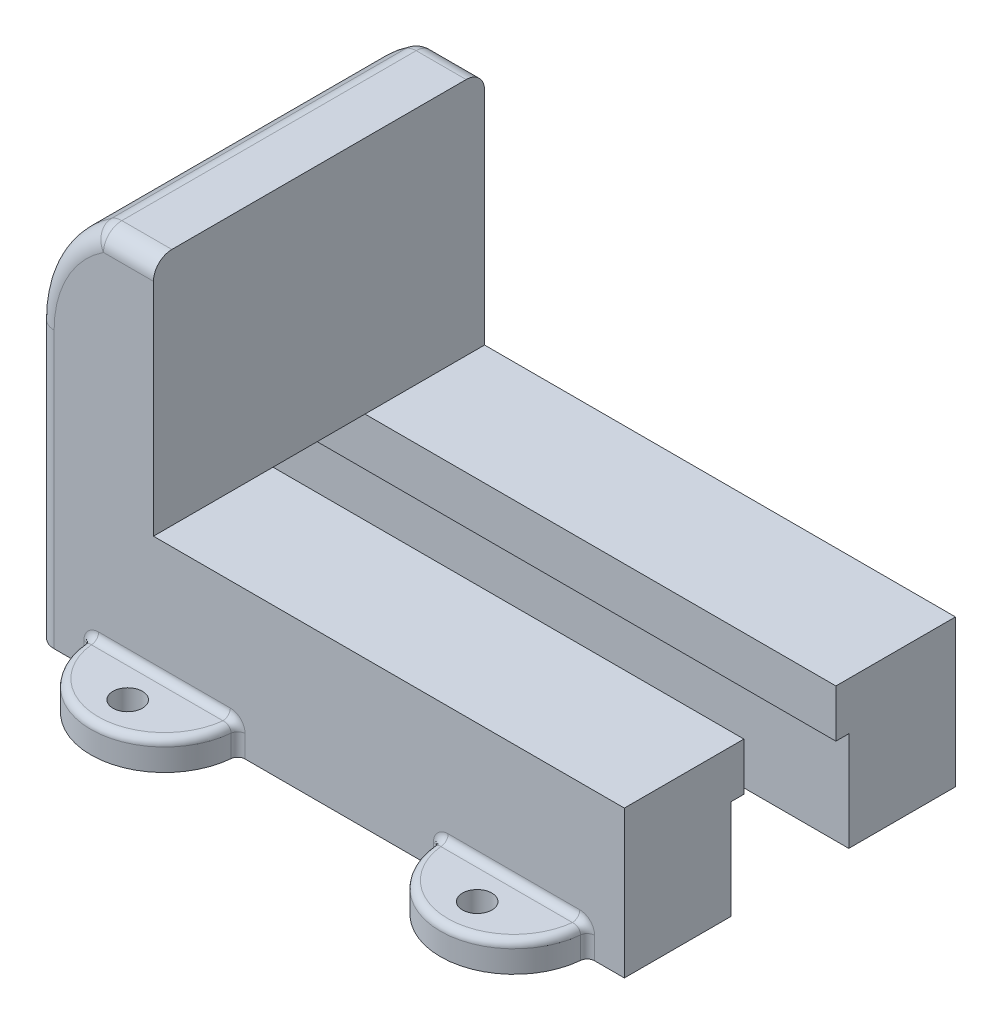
ISO-10303-21;
HEADER;
FILE_DESCRIPTION(('STEP AP214'),'2;1');
FILE_NAME('part.step','',(''),(''),'','','');
FILE_SCHEMA(('AUTOMOTIVE_DESIGN { 1 0 10303 214 1 1 1 1 }'));
ENDSEC;
DATA;
#1=APPLICATION_CONTEXT('core data for automotive mechanical design processes');
#2=APPLICATION_PROTOCOL_DEFINITION('international standard','automotive_design',2000,#1);
#3=PRODUCT_CONTEXT('',#1,'mechanical');
#4=PRODUCT('Part','Part','',(#3));
#5=PRODUCT_RELATED_PRODUCT_CATEGORY('part','',(#4));
#6=PRODUCT_DEFINITION_FORMATION('','',#4);
#7=PRODUCT_DEFINITION_CONTEXT('part definition',#1,'design');
#8=PRODUCT_DEFINITION('design','',#6,#7);
#9=PRODUCT_DEFINITION_SHAPE('','',#8);
#10=(LENGTH_UNIT() NAMED_UNIT(*) SI_UNIT(.MILLI.,.METRE.));
#11=(NAMED_UNIT(*) PLANE_ANGLE_UNIT() SI_UNIT($,.RADIAN.));
#12=(NAMED_UNIT(*) SI_UNIT($,.STERADIAN.) SOLID_ANGLE_UNIT());
#13=UNCERTAINTY_MEASURE_WITH_UNIT(LENGTH_MEASURE(1.E-05),#10,'distance_accuracy_value','');
#14=(GEOMETRIC_REPRESENTATION_CONTEXT(3) GLOBAL_UNCERTAINTY_ASSIGNED_CONTEXT((#13)) GLOBAL_UNIT_ASSIGNED_CONTEXT((#10,
#11,#12)) REPRESENTATION_CONTEXT('',''));
#15=CARTESIAN_POINT('',(0.,0.,0.));
#16=DIRECTION('',(0.,0.,1.));
#17=DIRECTION('',(1.,0.,0.));
#18=AXIS2_PLACEMENT_3D('',#15,#16,#17);
#19=CARTESIAN_POINT('',(0.,40.,-45.));
#20=DIRECTION('',(0.,0.,-1.));
#21=DIRECTION('',(-1.,0.,0.));
#22=AXIS2_PLACEMENT_3D('',#19,#20,#21);
#23=PLANE('',#22);
#24=DIRECTION('',(-1.,0.,0.));
#25=VECTOR('',#24,1.);
#26=CARTESIAN_POINT('',(0.,40.,-45.));
#27=LINE('',#26,#25);
#28=CARTESIAN_POINT('',(160.,40.,-45.));
#29=VERTEX_POINT('',#28);
#30=CARTESIAN_POINT('',(32.,40.,-45.));
#31=VERTEX_POINT('',#30);
#32=EDGE_CURVE('E1080',#29,#31,#27,.T.);
#33=ORIENTED_EDGE('',*,*,#32,.F.);
#34=DIRECTION('',(0.,-1.,0.));
#35=VECTOR('',#34,1.);
#36=CARTESIAN_POINT('',(160.,40.,-45.));
#37=LINE('',#36,#35);
#38=CARTESIAN_POINT('',(160.,0.,-45.));
#39=VERTEX_POINT('',#38);
#40=EDGE_CURVE('E51',#29,#39,#37,.T.);
#41=ORIENTED_EDGE('',*,*,#40,.T.);
#42=DIRECTION('',(1.,0.,0.));
#43=VECTOR('',#42,1.);
#44=CARTESIAN_POINT('',(0.,0.,-45.));
#45=LINE('',#44,#43);
#46=CARTESIAN_POINT('',(151.908902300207,0.,-45.));
#47=VERTEX_POINT('',#46);
#48=EDGE_CURVE('E455',#47,#39,#45,.T.);
#49=ORIENTED_EDGE('',*,*,#48,.F.);
#50=DIRECTION('',(0.,-1.,0.));
#51=VECTOR('',#50,1.);
#52=CARTESIAN_POINT('',(151.908902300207,40.,-45.));
#53=LINE('',#52,#51);
#54=CARTESIAN_POINT('',(151.908902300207,6.,-45.));
#55=VERTEX_POINT('',#54);
#56=EDGE_CURVE('E509',#47,#55,#53,.F.);
#57=ORIENTED_EDGE('',*,*,#56,.T.);
#58=CARTESIAN_POINT('',(147.208624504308,7.88580591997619,-47.0799311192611));
#59=CARTESIAN_POINT('',(147.236154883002,7.80730114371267,-45.));
#60=CARTESIAN_POINT('',(146.547302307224,9.77161183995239,-45.));
#61=CARTESIAN_POINT('',(147.263245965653,7.90466680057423,-47.0730110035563));
#62=CARTESIAN_POINT('',(147.285994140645,7.83241084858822,-45.));
#63=CARTESIAN_POINT('',(146.654872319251,9.80933360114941,-45.));
#64=CARTESIAN_POINT('',(147.318624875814,7.92124925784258,-47.0661256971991));
#65=CARTESIAN_POINT('',(147.337292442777,7.85549122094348,-45.));
#66=CARTESIAN_POINT('',(146.763982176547,9.84249851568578,-45.));
#67=CARTESIAN_POINT('',(147.430553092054,7.94976429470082,-47.0524682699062));
#68=CARTESIAN_POINT('',(147.442273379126,7.89717256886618,-45.));
#69=CARTESIAN_POINT('',(146.984601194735,9.89952858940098,-45.));
#70=CARTESIAN_POINT('',(147.487102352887,7.9616970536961,-47.0456961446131));
#71=CARTESIAN_POINT('',(147.495951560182,7.91579101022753,-45.));
#72=CARTESIAN_POINT('',(147.096110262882,9.92339410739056,-45.));
#73=CARTESIAN_POINT('',(147.657825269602,7.99035461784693,-47.0256340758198));
#74=CARTESIAN_POINT('',(147.659598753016,7.96436251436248,-45.));
#75=CARTESIAN_POINT('',(147.432892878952,9.98070923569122,-45.));
#76=CARTESIAN_POINT('',(147.773239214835,7.99999556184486,-47.0125775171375));
#77=CARTESIAN_POINT('',(147.772879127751,7.98737930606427,-45.));
#78=CARTESIAN_POINT('',(147.660747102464,9.99999112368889,-45.));
#79=CARTESIAN_POINT('',(148.003482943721,8.0000044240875,-46.9874623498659));
#80=CARTESIAN_POINT('',(148.003120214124,8.01250194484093,-45.));
#81=CARTESIAN_POINT('',(148.115618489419,10.0000088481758,-45.));
#82=CARTESIAN_POINT('',(148.118313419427,7.99043333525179,-46.97540070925));
#83=CARTESIAN_POINT('',(148.120102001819,8.01480970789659,-45.));
#84=CARTESIAN_POINT('',(148.342636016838,9.98086667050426,-45.));
#85=CARTESIAN_POINT('',(148.344586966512,7.95239966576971,-46.9524293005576));
#86=CARTESIAN_POINT('',(148.354012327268,7.99794863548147,-45.));
#87=CARTESIAN_POINT('',(148.790234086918,9.90479933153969,-45.));
#88=CARTESIAN_POINT('',(148.456030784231,7.92394127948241,-46.9415192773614));
#89=CARTESIAN_POINT('',(148.471012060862,7.97889989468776,-45.));
#90=CARTESIAN_POINT('',(149.010816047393,9.84788255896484,-45.));
#91=CARTESIAN_POINT('',(148.672422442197,7.84888675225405,-46.9209842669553));
#92=CARTESIAN_POINT('',(148.700793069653,7.91945352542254,-45.));
#93=CARTESIAN_POINT('',(149.43932676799,9.69777350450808,-45.));
#94=CARTESIAN_POINT('',(148.777368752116,7.80228635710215,-46.9113595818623));
#95=CARTESIAN_POINT('',(148.813669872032,7.87913681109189,-45.));
#96=CARTESIAN_POINT('',(149.647252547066,9.60457271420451,-45.));
#97=CARTESIAN_POINT('',(148.977771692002,7.69222670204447,-46.8934795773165));
#98=CARTESIAN_POINT('',(149.031097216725,7.7781578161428,-45.));
#99=CARTESIAN_POINT('',(150.044454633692,9.38445340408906,-45.));
#100=CARTESIAN_POINT('',(149.07322736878,7.62876575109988,-46.8852243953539));
#101=CARTESIAN_POINT('',(149.135756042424,7.71754561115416,-45.));
#102=CARTESIAN_POINT('',(150.233729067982,9.25753150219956,-45.));
#103=CARTESIAN_POINT('',(149.251573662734,7.48702694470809,-46.8701578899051));
#104=CARTESIAN_POINT('',(149.332563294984,7.57805806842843,-45.));
#105=CARTESIAN_POINT('',(150.58746900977,8.97405388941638,-45.));
#106=CARTESIAN_POINT('',(149.334508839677,7.40880397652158,-46.8633414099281));
#107=CARTESIAN_POINT('',(149.424864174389,7.49926874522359,-45.));
#108=CARTESIAN_POINT('',(150.752022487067,8.81760795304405,-45.));
#109=CARTESIAN_POINT('',(149.485865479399,7.23957935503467,-46.8511339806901));
#110=CARTESIAN_POINT('',(149.594082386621,7.32581112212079,-45.));
#111=CARTESIAN_POINT('',(151.05239965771,8.47915871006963,-45.));
#112=CARTESIAN_POINT('',(149.554284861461,7.14857587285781,-46.845743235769));
#113=CARTESIAN_POINT('',(149.671098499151,7.23112696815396,-45.));
#114=CARTESIAN_POINT('',(151.188219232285,8.29715174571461,-45.));
#115=CARTESIAN_POINT('',(149.674349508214,6.95683289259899,-46.8364159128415));
#116=CARTESIAN_POINT('',(149.806649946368,7.02948096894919,-45.));
#117=CARTESIAN_POINT('',(151.426597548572,7.913665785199,-45.));
#118=CARTESIAN_POINT('',(149.726067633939,6.85613824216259,-46.8324730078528));
#119=CARTESIAN_POINT('',(149.865348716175,6.92253653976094,-45.));
#120=CARTESIAN_POINT('',(151.529300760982,7.71227648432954,-45.));
#121=CARTESIAN_POINT('',(149.811616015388,6.64759863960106,-46.8260098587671));
#122=CARTESIAN_POINT('',(149.962593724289,6.69965482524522,-45.));
#123=CARTESIAN_POINT('',(151.699201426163,7.29519727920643,-45.));
#124=CARTESIAN_POINT('',(149.84546485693,6.53976124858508,-46.8234881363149));
#125=CARTESIAN_POINT('',(150.001222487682,6.58366775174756,-45.));
#126=CARTESIAN_POINT('',(151.766435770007,7.07952249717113,-45.));
#127=CARTESIAN_POINT('',(149.885613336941,6.35939496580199,-46.8205096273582));
#128=CARTESIAN_POINT('',(150.047063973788,6.38904837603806,-45.));
#129=CARTESIAN_POINT('',(151.846186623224,6.71878993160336,-45.));
#130=CARTESIAN_POINT('',(149.89743627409,6.28803248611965,-46.8196368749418));
#131=CARTESIAN_POINT('',(150.060579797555,6.31188714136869,-45.));
#132=CARTESIAN_POINT('',(151.869672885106,6.57606497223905,-45.));
#133=CARTESIAN_POINT('',(149.913224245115,6.14446230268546,-46.818472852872));
#134=CARTESIAN_POINT('',(150.078629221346,6.15651090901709,-45.));
#135=CARTESIAN_POINT('',(151.901036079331,6.28892460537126,-45.));
#136=CARTESIAN_POINT('',(149.91718925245,6.07225459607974,-46.8181815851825));
#137=CARTESIAN_POINT('',(150.083167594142,6.07827547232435,-45.));
#138=CARTESIAN_POINT('',(151.908912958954,6.14450919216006,-45.));
#139=CARTESIAN_POINT('',(149.917175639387,5.88816797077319,-46.8181821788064));
#140=CARTESIAN_POINT('',(150.083149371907,5.87884914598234,-45.));
#141=CARTESIAN_POINT('',(151.908885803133,5.77633594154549,-45.));
#142=CARTESIAN_POINT('',(149.907656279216,5.77622361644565,-46.8188808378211));
#143=CARTESIAN_POINT('',(150.072248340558,5.75753855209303,-45.));
#144=CARTESIAN_POINT('',(151.889974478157,5.55244723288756,-45.));
#145=CARTESIAN_POINT('',(149.87930925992,5.61061731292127,-46.8209773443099));
#146=CARTESIAN_POINT('',(150.039870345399,5.5786005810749,-45.));
#147=CARTESIAN_POINT('',(151.833664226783,5.22123462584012,-45.));
#148=CARTESIAN_POINT('',(149.867470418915,5.55567199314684,-46.821854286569));
#149=CARTESIAN_POINT('',(150.026347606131,5.51929320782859,-45.));
#150=CARTESIAN_POINT('',(151.810147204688,5.11134398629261,-45.));
#151=CARTESIAN_POINT('',(149.839162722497,5.44694854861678,-46.8239608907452));
#152=CARTESIAN_POINT('',(149.994054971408,5.40216862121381,-45.));
#153=CARTESIAN_POINT('',(151.753918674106,4.89389709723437,-45.));
#154=CARTESIAN_POINT('',(149.822692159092,5.39317086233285,-46.8251906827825));
#155=CARTESIAN_POINT('',(149.975277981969,5.34434319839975,-45.));
#156=CARTESIAN_POINT('',(151.721203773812,4.78634172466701,-45.));
#157=CARTESIAN_POINT('',(149.803954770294,5.34014775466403,-46.8265970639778));
#158=CARTESIAN_POINT('',(149.95395150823,5.28750205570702,-45.));
#159=CARTESIAN_POINT('',(151.683988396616,4.68029550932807,-45.));
#160=(BOUNDED_SURFACE() B_SPLINE_SURFACE(3,2,((#58,#59,#60),(#61,#62,#63),(#64,#65,#66),(#67,
#68,#69),(#70,#71,#72),(#73,#74,#75),(#76,#77,#78),(#79,#80,#81),(#82,#83,#84),(#85,#86,#87),
(#88,#89,#90),(#91,#92,#93),(#94,#95,#96),(#97,#98,#99),(#100,#101,#102),(#103,#104,#105),(#106,
#107,#108),(#109,#110,#111),(#112,#113,#114),(#115,#116,#117),(#118,#119,#120),(#121,#122,#123),
(#124,#125,#126),(#127,#128,#129),(#130,#131,#132),(#133,#134,#135),(#136,#137,#138),(#139,#140,
#141),(#142,#143,#144),(#145,#146,#147),(#148,#149,#150),(#151,#152,#153),(#154,#155,#156),
(#157,#158,#159)),.UNSPECIFIED.,.F.,.F.,.F.) B_SPLINE_SURFACE_WITH_KNOTS((4,2,2,2,2,2,2,2,2,2,2,
2,2,2,2,2,4),(3,3),(0.,0.341766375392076,0.683519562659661,1.36600537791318,2.046327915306,
2.72649942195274,3.40683052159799,4.08722988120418,4.76514755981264,5.4431623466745,
6.11817795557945,6.79249009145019,7.22562423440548,7.65875984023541,8.32914534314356,
8.66594844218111,9.00287590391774),(0.,1.),
.UNSPECIFIED.) GEOMETRIC_REPRESENTATION_ITEM() RATIONAL_B_SPLINE_SURFACE(((1.,0.692832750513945,
1.),(1.,0.69408128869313,1.),(1.,0.695320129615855,1.),(1.,0.697771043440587,1.),(1.,
0.698983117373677,1.),(1.,0.702564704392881,1.),(1.,0.704883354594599,1.),(1.,0.709323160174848,
1.),(1.,0.711444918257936,1.),(1.,0.71546958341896,1.),(1.,0.717372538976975,1.),(1.,
0.72094183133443,1.),(1.,0.722608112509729,1.),(1.,0.725694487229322,1.),(1.,0.727114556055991,
1.),(1.,0.729700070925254,1.),(1.,0.73086642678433,1.),(1.,0.732951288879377,1.),(1.,
0.733869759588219,1.),(1.,0.735456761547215,1.),(1.,0.73612638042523,1.),(1.,0.737223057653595,
1.),(1.,0.737650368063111,1.),(1.,0.738154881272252,1.),(1.,0.738302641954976,1.),(1.,
0.738499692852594,1.),(1.,0.73854898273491,1.),(1.,0.738548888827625,1.),(1.,0.73843066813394,
1.),(1.,0.738075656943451,1.),(1.,0.737927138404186,1.),(1.,0.737570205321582,1.),(1.,
0.737361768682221,1.),(1.,0.737123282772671,1.))) REPRESENTATION_ITEM('') SURFACE());
#161=CARTESIAN_POINT('',(151.683988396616,4.68029550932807,-45.));
#162=CARTESIAN_POINT('',(151.721203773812,4.78634172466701,-45.));
#163=CARTESIAN_POINT('',(151.753918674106,4.89389709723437,-45.));
#164=CARTESIAN_POINT('',(151.810147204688,5.11134398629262,-45.));
#165=CARTESIAN_POINT('',(151.833664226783,5.22123462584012,-45.));
#166=CARTESIAN_POINT('',(151.889974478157,5.55244723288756,-45.));
#167=CARTESIAN_POINT('',(151.908885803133,5.77633594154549,-45.));
#168=CARTESIAN_POINT('',(151.908912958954,6.14450919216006,-45.));
#169=CARTESIAN_POINT('',(151.901036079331,6.28892460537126,-45.));
#170=CARTESIAN_POINT('',(151.869672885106,6.57606497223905,-45.));
#171=CARTESIAN_POINT('',(151.846186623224,6.71878993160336,-45.));
#172=CARTESIAN_POINT('',(151.766435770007,7.07952249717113,-45.));
#173=CARTESIAN_POINT('',(151.699201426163,7.29519727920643,-45.));
#174=CARTESIAN_POINT('',(151.529300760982,7.71227648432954,-45.));
#175=CARTESIAN_POINT('',(151.426597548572,7.913665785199,-45.));
#176=CARTESIAN_POINT('',(151.188219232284,8.29715174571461,-45.));
#177=CARTESIAN_POINT('',(151.05239965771,8.47915871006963,-45.));
#178=CARTESIAN_POINT('',(150.752022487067,8.81760795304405,-45.));
#179=CARTESIAN_POINT('',(150.58746900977,8.97405388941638,-45.));
#180=CARTESIAN_POINT('',(150.233729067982,9.25753150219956,-45.));
#181=CARTESIAN_POINT('',(150.044454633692,9.38445340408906,-45.));
#182=CARTESIAN_POINT('',(149.647252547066,9.60457271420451,-45.));
#183=CARTESIAN_POINT('',(149.43932676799,9.69777350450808,-45.));
#184=CARTESIAN_POINT('',(149.010816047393,9.84788255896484,-45.));
#185=CARTESIAN_POINT('',(148.790234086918,9.90479933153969,-45.));
#186=CARTESIAN_POINT('',(148.342636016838,9.98086667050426,-45.));
#187=CARTESIAN_POINT('',(148.115618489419,10.0000088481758,-45.));
#188=CARTESIAN_POINT('',(147.660747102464,9.99999112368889,-45.));
#189=CARTESIAN_POINT('',(147.432892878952,9.98070923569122,-45.));
#190=CARTESIAN_POINT('',(147.096110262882,9.92339410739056,-45.));
#191=CARTESIAN_POINT('',(146.984601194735,9.89952858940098,-45.));
#192=CARTESIAN_POINT('',(146.763982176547,9.84249851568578,-45.));
#193=CARTESIAN_POINT('',(146.654872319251,9.80933360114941,-45.));
#194=CARTESIAN_POINT('',(146.547302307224,9.77161183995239,-45.));
#195=B_SPLINE_CURVE_WITH_KNOTS('',3,(#161,#162,#163,#164,#165,#166,#167,#168,#169,#170,#171,
#172,#173,#174,#175,#176,#177,#178,#179,#180,#181,#182,#183,#184,#185,#186,#187,#188,#189,#190,
#191,#192,#193,#194),.UNSPECIFIED.,.F.,.F.,(4,2,2,2,2,2,2,2,2,2,2,2,2,2,2,2,4),(0.,
0.336927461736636,0.67373056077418,1.34411606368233,1.77725166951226,2.21038581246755,
2.88469794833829,3.55971355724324,4.2377283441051,4.91564602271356,5.59604538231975,
6.276376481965,6.95654798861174,7.63687052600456,8.31935634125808,8.66110952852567,
9.00287590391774),.UNSPECIFIED.);
#196=CARTESIAN_POINT('',(147.888543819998,10.,-45.));
#197=VERTEX_POINT('',#196);
#198=EDGE_CURVE('E501',#55,#197,#195,.T.);
#199=ORIENTED_EDGE('',*,*,#198,.T.);
#200=DIRECTION('',(1.,0.,0.));
#201=VECTOR('',#200,1.);
#202=CARTESIAN_POINT('',(112.,10.,-45.));
#203=LINE('',#202,#201);
#204=CARTESIAN_POINT('',(112.111456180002,10.,-45.));
#205=VERTEX_POINT('',#204);
#206=EDGE_CURVE('E499',#197,#205,#203,.F.);
#207=ORIENTED_EDGE('',*,*,#206,.T.);
#208=CARTESIAN_POINT('',(110.196045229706,5.34014775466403,-46.8265970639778));
#209=CARTESIAN_POINT('',(110.04604849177,5.28750205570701,-45.));
#210=CARTESIAN_POINT('',(108.316011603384,4.68029550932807,-45.));
#211=CARTESIAN_POINT('',(110.177341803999,5.39306908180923,-46.8251932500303));
#212=CARTESIAN_POINT('',(110.02476054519,5.34423408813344,-45.));
#213=CARTESIAN_POINT('',(108.278863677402,4.78613816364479,-45.));
#214=CARTESIAN_POINT('',(110.160897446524,5.44674915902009,-46.8239653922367));
#215=CARTESIAN_POINT('',(110.006013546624,5.40195427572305,-45.));
#216=CARTESIAN_POINT('',(108.246200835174,4.89349831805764,-45.));
#217=CARTESIAN_POINT('',(110.132620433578,5.55529146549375,-46.8218610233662));
#218=CARTESIAN_POINT('',(109.973756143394,5.5188829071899,-45.));
#219=CARTESIAN_POINT('',(108.19003326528,5.11058293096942,-45.));
#220=CARTESIAN_POINT('',(110.120787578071,5.6101536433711,-46.8209844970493));
#221=CARTESIAN_POINT('',(109.960240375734,5.57810001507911,-45.));
#222=CARTESIAN_POINT('',(108.166528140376,5.22030728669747,-45.));
#223=CARTESIAN_POINT('',(110.092375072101,5.77583881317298,-46.8188831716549));
#224=CARTESIAN_POINT('',(109.927787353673,5.75712153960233,-45.));
#225=CARTESIAN_POINT('',(108.110087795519,5.55167762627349,-45.));
#226=CARTESIAN_POINT('',(110.082820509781,5.88793349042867,-46.8181820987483));
#227=CARTESIAN_POINT('',(109.916844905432,5.87859530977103,-45.));
#228=CARTESIAN_POINT('',(108.091106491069,5.77586698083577,-45.));
#229=CARTESIAN_POINT('',(110.082811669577,6.11211936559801,-46.818181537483));
#230=CARTESIAN_POINT('',(109.916834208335,6.12146193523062,-45.));
#231=CARTESIAN_POINT('',(108.091088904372,6.22423873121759,-45.));
#232=CARTESIAN_POINT('',(110.092366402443,6.22421053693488,-46.818882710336));
#233=CARTESIAN_POINT('',(109.927776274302,6.24293279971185,-45.));
#234=CARTESIAN_POINT('',(108.110070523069,6.44842107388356,-45.));
#235=CARTESIAN_POINT('',(110.130296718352,6.44519805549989,-46.8216875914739));
#236=CARTESIAN_POINT('',(109.971109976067,6.48174454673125,-45.));
#237=CARTESIAN_POINT('',(108.185417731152,6.8903961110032,-45.));
#238=CARTESIAN_POINT('',(110.158668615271,6.55409502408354,-46.8237910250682));
#239=CARTESIAN_POINT('',(110.003525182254,6.59916053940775,-45.));
#240=CARTESIAN_POINT('',(108.241775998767,7.10819004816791,-45.));
#241=CARTESIAN_POINT('',(110.233420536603,6.76560576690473,-46.8294030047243));
#242=CARTESIAN_POINT('',(110.088625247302,6.82597779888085,-45.));
#243=CARTESIAN_POINT('',(108.390244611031,7.53121153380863,-45.));
#244=CARTESIAN_POINT('',(110.279799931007,6.86821976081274,-46.8329115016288));
#245=CARTESIAN_POINT('',(110.141363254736,6.93544268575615,-45.));
#246=CARTESIAN_POINT('',(108.482353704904,7.73643952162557,-45.));
#247=CARTESIAN_POINT('',(110.389248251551,7.06428895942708,-46.8413357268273));
#248=CARTESIAN_POINT('',(110.265214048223,7.142796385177,-45.));
#249=CARTESIAN_POINT('',(108.699676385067,8.12857791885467,-45.));
#250=CARTESIAN_POINT('',(110.452319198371,7.15774305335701,-46.8462516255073));
#251=CARTESIAN_POINT('',(110.336405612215,7.24072931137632,-45.));
#252=CARTESIAN_POINT('',(108.824893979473,8.31548610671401,-45.));
#253=CARTESIAN_POINT('',(110.593461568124,7.33298714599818,-46.8574953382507));
#254=CARTESIAN_POINT('',(110.494725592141,7.42198922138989,-45.));
#255=CARTESIAN_POINT('',(109.105040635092,8.66597429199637,-45.));
#256=CARTESIAN_POINT('',(110.671555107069,7.41475963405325,-46.8638252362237));
#257=CARTESIAN_POINT('',(110.581971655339,7.50531564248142,-45.));
#258=CARTESIAN_POINT('',(109.260013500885,8.82951926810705,-45.));
#259=CARTESIAN_POINT('',(110.840488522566,7.56420988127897,-46.8778791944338));
#260=CARTESIAN_POINT('',(110.769222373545,7.65459566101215,-45.));
#261=CARTESIAN_POINT('',(109.595147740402,9.12841976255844,-45.));
#262=CARTESIAN_POINT('',(110.931330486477,7.63188532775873,-46.8856034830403));
#263=CARTESIAN_POINT('',(110.869334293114,7.72053900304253,-45.));
#264=CARTESIAN_POINT('',(109.775313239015,9.26377065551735,-45.));
#265=CARTESIAN_POINT('',(111.123610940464,7.75152308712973,-46.9024460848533));
#266=CARTESIAN_POINT('',(111.079188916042,7.83335216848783,-45.));
#267=CARTESIAN_POINT('',(110.156511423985,9.50304617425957,-45.));
#268=CARTESIAN_POINT('',(111.225094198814,7.80341511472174,-46.9115703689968));
#269=CARTESIAN_POINT('',(111.189078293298,7.88009589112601,-45.));
#270=CARTESIAN_POINT('',(110.357632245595,9.60683022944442,-45.));
#271=CARTESIAN_POINT('',(111.435422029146,7.88962916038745,-46.9311161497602));
#272=CARTESIAN_POINT('',(111.414123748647,7.95286490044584,-45.));
#273=CARTESIAN_POINT('',(110.774264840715,9.77925832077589,-45.));
#274=CARTESIAN_POINT('',(111.544259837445,7.92396707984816,-46.9415364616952));
#275=CARTESIAN_POINT('',(111.529375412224,7.97883569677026,-45.));
#276=CARTESIAN_POINT('',(110.989763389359,9.84793415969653,-45.));
#277=CARTESIAN_POINT('',(111.729931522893,7.96600045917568,-46.9599530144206));
#278=CARTESIAN_POINT('',(111.723010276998,8.00469942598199,-45.));
#279=CARTESIAN_POINT('',(111.357186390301,9.93200091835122,-45.));
#280=CARTESIAN_POINT('',(111.805605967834,7.97873486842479,-46.9676291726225));
#281=CARTESIAN_POINT('',(111.801282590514,8.01031605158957,-45.));
#282=CARTESIAN_POINT('',(111.506882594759,9.95746973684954,-45.));
#283=CARTESIAN_POINT('',(111.957977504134,7.99573747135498,-46.9834648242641));
#284=CARTESIAN_POINT('',(111.957188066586,8.01216683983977,-45.));
#285=CARTESIAN_POINT('',(111.808172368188,9.99147494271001,-45.));
#286=CARTESIAN_POINT('',(112.03467462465,8.0000054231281,-46.9916243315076));
#287=CARTESIAN_POINT('',(112.034839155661,8.00836413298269,-45.));
#288=CARTESIAN_POINT('',(111.959765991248,10.0000108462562,-45.));
#289=CARTESIAN_POINT('',(112.226532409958,7.99999187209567,-47.0125530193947));
#290=CARTESIAN_POINT('',(112.226888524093,7.9873984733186,-45.));
#291=CARTESIAN_POINT('',(112.338801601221,9.99998374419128,-45.));
#292=CARTESIAN_POINT('',(112.341798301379,7.99038469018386,-47.0255915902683));
#293=CARTESIAN_POINT('',(112.340029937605,7.96443600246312,-45.));
#294=CARTESIAN_POINT('',(112.566363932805,9.98076938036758,-45.));
#295=CARTESIAN_POINT('',(112.512459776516,7.96178712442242,-47.0456438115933));
#296=CARTESIAN_POINT('',(112.503632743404,7.91593287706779,-45.));
#297=CARTESIAN_POINT('',(112.903026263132,9.92357424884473,-45.));
#298=CARTESIAN_POINT('',(112.569106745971,7.94984447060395,-47.0524270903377));
#299=CARTESIAN_POINT('',(112.557406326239,7.89729283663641,-45.));
#300=CARTESIAN_POINT('',(113.014728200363,9.89968894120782,-45.));
#301=CARTESIAN_POINT('',(112.681211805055,7.92129730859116,-47.0661054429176));
#302=CARTESIAN_POINT('',(112.662556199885,7.85555819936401,-45.));
#303=CARTESIAN_POINT('',(113.235696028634,9.8425946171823,-45.));
#304=CARTESIAN_POINT('',(112.736670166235,7.90469387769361,-47.073000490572));
#305=CARTESIAN_POINT('',(112.713928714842,7.83244723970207,-45.));
#306=CARTESIAN_POINT('',(113.344962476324,9.80938775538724,-45.));
#307=CARTESIAN_POINT('',(112.791375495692,7.88580591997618,-47.0799311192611));
#308=CARTESIAN_POINT('',(112.763845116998,7.80730114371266,-45.));
#309=CARTESIAN_POINT('',(113.452697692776,9.77161183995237,-45.));
#310=(BOUNDED_SURFACE() B_SPLINE_SURFACE(3,2,((#208,#209,#210),(#211,#212,#213),(#214,#215,
#216),(#217,#218,#219),(#220,#221,#222),(#223,#224,#225),(#226,#227,#228),(#229,#230,#231),
(#232,#233,#234),(#235,#236,#237),(#238,#239,#240),(#241,#242,#243),(#244,#245,#246),(#247,#248,
#249),(#250,#251,#252),(#253,#254,#255),(#256,#257,#258),(#259,#260,#261),(#262,#263,#264),
(#265,#266,#267),(#268,#269,#270),(#271,#272,#273),(#274,#275,#276),(#277,#278,#279),(#280,#281,
#282),(#283,#284,#285),(#286,#287,#288),(#289,#290,#291),(#292,#293,#294),(#295,#296,#297),
(#298,#299,#300),(#301,#302,#303),(#304,#305,#306),(#307,#308,#309)),.UNSPECIFIED.,.F.,.F.,
.F.) B_SPLINE_SURFACE_WITH_KNOTS((4,2,2,2,2,2,2,2,2,2,2,2,2,2,2,2,4),(3,3),(0.,0.33631071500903,
0.672606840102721,1.34411307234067,2.0159360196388,2.68762740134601,3.35929528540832,
4.03104451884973,4.70379036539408,5.37664649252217,6.05245647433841,6.72765318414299,
7.18228829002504,7.63693638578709,8.31833947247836,8.66068159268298,9.00294464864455),(0.,1.),
.UNSPECIFIED.) GEOMETRIC_REPRESENTATION_ITEM() RATIONAL_B_SPLINE_SURFACE(((1.,0.737123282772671,
1.),(1.,0.737361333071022,1.),(1.,0.737569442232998,1.),(1.,0.737925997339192,1.),(1.,
0.738074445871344,1.),(1.,0.738430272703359,1.),(1.,0.73854889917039,1.),(1.,0.738548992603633,
1.),(1.,0.73843034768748,1.),(1.,0.737955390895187,1.),(1.,0.737599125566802,1.),(1.,
0.736647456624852,1.),(1.,0.736052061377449,1.),(1.,0.734620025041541,1.),(1.,0.733783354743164,
1.),(1.,0.731865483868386,1.),(1.,0.730783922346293,1.),(1.,0.728376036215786,1.),(1.,
0.727049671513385,1.),(1.,0.724148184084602,1.),(1.,0.722571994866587,1.),(1.,0.719182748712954,
1.),(1.,0.717369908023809,1.),(1.,0.714152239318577,1.),(1.,0.712807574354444,1.),(1.,
0.710025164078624,1.),(1.,0.708587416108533,1.),(1.,0.704887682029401,1.),(1.,0.702572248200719,
1.),(1.,0.698992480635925,1.),(1.,0.697778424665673,1.),(1.,0.695323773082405,1.),(1.,
0.694083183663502,1.),(1.,0.692832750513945,1.))) REPRESENTATION_ITEM('') SURFACE());
#311=CARTESIAN_POINT('',(113.452697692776,9.77161183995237,-45.));
#312=CARTESIAN_POINT('',(113.344962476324,9.80938775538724,-45.));
#313=CARTESIAN_POINT('',(113.235696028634,9.84259461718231,-45.));
#314=CARTESIAN_POINT('',(113.014728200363,9.89968894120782,-45.));
#315=CARTESIAN_POINT('',(112.903026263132,9.92357424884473,-45.));
#316=CARTESIAN_POINT('',(112.566363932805,9.98076938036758,-45.));
#317=CARTESIAN_POINT('',(112.338801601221,9.99998374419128,-45.));
#318=CARTESIAN_POINT('',(111.959765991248,10.0000108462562,-45.));
#319=CARTESIAN_POINT('',(111.808172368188,9.99147494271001,-45.));
#320=CARTESIAN_POINT('',(111.506882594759,9.95746973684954,-45.));
#321=CARTESIAN_POINT('',(111.357186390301,9.93200091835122,-45.));
#322=CARTESIAN_POINT('',(110.989763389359,9.84793415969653,-45.));
#323=CARTESIAN_POINT('',(110.774264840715,9.77925832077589,-45.));
#324=CARTESIAN_POINT('',(110.357632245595,9.60683022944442,-45.));
#325=CARTESIAN_POINT('',(110.156511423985,9.50304617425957,-45.));
#326=CARTESIAN_POINT('',(109.775313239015,9.26377065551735,-45.));
#327=CARTESIAN_POINT('',(109.595147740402,9.12841976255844,-45.));
#328=CARTESIAN_POINT('',(109.260013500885,8.82951926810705,-45.));
#329=CARTESIAN_POINT('',(109.105040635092,8.66597429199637,-45.));
#330=CARTESIAN_POINT('',(108.824893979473,8.31548610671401,-45.));
#331=CARTESIAN_POINT('',(108.699676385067,8.12857791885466,-45.));
#332=CARTESIAN_POINT('',(108.482353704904,7.73643952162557,-45.));
#333=CARTESIAN_POINT('',(108.390244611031,7.53121153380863,-45.));
#334=CARTESIAN_POINT('',(108.241775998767,7.10819004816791,-45.));
#335=CARTESIAN_POINT('',(108.185417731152,6.8903961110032,-45.));
#336=CARTESIAN_POINT('',(108.110070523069,6.44842107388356,-45.));
#337=CARTESIAN_POINT('',(108.091088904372,6.22423873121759,-45.));
#338=CARTESIAN_POINT('',(108.091106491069,5.77586698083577,-45.));
#339=CARTESIAN_POINT('',(108.110087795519,5.55167762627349,-45.));
#340=CARTESIAN_POINT('',(108.166528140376,5.22030728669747,-45.));
#341=CARTESIAN_POINT('',(108.19003326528,5.11058293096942,-45.));
#342=CARTESIAN_POINT('',(108.246200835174,4.89349831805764,-45.));
#343=CARTESIAN_POINT('',(108.278863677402,4.78613816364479,-45.));
#344=CARTESIAN_POINT('',(108.316011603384,4.68029550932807,-45.));
#345=B_SPLINE_CURVE_WITH_KNOTS('',3,(#311,#312,#313,#314,#315,#316,#317,#318,#319,#320,#321,
#322,#323,#324,#325,#326,#327,#328,#329,#330,#331,#332,#333,#334,#335,#336,#337,#338,#339,#340,
#341,#342,#343,#344),.UNSPECIFIED.,.F.,.F.,(4,2,2,2,2,2,2,2,2,2,2,2,2,2,2,2,4),(0.,
0.342263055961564,0.684605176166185,1.36600826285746,1.8206563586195,2.27529146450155,
2.95048817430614,3.62629815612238,4.29915428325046,4.97190012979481,5.64364936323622,
6.31531724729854,6.98700862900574,7.65883157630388,8.33033780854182,8.66663393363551,
9.00294464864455),.UNSPECIFIED.);
#346=CARTESIAN_POINT('',(108.091097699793,6.,-45.));
#347=VERTEX_POINT('',#346);
#348=EDGE_CURVE('E557',#205,#347,#345,.T.);
#349=ORIENTED_EDGE('',*,*,#348,.T.);
#350=DIRECTION('',(0.,-1.,0.));
#351=VECTOR('',#350,1.);
#352=CARTESIAN_POINT('',(108.091097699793,40.,-45.));
#353=LINE('',#352,#351);
#354=CARTESIAN_POINT('',(108.091097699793,0.,-45.));
#355=VERTEX_POINT('',#354);
#356=EDGE_CURVE('E1458',#347,#355,#353,.T.);
#357=ORIENTED_EDGE('',*,*,#356,.T.);
#358=CARTESIAN_POINT('',(56.9089023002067,0.,-45.));
#359=VERTEX_POINT('',#358);
#360=EDGE_CURVE('E1087',#359,#355,#45,.T.);
#361=ORIENTED_EDGE('',*,*,#360,.F.);
#362=DIRECTION('',(0.,-1.,0.));
#363=VECTOR('',#362,1.);
#364=CARTESIAN_POINT('',(56.9089023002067,40.,-45.));
#365=LINE('',#364,#363);
#366=CARTESIAN_POINT('',(56.9089023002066,6.,-45.));
#367=VERTEX_POINT('',#366);
#368=EDGE_CURVE('E572',#359,#367,#365,.F.);
#369=ORIENTED_EDGE('',*,*,#368,.T.);
#370=CARTESIAN_POINT('',(52.2086245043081,7.88580591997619,-47.0799311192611));
#371=CARTESIAN_POINT('',(52.236154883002,7.80730114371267,-45.));
#372=CARTESIAN_POINT('',(51.5473023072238,9.77161183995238,-45.));
#373=CARTESIAN_POINT('',(52.2632459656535,7.90466680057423,-47.0730110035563));
#374=CARTESIAN_POINT('',(52.2859941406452,7.83241084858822,-45.));
#375=CARTESIAN_POINT('',(51.6548723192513,9.8093336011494,-45.));
#376=CARTESIAN_POINT('',(52.3186248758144,7.92124925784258,-47.0661256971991));
#377=CARTESIAN_POINT('',(52.3372924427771,7.85549122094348,-45.));
#378=CARTESIAN_POINT('',(51.7639821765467,9.84249851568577,-45.));
#379=CARTESIAN_POINT('',(52.430553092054,7.94976429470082,-47.0524682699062));
#380=CARTESIAN_POINT('',(52.4422733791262,7.89717256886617,-45.));
#381=CARTESIAN_POINT('',(51.9846011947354,9.89952858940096,-45.));
#382=CARTESIAN_POINT('',(52.4871023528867,7.96169705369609,-47.0456961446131));
#383=CARTESIAN_POINT('',(52.4959515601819,7.91579101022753,-45.));
#384=CARTESIAN_POINT('',(52.0961102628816,9.92339410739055,-45.));
#385=CARTESIAN_POINT('',(52.6578252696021,7.99035461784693,-47.0256340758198));
#386=CARTESIAN_POINT('',(52.6595987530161,7.96436251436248,-45.));
#387=CARTESIAN_POINT('',(52.432892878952,9.98070923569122,-45.));
#388=CARTESIAN_POINT('',(52.7732392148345,7.99999556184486,-47.0125775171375));
#389=CARTESIAN_POINT('',(52.7728791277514,7.98737930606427,-45.));
#390=CARTESIAN_POINT('',(52.6607471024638,9.9999911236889,-45.));
#391=CARTESIAN_POINT('',(53.0034829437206,8.0000044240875,-46.9874623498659));
#392=CARTESIAN_POINT('',(53.0031202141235,8.01250194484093,-45.));
#393=CARTESIAN_POINT('',(53.1156184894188,10.0000088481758,-45.));
#394=CARTESIAN_POINT('',(53.1183134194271,7.99043333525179,-46.97540070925));
#395=CARTESIAN_POINT('',(53.1201020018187,8.01480970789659,-45.));
#396=CARTESIAN_POINT('',(53.3426360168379,9.98086667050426,-45.));
#397=CARTESIAN_POINT('',(53.3445869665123,7.95239966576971,-46.9524293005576));
#398=CARTESIAN_POINT('',(53.3540123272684,7.99794863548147,-45.));
#399=CARTESIAN_POINT('',(53.7902340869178,9.9047993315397,-45.));
#400=CARTESIAN_POINT('',(53.4560307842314,7.92394127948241,-46.9415192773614));
#401=CARTESIAN_POINT('',(53.4710120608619,7.97889989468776,-45.));
#402=CARTESIAN_POINT('',(54.0108160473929,9.84788255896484,-45.));
#403=CARTESIAN_POINT('',(53.6724224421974,7.84888675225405,-46.9209842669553));
#404=CARTESIAN_POINT('',(53.700793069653,7.91945352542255,-45.));
#405=CARTESIAN_POINT('',(54.4393267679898,9.69777350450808,-45.));
#406=CARTESIAN_POINT('',(53.7773687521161,7.80228635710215,-46.9113595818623));
#407=CARTESIAN_POINT('',(53.8136698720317,7.8791368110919,-45.));
#408=CARTESIAN_POINT('',(54.6472525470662,9.60457271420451,-45.));
#409=CARTESIAN_POINT('',(53.9777716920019,7.69222670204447,-46.8934795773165));
#410=CARTESIAN_POINT('',(54.0310972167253,7.7781578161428,-45.));
#411=CARTESIAN_POINT('',(55.0444546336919,9.38445340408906,-45.));
#412=CARTESIAN_POINT('',(54.0732273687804,7.62876575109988,-46.8852243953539));
#413=CARTESIAN_POINT('',(54.135756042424,7.71754561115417,-45.));
#414=CARTESIAN_POINT('',(55.2337290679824,9.25753150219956,-45.));
#415=CARTESIAN_POINT('',(54.2515736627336,7.4870269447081,-46.8701578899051));
#416=CARTESIAN_POINT('',(54.3325632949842,7.57805806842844,-45.));
#417=CARTESIAN_POINT('',(55.58746900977,8.97405388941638,-45.));
#418=CARTESIAN_POINT('',(54.3345088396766,7.40880397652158,-46.8633414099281));
#419=CARTESIAN_POINT('',(54.4248641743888,7.49926874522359,-45.));
#420=CARTESIAN_POINT('',(55.7520224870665,8.81760795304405,-45.));
#421=CARTESIAN_POINT('',(54.4858654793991,7.23957935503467,-46.8511339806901));
#422=CARTESIAN_POINT('',(54.5940823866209,7.32581112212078,-45.));
#423=CARTESIAN_POINT('',(56.0523996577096,8.47915871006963,-45.));
#424=CARTESIAN_POINT('',(54.5542848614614,7.14857587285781,-46.845743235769));
#425=CARTESIAN_POINT('',(54.6710984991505,7.23112696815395,-45.));
#426=CARTESIAN_POINT('',(56.1882192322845,8.2971517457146,-45.));
#427=CARTESIAN_POINT('',(54.6743495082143,6.95683289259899,-46.8364159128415));
#428=CARTESIAN_POINT('',(54.8066499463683,7.02948096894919,-45.));
#429=CARTESIAN_POINT('',(56.4265975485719,7.913665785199,-45.));
#430=CARTESIAN_POINT('',(54.7260676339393,6.85613824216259,-46.8324730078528));
#431=CARTESIAN_POINT('',(54.8653487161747,6.92253653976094,-45.));
#432=CARTESIAN_POINT('',(56.5293007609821,7.71227648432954,-45.));
#433=CARTESIAN_POINT('',(54.8116160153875,6.64759863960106,-46.8260098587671));
#434=CARTESIAN_POINT('',(54.9625937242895,6.69965482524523,-45.));
#435=CARTESIAN_POINT('',(56.6992014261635,7.29519727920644,-45.));
#436=CARTESIAN_POINT('',(54.8454648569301,6.53976124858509,-46.8234881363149));
#437=CARTESIAN_POINT('',(55.0012224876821,6.58366775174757,-45.));
#438=CARTESIAN_POINT('',(56.766435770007,7.07952249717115,-45.));
#439=CARTESIAN_POINT('',(54.8856133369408,6.359394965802,-46.8205096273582));
#440=CARTESIAN_POINT('',(55.0470639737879,6.38904837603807,-45.));
#441=CARTESIAN_POINT('',(56.8461866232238,6.71878993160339,-45.));
#442=CARTESIAN_POINT('',(54.8974362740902,6.28803248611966,-46.8196368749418));
#443=CARTESIAN_POINT('',(55.0605797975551,6.3118871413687,-45.));
#444=CARTESIAN_POINT('',(56.8696728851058,6.57606497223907,-45.));
#445=CARTESIAN_POINT('',(54.9132242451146,6.14446230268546,-46.818472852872));
#446=CARTESIAN_POINT('',(55.0786292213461,6.1565109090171,-45.));
#447=CARTESIAN_POINT('',(56.9010360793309,6.28892460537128,-45.));
#448=CARTESIAN_POINT('',(54.91718925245,6.07225459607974,-46.8181815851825));
#449=CARTESIAN_POINT('',(55.0831675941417,6.07827547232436,-45.));
#450=CARTESIAN_POINT('',(56.9089129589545,6.14450919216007,-45.));
#451=CARTESIAN_POINT('',(54.9171756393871,5.8881679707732,-46.8181821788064));
#452=CARTESIAN_POINT('',(55.0831493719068,5.87884914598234,-45.));
#453=CARTESIAN_POINT('',(56.9088858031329,5.77633594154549,-45.));
#454=CARTESIAN_POINT('',(54.9076562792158,5.77622361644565,-46.8188808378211));
#455=CARTESIAN_POINT('',(55.0722483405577,5.75753855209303,-45.));
#456=CARTESIAN_POINT('',(56.8899744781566,5.55244723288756,-45.));
#457=CARTESIAN_POINT('',(54.8793092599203,5.61061731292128,-46.8209773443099));
#458=CARTESIAN_POINT('',(55.0398703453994,5.5786005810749,-45.));
#459=CARTESIAN_POINT('',(56.8336642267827,5.22123462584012,-45.));
#460=CARTESIAN_POINT('',(54.8674704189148,5.55567199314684,-46.821854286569));
#461=CARTESIAN_POINT('',(55.0263476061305,5.51929320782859,-45.));
#462=CARTESIAN_POINT('',(56.810147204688,5.11134398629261,-45.));
#463=CARTESIAN_POINT('',(54.8391627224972,5.44694854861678,-46.8239608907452));
#464=CARTESIAN_POINT('',(54.9940549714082,5.40216862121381,-45.));
#465=CARTESIAN_POINT('',(56.7539186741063,4.89389709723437,-45.));
#466=CARTESIAN_POINT('',(54.8226921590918,5.39317086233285,-46.8251906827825));
#467=CARTESIAN_POINT('',(54.9752779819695,5.34434319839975,-45.));
#468=CARTESIAN_POINT('',(56.7212037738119,4.78634172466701,-45.));
#469=CARTESIAN_POINT('',(54.8039547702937,5.34014775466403,-46.8265970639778));
#470=CARTESIAN_POINT('',(54.9539515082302,5.28750205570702,-45.));
#471=CARTESIAN_POINT('',(56.6839883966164,4.68029550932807,-45.));
#472=(BOUNDED_SURFACE() B_SPLINE_SURFACE(3,2,((#370,#371,#372),(#373,#374,#375),(#376,#377,
#378),(#379,#380,#381),(#382,#383,#384),(#385,#386,#387),(#388,#389,#390),(#391,#392,#393),
(#394,#395,#396),(#397,#398,#399),(#400,#401,#402),(#403,#404,#405),(#406,#407,#408),(#409,#410,
#411),(#412,#413,#414),(#415,#416,#417),(#418,#419,#420),(#421,#422,#423),(#424,#425,#426),
(#427,#428,#429),(#430,#431,#432),(#433,#434,#435),(#436,#437,#438),(#439,#440,#441),(#442,#443,
#444),(#445,#446,#447),(#448,#449,#450),(#451,#452,#453),(#454,#455,#456),(#457,#458,#459),
(#460,#461,#462),(#463,#464,#465),(#466,#467,#468),(#469,#470,#471)),.UNSPECIFIED.,.F.,.F.,
.F.) B_SPLINE_SURFACE_WITH_KNOTS((4,2,2,2,2,2,2,2,2,2,2,2,2,2,2,2,4),(3,3),(0.,0.34176637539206,
0.683519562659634,1.3660053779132,2.04632791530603,2.72649942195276,3.40683052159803,
4.08722988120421,4.76514755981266,5.44316234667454,6.11817795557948,6.79249009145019,
7.22562423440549,7.65875984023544,8.32914534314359,8.66594844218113,9.00287590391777),(0.,1.),
.UNSPECIFIED.) GEOMETRIC_REPRESENTATION_ITEM() RATIONAL_B_SPLINE_SURFACE(((1.,0.692832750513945,
1.),(1.,0.69408128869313,1.),(1.,0.695320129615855,1.),(1.,0.697771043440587,1.),(1.,
0.698983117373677,1.),(1.,0.702564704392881,1.),(1.,0.704883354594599,1.),(1.,0.709323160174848,
1.),(1.,0.711444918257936,1.),(1.,0.715469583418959,1.),(1.,0.717372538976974,1.),(1.,
0.72094183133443,1.),(1.,0.72260811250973,1.),(1.,0.725694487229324,1.),(1.,0.727114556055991,
1.),(1.,0.729700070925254,1.),(1.,0.730866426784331,1.),(1.,0.732951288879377,1.),(1.,
0.733869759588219,1.),(1.,0.735456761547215,1.),(1.,0.73612638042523,1.),(1.,0.737223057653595,
1.),(1.,0.737650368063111,1.),(1.,0.738154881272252,1.),(1.,0.738302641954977,1.),(1.,
0.738499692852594,1.),(1.,0.738548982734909,1.),(1.,0.738548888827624,1.),(1.,0.73843066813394,
1.),(1.,0.738075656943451,1.),(1.,0.737927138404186,1.),(1.,0.737570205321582,1.),(1.,
0.737361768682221,1.),(1.,0.737123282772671,1.))) REPRESENTATION_ITEM('') SURFACE());
#473=CARTESIAN_POINT('',(56.6839883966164,4.68029550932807,-45.));
#474=CARTESIAN_POINT('',(56.7212037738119,4.78634172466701,-45.));
#475=CARTESIAN_POINT('',(56.7539186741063,4.89389709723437,-45.));
#476=CARTESIAN_POINT('',(56.810147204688,5.11134398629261,-45.));
#477=CARTESIAN_POINT('',(56.8336642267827,5.22123462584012,-45.));
#478=CARTESIAN_POINT('',(56.8899744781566,5.55244723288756,-45.));
#479=CARTESIAN_POINT('',(56.9088858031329,5.77633594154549,-45.));
#480=CARTESIAN_POINT('',(56.9089129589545,6.14450919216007,-45.));
#481=CARTESIAN_POINT('',(56.9010360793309,6.28892460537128,-45.));
#482=CARTESIAN_POINT('',(56.8696728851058,6.57606497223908,-45.));
#483=CARTESIAN_POINT('',(56.8461866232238,6.71878993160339,-45.));
#484=CARTESIAN_POINT('',(56.766435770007,7.07952249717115,-45.));
#485=CARTESIAN_POINT('',(56.6992014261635,7.29519727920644,-45.));
#486=CARTESIAN_POINT('',(56.5293007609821,7.71227648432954,-45.));
#487=CARTESIAN_POINT('',(56.4265975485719,7.913665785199,-45.));
#488=CARTESIAN_POINT('',(56.1882192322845,8.2971517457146,-45.));
#489=CARTESIAN_POINT('',(56.0523996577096,8.47915871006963,-45.));
#490=CARTESIAN_POINT('',(55.7520224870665,8.81760795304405,-45.));
#491=CARTESIAN_POINT('',(55.58746900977,8.97405388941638,-45.));
#492=CARTESIAN_POINT('',(55.2337290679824,9.25753150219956,-45.));
#493=CARTESIAN_POINT('',(55.0444546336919,9.38445340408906,-45.));
#494=CARTESIAN_POINT('',(54.6472525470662,9.60457271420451,-45.));
#495=CARTESIAN_POINT('',(54.4393267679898,9.69777350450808,-45.));
#496=CARTESIAN_POINT('',(54.0108160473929,9.84788255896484,-45.));
#497=CARTESIAN_POINT('',(53.7902340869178,9.9047993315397,-45.));
#498=CARTESIAN_POINT('',(53.3426360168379,9.98086667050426,-45.));
#499=CARTESIAN_POINT('',(53.1156184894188,10.0000088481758,-45.));
#500=CARTESIAN_POINT('',(52.6607471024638,9.9999911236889,-45.));
#501=CARTESIAN_POINT('',(52.432892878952,9.98070923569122,-45.));
#502=CARTESIAN_POINT('',(52.0961102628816,9.92339410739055,-45.));
#503=CARTESIAN_POINT('',(51.9846011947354,9.89952858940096,-45.));
#504=CARTESIAN_POINT('',(51.7639821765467,9.84249851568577,-45.));
#505=CARTESIAN_POINT('',(51.6548723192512,9.8093336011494,-45.));
#506=CARTESIAN_POINT('',(51.5473023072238,9.77161183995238,-45.));
#507=B_SPLINE_CURVE_WITH_KNOTS('',3,(#473,#474,#475,#476,#477,#478,#479,#480,#481,#482,#483,
#484,#485,#486,#487,#488,#489,#490,#491,#492,#493,#494,#495,#496,#497,#498,#499,#500,#501,#502,
#503,#504,#505,#506),.UNSPECIFIED.,.F.,.F.,(4,2,2,2,2,2,2,2,2,2,2,2,2,2,2,2,4),(0.,
0.336927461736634,0.673730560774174,1.34411606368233,1.77725166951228,2.21038581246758,
2.88469794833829,3.55971355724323,4.23772834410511,4.91564602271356,5.59604538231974,
6.27637648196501,6.95654798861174,7.63687052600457,8.31935634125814,8.66110952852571,
9.00287590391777),.UNSPECIFIED.);
#508=CARTESIAN_POINT('',(52.8885438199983,10.,-45.));
#509=VERTEX_POINT('',#508);
#510=EDGE_CURVE('E564',#367,#509,#507,.T.);
#511=ORIENTED_EDGE('',*,*,#510,.T.);
#512=DIRECTION('',(1.,0.,0.));
#513=VECTOR('',#512,1.);
#514=CARTESIAN_POINT('',(17.,10.,-45.));
#515=LINE('',#514,#513);
#516=CARTESIAN_POINT('',(17.1114561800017,10.,-45.));
#517=VERTEX_POINT('',#516);
#518=EDGE_CURVE('E573',#509,#517,#515,.F.);
#519=ORIENTED_EDGE('',*,*,#518,.T.);
#520=CARTESIAN_POINT('',(15.1960452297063,5.34014775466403,-46.8265970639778));
#521=CARTESIAN_POINT('',(15.0460484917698,5.28750205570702,-45.));
#522=CARTESIAN_POINT('',(13.3160116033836,4.68029550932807,-45.));
#523=CARTESIAN_POINT('',(15.1773418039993,5.39306908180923,-46.8251932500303));
#524=CARTESIAN_POINT('',(15.0247605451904,5.34423408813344,-45.));
#525=CARTESIAN_POINT('',(13.2788636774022,4.78613816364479,-45.));
#526=CARTESIAN_POINT('',(15.160897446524,5.4467491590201,-46.8239653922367));
#527=CARTESIAN_POINT('',(15.0060135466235,5.40195427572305,-45.));
#528=CARTESIAN_POINT('',(13.2462008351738,4.89349831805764,-45.));
#529=CARTESIAN_POINT('',(15.1326204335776,5.55529146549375,-46.8218610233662));
#530=CARTESIAN_POINT('',(14.9737561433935,5.5188829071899,-45.));
#531=CARTESIAN_POINT('',(13.1900332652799,5.11058293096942,-45.));
#532=CARTESIAN_POINT('',(15.1207875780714,5.6101536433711,-46.8209844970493));
#533=CARTESIAN_POINT('',(14.9602403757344,5.57810001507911,-45.));
#534=CARTESIAN_POINT('',(13.1665281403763,5.22030728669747,-45.));
#535=CARTESIAN_POINT('',(15.0923750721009,5.77583881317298,-46.8188831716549));
#536=CARTESIAN_POINT('',(14.9277873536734,5.75712153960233,-45.));
#537=CARTESIAN_POINT('',(13.1100877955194,5.5516776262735,-45.));
#538=CARTESIAN_POINT('',(15.0828205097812,5.88793349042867,-46.8181820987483));
#539=CARTESIAN_POINT('',(14.9168449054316,5.87859530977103,-45.));
#540=CARTESIAN_POINT('',(13.0911064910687,5.77586698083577,-45.));
#541=CARTESIAN_POINT('',(15.082811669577,6.11211936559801,-46.818181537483));
#542=CARTESIAN_POINT('',(14.9168342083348,6.12146193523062,-45.));
#543=CARTESIAN_POINT('',(13.0910889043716,6.22423873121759,-45.));
#544=CARTESIAN_POINT('',(15.0923664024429,6.22421053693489,-46.818882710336));
#545=CARTESIAN_POINT('',(14.9277762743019,6.24293279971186,-45.));
#546=CARTESIAN_POINT('',(13.1100705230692,6.44842107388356,-45.));
#547=CARTESIAN_POINT('',(15.1302967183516,6.44519805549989,-46.8216875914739));
#548=CARTESIAN_POINT('',(14.9711099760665,6.48174454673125,-45.));
#549=CARTESIAN_POINT('',(13.1854177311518,6.8903961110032,-45.));
#550=CARTESIAN_POINT('',(15.1586686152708,6.55409502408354,-46.8237910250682));
#551=CARTESIAN_POINT('',(15.0035251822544,6.59916053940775,-45.));
#552=CARTESIAN_POINT('',(13.2417759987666,7.10819004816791,-45.));
#553=CARTESIAN_POINT('',(15.2334205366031,6.76560576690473,-46.8294030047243));
#554=CARTESIAN_POINT('',(15.0886252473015,6.82597779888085,-45.));
#555=CARTESIAN_POINT('',(13.3902446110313,7.53121153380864,-45.));
#556=CARTESIAN_POINT('',(15.2797999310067,6.86821976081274,-46.8329115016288));
#557=CARTESIAN_POINT('',(15.1413632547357,6.93544268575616,-45.));
#558=CARTESIAN_POINT('',(13.4823537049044,7.73643952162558,-45.));
#559=CARTESIAN_POINT('',(15.3892482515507,7.06428895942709,-46.8413357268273));
#560=CARTESIAN_POINT('',(15.2652140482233,7.14279638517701,-45.));
#561=CARTESIAN_POINT('',(13.6996763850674,8.12857791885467,-45.));
#562=CARTESIAN_POINT('',(15.4523191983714,7.15774305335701,-46.8462516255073));
#563=CARTESIAN_POINT('',(15.3364056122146,7.24072931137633,-45.));
#564=CARTESIAN_POINT('',(13.8248939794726,8.31548610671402,-45.));
#565=CARTESIAN_POINT('',(15.5934615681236,7.33298714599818,-46.8574953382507));
#566=CARTESIAN_POINT('',(15.4947255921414,7.42198922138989,-45.));
#567=CARTESIAN_POINT('',(14.105040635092,8.66597429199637,-45.));
#568=CARTESIAN_POINT('',(15.671555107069,7.41475963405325,-46.8638252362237));
#569=CARTESIAN_POINT('',(15.5819716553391,7.50531564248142,-45.));
#570=CARTESIAN_POINT('',(14.2600135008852,8.82951926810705,-45.));
#571=CARTESIAN_POINT('',(15.8404885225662,7.56420988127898,-46.8778791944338));
#572=CARTESIAN_POINT('',(15.7692223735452,7.65459566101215,-45.));
#573=CARTESIAN_POINT('',(14.5951477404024,9.12841976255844,-45.));
#574=CARTESIAN_POINT('',(15.9313304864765,7.63188532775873,-46.8856034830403));
#575=CARTESIAN_POINT('',(15.869334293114,7.72053900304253,-45.));
#576=CARTESIAN_POINT('',(14.7753132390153,9.26377065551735,-45.));
#577=CARTESIAN_POINT('',(16.1236109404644,7.75152308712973,-46.9024460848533));
#578=CARTESIAN_POINT('',(16.079188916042,7.83335216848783,-45.));
#579=CARTESIAN_POINT('',(15.1565114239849,9.50304617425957,-45.));
#580=CARTESIAN_POINT('',(16.2250941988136,7.80341511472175,-46.9115703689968));
#581=CARTESIAN_POINT('',(16.1890782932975,7.88009589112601,-45.));
#582=CARTESIAN_POINT('',(15.3576322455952,9.60683022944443,-45.));
#583=CARTESIAN_POINT('',(16.4354220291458,7.88962916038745,-46.9311161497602));
#584=CARTESIAN_POINT('',(16.4141237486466,7.95286490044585,-45.));
#585=CARTESIAN_POINT('',(15.7742648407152,9.77925832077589,-45.));
#586=CARTESIAN_POINT('',(16.5442598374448,7.92396707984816,-46.9415364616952));
#587=CARTESIAN_POINT('',(16.5293754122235,7.97883569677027,-45.));
#588=CARTESIAN_POINT('',(15.9897633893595,9.84793415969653,-45.));
#589=CARTESIAN_POINT('',(16.7299315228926,7.96600045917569,-46.9599530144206));
#590=CARTESIAN_POINT('',(16.7230102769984,8.00469942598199,-45.));
#591=CARTESIAN_POINT('',(16.3571863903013,9.93200091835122,-45.));
#592=CARTESIAN_POINT('',(16.8056059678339,7.97873486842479,-46.9676291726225));
#593=CARTESIAN_POINT('',(16.8012825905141,8.01031605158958,-45.));
#594=CARTESIAN_POINT('',(16.5068825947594,9.95746973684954,-45.));
#595=CARTESIAN_POINT('',(16.9579775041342,7.99573747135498,-46.9834648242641));
#596=CARTESIAN_POINT('',(16.9571880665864,8.01216683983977,-45.));
#597=CARTESIAN_POINT('',(16.8081723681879,9.99147494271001,-45.));
#598=CARTESIAN_POINT('',(17.0346746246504,8.0000054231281,-46.9916243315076));
#599=CARTESIAN_POINT('',(17.0348391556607,8.00836413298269,-45.));
#600=CARTESIAN_POINT('',(16.9597659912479,10.0000108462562,-45.));
#601=CARTESIAN_POINT('',(17.2265324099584,7.99999187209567,-47.0125530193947));
#602=CARTESIAN_POINT('',(17.2268885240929,7.9873984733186,-45.));
#603=CARTESIAN_POINT('',(17.338801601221,9.99998374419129,-45.));
#604=CARTESIAN_POINT('',(17.3417983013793,7.99038469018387,-47.0255915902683));
#605=CARTESIAN_POINT('',(17.3400299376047,7.96443600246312,-45.));
#606=CARTESIAN_POINT('',(17.5663639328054,9.98076938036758,-45.));
#607=CARTESIAN_POINT('',(17.5124597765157,7.96178712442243,-47.0456438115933));
#608=CARTESIAN_POINT('',(17.503632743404,7.9159328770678,-45.));
#609=CARTESIAN_POINT('',(17.9030262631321,9.92357424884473,-45.));
#610=CARTESIAN_POINT('',(17.5691067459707,7.94984447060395,-47.0524270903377));
#611=CARTESIAN_POINT('',(17.5574063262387,7.89729283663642,-45.));
#612=CARTESIAN_POINT('',(18.0147282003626,9.89968894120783,-45.));
#613=CARTESIAN_POINT('',(17.6812118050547,7.92129730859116,-47.0661054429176));
#614=CARTESIAN_POINT('',(17.6625561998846,7.85555819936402,-45.));
#615=CARTESIAN_POINT('',(18.2356960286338,9.84259461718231,-45.));
#616=CARTESIAN_POINT('',(17.7366701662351,7.90469387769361,-47.073000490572));
#617=CARTESIAN_POINT('',(17.7139287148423,7.83244723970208,-45.));
#618=CARTESIAN_POINT('',(18.3449624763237,9.80938775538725,-45.));
#619=CARTESIAN_POINT('',(17.7913754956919,7.88580591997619,-47.0799311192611));
#620=CARTESIAN_POINT('',(17.763845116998,7.80730114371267,-45.));
#621=CARTESIAN_POINT('',(18.4526976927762,9.77161183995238,-45.));
#622=(BOUNDED_SURFACE() B_SPLINE_SURFACE(3,2,((#520,#521,#522),(#523,#524,#525),(#526,#527,
#528),(#529,#530,#531),(#532,#533,#534),(#535,#536,#537),(#538,#539,#540),(#541,#542,#543),
(#544,#545,#546),(#547,#548,#549),(#550,#551,#552),(#553,#554,#555),(#556,#557,#558),(#559,#560,
#561),(#562,#563,#564),(#565,#566,#567),(#568,#569,#570),(#571,#572,#573),(#574,#575,#576),
(#577,#578,#579),(#580,#581,#582),(#583,#584,#585),(#586,#587,#588),(#589,#590,#591),(#592,#593,
#594),(#595,#596,#597),(#598,#599,#600),(#601,#602,#603),(#604,#605,#606),(#607,#608,#609),
(#610,#611,#612),(#613,#614,#615),(#616,#617,#618),(#619,#620,#621)),.UNSPECIFIED.,.F.,.F.,
.F.) B_SPLINE_SURFACE_WITH_KNOTS((4,2,2,2,2,2,2,2,2,2,2,2,2,2,2,2,4),(3,3),(0.,
0.336310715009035,0.672606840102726,1.34411307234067,2.01593601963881,2.68762740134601,
3.35929528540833,4.03104451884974,4.70379036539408,5.37664649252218,6.05245647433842,
6.727653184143,7.18228829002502,7.63693638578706,8.31833947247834,8.66068159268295,
9.00294464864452),(0.,1.),
.UNSPECIFIED.) GEOMETRIC_REPRESENTATION_ITEM() RATIONAL_B_SPLINE_SURFACE(((1.,0.737123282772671,
1.),(1.,0.737361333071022,1.),(1.,0.737569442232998,1.),(1.,0.737925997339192,1.),(1.,
0.738074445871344,1.),(1.,0.738430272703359,1.),(1.,0.738548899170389,1.),(1.,0.738548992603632,
1.),(1.,0.73843034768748,1.),(1.,0.737955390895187,1.),(1.,0.737599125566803,1.),(1.,
0.736647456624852,1.),(1.,0.736052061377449,1.),(1.,0.734620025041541,1.),(1.,0.733783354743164,
1.),(1.,0.731865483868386,1.),(1.,0.730783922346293,1.),(1.,0.728376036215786,1.),(1.,
0.727049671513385,1.),(1.,0.724148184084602,1.),(1.,0.722571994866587,1.),(1.,0.719182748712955,
1.),(1.,0.717369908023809,1.),(1.,0.714152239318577,1.),(1.,0.712807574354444,1.),(1.,
0.710025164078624,1.),(1.,0.708587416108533,1.),(1.,0.704887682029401,1.),(1.,0.702572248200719,
1.),(1.,0.698992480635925,1.),(1.,0.697778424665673,1.),(1.,0.695323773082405,1.),(1.,
0.694083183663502,1.),(1.,0.692832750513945,1.))) REPRESENTATION_ITEM('') SURFACE());
#623=CARTESIAN_POINT('',(18.4526976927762,9.77161183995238,-45.));
#624=CARTESIAN_POINT('',(18.3449624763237,9.80938775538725,-45.));
#625=CARTESIAN_POINT('',(18.2356960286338,9.84259461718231,-45.));
#626=CARTESIAN_POINT('',(18.0147282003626,9.89968894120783,-45.));
#627=CARTESIAN_POINT('',(17.9030262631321,9.92357424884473,-45.));
#628=CARTESIAN_POINT('',(17.5663639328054,9.98076938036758,-45.));
#629=CARTESIAN_POINT('',(17.338801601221,9.99998374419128,-45.));
#630=CARTESIAN_POINT('',(16.9597659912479,10.0000108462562,-45.));
#631=CARTESIAN_POINT('',(16.8081723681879,9.99147494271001,-45.));
#632=CARTESIAN_POINT('',(16.5068825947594,9.95746973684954,-45.));
#633=CARTESIAN_POINT('',(16.3571863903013,9.93200091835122,-45.));
#634=CARTESIAN_POINT('',(15.9897633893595,9.84793415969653,-45.));
#635=CARTESIAN_POINT('',(15.7742648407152,9.77925832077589,-45.));
#636=CARTESIAN_POINT('',(15.3576322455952,9.60683022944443,-45.));
#637=CARTESIAN_POINT('',(15.1565114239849,9.50304617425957,-45.));
#638=CARTESIAN_POINT('',(14.7753132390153,9.26377065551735,-45.));
#639=CARTESIAN_POINT('',(14.5951477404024,9.12841976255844,-45.));
#640=CARTESIAN_POINT('',(14.2600135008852,8.82951926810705,-45.));
#641=CARTESIAN_POINT('',(14.105040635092,8.66597429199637,-45.));
#642=CARTESIAN_POINT('',(13.8248939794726,8.31548610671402,-45.));
#643=CARTESIAN_POINT('',(13.6996763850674,8.12857791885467,-45.));
#644=CARTESIAN_POINT('',(13.4823537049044,7.73643952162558,-45.));
#645=CARTESIAN_POINT('',(13.3902446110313,7.53121153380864,-45.));
#646=CARTESIAN_POINT('',(13.2417759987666,7.10819004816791,-45.));
#647=CARTESIAN_POINT('',(13.1854177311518,6.8903961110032,-45.));
#648=CARTESIAN_POINT('',(13.1100705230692,6.44842107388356,-45.));
#649=CARTESIAN_POINT('',(13.0910889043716,6.22423873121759,-45.));
#650=CARTESIAN_POINT('',(13.0911064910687,5.77586698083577,-45.));
#651=CARTESIAN_POINT('',(13.1100877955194,5.5516776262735,-45.));
#652=CARTESIAN_POINT('',(13.1665281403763,5.22030728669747,-45.));
#653=CARTESIAN_POINT('',(13.1900332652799,5.11058293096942,-45.));
#654=CARTESIAN_POINT('',(13.2462008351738,4.89349831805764,-45.));
#655=CARTESIAN_POINT('',(13.2788636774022,4.78613816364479,-45.));
#656=CARTESIAN_POINT('',(13.3160116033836,4.68029550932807,-45.));
#657=B_SPLINE_CURVE_WITH_KNOTS('',3,(#623,#624,#625,#626,#627,#628,#629,#630,#631,#632,#633,
#634,#635,#636,#637,#638,#639,#640,#641,#642,#643,#644,#645,#646,#647,#648,#649,#650,#651,#652,
#653,#654,#655,#656),.UNSPECIFIED.,.F.,.F.,(4,2,2,2,2,2,2,2,2,2,2,2,2,2,2,2,4),(0.,
0.342263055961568,0.684605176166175,1.36600826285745,1.8206563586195,2.27529146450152,
2.9504881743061,3.62629815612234,4.29915428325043,4.97190012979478,5.64364936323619,
6.31531724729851,6.98700862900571,7.65883157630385,8.33033780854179,8.66663393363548,
9.00294464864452),.UNSPECIFIED.);
#658=CARTESIAN_POINT('',(13.0910976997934,6.,-45.));
#659=VERTEX_POINT('',#658);
#660=EDGE_CURVE('E581',#517,#659,#657,.T.);
#661=ORIENTED_EDGE('',*,*,#660,.T.);
#662=DIRECTION('',(0.,-1.,0.));
#663=VECTOR('',#662,1.);
#664=CARTESIAN_POINT('',(13.0910976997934,40.,-45.));
#665=LINE('',#664,#663);
#666=CARTESIAN_POINT('',(13.0910976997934,0.,-45.));
#667=VERTEX_POINT('',#666);
#668=EDGE_CURVE('E587',#659,#667,#665,.T.);
#669=ORIENTED_EDGE('',*,*,#668,.T.);
#670=CARTESIAN_POINT('',(5.,0.,-45.));
#671=VERTEX_POINT('',#670);
#672=EDGE_CURVE('E1010',#671,#667,#45,.T.);
#673=ORIENTED_EDGE('',*,*,#672,.F.);
#674=DIRECTION('',(0.,-1.,0.));
#675=VECTOR('',#674,1.);
#676=CARTESIAN_POINT('',(5.,75.,-45.));
#677=LINE('',#676,#675);
#678=CARTESIAN_POINT('',(5.,75.,-45.));
#679=VERTEX_POINT('',#678);
#680=EDGE_CURVE('E1036',#671,#679,#677,.F.);
#681=ORIENTED_EDGE('',*,*,#680,.T.);
#682=CARTESIAN_POINT('',(35.,75.,-45.));
#683=DIRECTION('',(0.,0.,-1.));
#684=DIRECTION('',(-1.,0.,0.));
#685=AXIS2_PLACEMENT_3D('',#682,#683,#684);
#686=CIRCLE('',#685,30.);
#687=CARTESIAN_POINT('',(18.416876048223,100.,-45.));
#688=VERTEX_POINT('',#687);
#689=EDGE_CURVE('E1040',#679,#688,#686,.T.);
#690=ORIENTED_EDGE('',*,*,#689,.T.);
#691=DIRECTION('',(-1.,0.,0.));
#692=VECTOR('',#691,1.);
#693=CARTESIAN_POINT('',(0.,100.,-45.));
#694=LINE('',#693,#692);
#695=CARTESIAN_POINT('',(32.,100.,-45.));
#696=VERTEX_POINT('',#695);
#697=EDGE_CURVE('E1042',#688,#696,#694,.F.);
#698=ORIENTED_EDGE('',*,*,#697,.T.);
#699=DIRECTION('',(0.,1.,0.));
#700=VECTOR('',#699,1.);
#701=CARTESIAN_POINT('',(32.,40.,-45.));
#702=LINE('',#701,#700);
#703=EDGE_CURVE('E472',#31,#696,#702,.T.);
#704=ORIENTED_EDGE('',*,*,#703,.F.);
#705=EDGE_LOOP('',(#33,#41,#49,#57,#199,#207,#349,#357,#361,#369,#511,#519,#661,#669,#673,#681,
#690,#698,#704));
#706=FACE_BOUND('',#705,.T.);
#707=ADVANCED_FACE('F34',(#706),#23,.T.);
#708=CARTESIAN_POINT('',(0.,0.,45.));
#709=DIRECTION('',(0.,1.,0.));
#710=DIRECTION('',(0.,0.,1.));
#711=AXIS2_PLACEMENT_3D('',#708,#709,#710);
#712=PLANE('',#711);
#713=CARTESIAN_POINT('',(130.,0.,-55.));
#714=DIRECTION('',(0.,1.,0.));
#715=DIRECTION('',(0.,0.,1.));
#716=AXIS2_PLACEMENT_3D('',#713,#714,#715);
#717=CIRCLE('',#716,4.);
#718=CARTESIAN_POINT('',(130.,0.,-51.));
#719=VERTEX_POINT('',#718);
#720=EDGE_CURVE('E393',#719,#719,#717,.T.);
#721=ORIENTED_EDGE('',*,*,#720,.T.);
#722=EDGE_LOOP('',(#721));
#723=FACE_BOUND('',#722,.T.);
#724=CARTESIAN_POINT('',(35.,0.,-55.));
#725=DIRECTION('',(0.,1.,0.));
#726=DIRECTION('',(0.,0.,1.));
#727=AXIS2_PLACEMENT_3D('',#724,#725,#726);
#728=CIRCLE('',#727,4.);
#729=CARTESIAN_POINT('',(35.,0.,-51.));
#730=VERTEX_POINT('',#729);
#731=EDGE_CURVE('E387',#730,#730,#728,.T.);
#732=ORIENTED_EDGE('',*,*,#731,.T.);
#733=EDGE_LOOP('',(#732));
#734=FACE_BOUND('',#733,.T.);
#735=DIRECTION('',(0.,0.,-1.));
#736=VECTOR('',#735,1.);
#737=CARTESIAN_POINT('',(160.,0.,45.));
#738=LINE('',#737,#736);
#739=CARTESIAN_POINT('',(160.,0.,-16.));
#740=VERTEX_POINT('',#739);
#741=EDGE_CURVE('E367',#740,#39,#738,.T.);
#742=ORIENTED_EDGE('',*,*,#741,.F.);
#743=DIRECTION('',(1.,0.,0.));
#744=VECTOR('',#743,1.);
#745=CARTESIAN_POINT('',(0.,0.,-16.));
#746=LINE('',#745,#744);
#747=CARTESIAN_POINT('',(0.,0.,-16.));
#748=VERTEX_POINT('',#747);
#749=EDGE_CURVE('E440',#748,#740,#746,.T.);
#750=ORIENTED_EDGE('',*,*,#749,.F.);
#751=DIRECTION('',(0.,0.,-1.));
#752=VECTOR('',#751,1.);
#753=CARTESIAN_POINT('',(0.,0.,45.));
#754=LINE('',#753,#752);
#755=CARTESIAN_POINT('',(0.,0.,-40.));
#756=VERTEX_POINT('',#755);
#757=EDGE_CURVE('E1077',#748,#756,#754,.T.);
#758=ORIENTED_EDGE('',*,*,#757,.T.);
#759=CARTESIAN_POINT('',(5.,0.,-40.));
#760=DIRECTION('',(0.,1.,0.));
#761=DIRECTION('',(0.,0.,1.));
#762=AXIS2_PLACEMENT_3D('',#759,#760,#761);
#763=CIRCLE('',#762,5.);
#764=EDGE_CURVE('E43',#756,#671,#763,.F.);
#765=ORIENTED_EDGE('',*,*,#764,.T.);
#766=ORIENTED_EDGE('',*,*,#672,.T.);
#767=CARTESIAN_POINT('',(13.0910976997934,0.,-47.));
#768=DIRECTION('',(0.,1.,0.));
#769=DIRECTION('',(0.,0.,1.));
#770=AXIS2_PLACEMENT_3D('',#767,#768,#769);
#771=CIRCLE('',#770,2.);
#772=CARTESIAN_POINT('',(15.0828160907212,0.,-46.8181818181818));
#773=VERTEX_POINT('',#772);
#774=EDGE_CURVE('E1008',#667,#773,#771,.T.);
#775=ORIENTED_EDGE('',*,*,#774,.T.);
#776=CARTESIAN_POINT('',(35.,0.,-45.));
#777=DIRECTION('',(0.,1.,0.));
#778=DIRECTION('',(0.,0.,-1.));
#779=AXIS2_PLACEMENT_3D('',#776,#777,#778);
#780=CIRCLE('',#779,20.);
#781=CARTESIAN_POINT('',(54.9171839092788,0.,-46.8181818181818));
#782=VERTEX_POINT('',#781);
#783=EDGE_CURVE('E402',#782,#773,#780,.T.);
#784=ORIENTED_EDGE('',*,*,#783,.F.);
#785=CARTESIAN_POINT('',(56.9089023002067,0.,-47.));
#786=DIRECTION('',(0.,1.,0.));
#787=DIRECTION('',(0.,0.,1.));
#788=AXIS2_PLACEMENT_3D('',#785,#786,#787);
#789=CIRCLE('',#788,2.);
#790=EDGE_CURVE('E998',#782,#359,#789,.T.);
#791=ORIENTED_EDGE('',*,*,#790,.T.);
#792=ORIENTED_EDGE('',*,*,#360,.T.);
#793=CARTESIAN_POINT('',(108.091097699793,0.,-47.));
#794=DIRECTION('',(0.,1.,0.));
#795=DIRECTION('',(0.,0.,1.));
#796=AXIS2_PLACEMENT_3D('',#793,#794,#795);
#797=CIRCLE('',#796,2.);
#798=CARTESIAN_POINT('',(110.082816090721,0.,-46.8181818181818));
#799=VERTEX_POINT('',#798);
#800=EDGE_CURVE('E1013',#355,#799,#797,.T.);
#801=ORIENTED_EDGE('',*,*,#800,.T.);
#802=CARTESIAN_POINT('',(130.,0.,-45.));
#803=DIRECTION('',(0.,1.,0.));
#804=DIRECTION('',(0.,0.,-1.));
#805=AXIS2_PLACEMENT_3D('',#802,#803,#804);
#806=CIRCLE('',#805,20.);
#807=CARTESIAN_POINT('',(149.917183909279,0.,-46.8181818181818));
#808=VERTEX_POINT('',#807);
#809=EDGE_CURVE('E399',#808,#799,#806,.T.);
#810=ORIENTED_EDGE('',*,*,#809,.F.);
#811=CARTESIAN_POINT('',(151.908902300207,0.,-47.));
#812=DIRECTION('',(0.,1.,0.));
#813=DIRECTION('',(0.,0.,1.));
#814=AXIS2_PLACEMENT_3D('',#811,#812,#813);
#815=CIRCLE('',#814,2.);
#816=EDGE_CURVE('E1019',#808,#47,#815,.T.);
#817=ORIENTED_EDGE('',*,*,#816,.T.);
#818=ORIENTED_EDGE('',*,*,#48,.T.);
#819=EDGE_LOOP('',(#742,#750,#758,#765,#766,#775,#784,#791,#792,#801,#810,#817,#818));
#820=FACE_BOUND('',#819,.T.);
#821=ADVANCED_FACE('F519',(#723,#734,#820),#712,.F.);
#822=CARTESIAN_POINT('',(130.,0.,55.));
#823=DIRECTION('',(0.,1.,0.));
#824=DIRECTION('',(0.,0.,1.));
#825=AXIS2_PLACEMENT_3D('',#822,#823,#824);
#826=CIRCLE('',#825,4.);
#827=CARTESIAN_POINT('',(130.,0.,59.));
#828=VERTEX_POINT('',#827);
#829=EDGE_CURVE('E381',#828,#828,#826,.T.);
#830=ORIENTED_EDGE('',*,*,#829,.T.);
#831=EDGE_LOOP('',(#830));
#832=FACE_BOUND('',#831,.T.);
#833=CARTESIAN_POINT('',(35.,0.,55.));
#834=DIRECTION('',(0.,1.,0.));
#835=DIRECTION('',(0.,0.,1.));
#836=AXIS2_PLACEMENT_3D('',#833,#834,#835);
#837=CIRCLE('',#836,4.);
#838=CARTESIAN_POINT('',(35.,0.,59.));
#839=VERTEX_POINT('',#838);
#840=EDGE_CURVE('E374',#839,#839,#837,.T.);
#841=ORIENTED_EDGE('',*,*,#840,.T.);
#842=EDGE_LOOP('',(#841));
#843=FACE_BOUND('',#842,.T.);
#844=DIRECTION('',(0.,0.,-1.));
#845=VECTOR('',#844,1.);
#846=CARTESIAN_POINT('',(160.,0.,45.));
#847=LINE('',#846,#845);
#848=CARTESIAN_POINT('',(160.,0.,45.));
#849=VERTEX_POINT('',#848);
#850=CARTESIAN_POINT('',(160.,0.,16.));
#851=VERTEX_POINT('',#850);
#852=EDGE_CURVE('E59',#849,#851,#847,.T.);
#853=ORIENTED_EDGE('',*,*,#852,.F.);
#854=DIRECTION('',(1.,0.,0.));
#855=VECTOR('',#854,1.);
#856=CARTESIAN_POINT('',(0.,0.,45.));
#857=LINE('',#856,#855);
#858=CARTESIAN_POINT('',(151.908902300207,0.,45.));
#859=VERTEX_POINT('',#858);
#860=EDGE_CURVE('E1082',#859,#849,#857,.T.);
#861=ORIENTED_EDGE('',*,*,#860,.F.);
#862=CARTESIAN_POINT('',(151.908902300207,0.,47.));
#863=DIRECTION('',(0.,1.,0.));
#864=DIRECTION('',(0.,0.,1.));
#865=AXIS2_PLACEMENT_3D('',#862,#863,#864);
#866=CIRCLE('',#865,2.);
#867=CARTESIAN_POINT('',(149.917183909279,0.,46.8181818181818));
#868=VERTEX_POINT('',#867);
#869=EDGE_CURVE('E1023',#859,#868,#866,.T.);
#870=ORIENTED_EDGE('',*,*,#869,.T.);
#871=CARTESIAN_POINT('',(130.,0.,45.));
#872=DIRECTION('',(0.,-1.,0.));
#873=DIRECTION('',(0.,0.,1.));
#874=AXIS2_PLACEMENT_3D('',#871,#872,#873);
#875=CIRCLE('',#874,20.);
#876=CARTESIAN_POINT('',(110.082816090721,0.,46.8181818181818));
#877=VERTEX_POINT('',#876);
#878=EDGE_CURVE('E405',#868,#877,#875,.T.);
#879=ORIENTED_EDGE('',*,*,#878,.T.);
#880=CARTESIAN_POINT('',(108.091097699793,0.,47.));
#881=DIRECTION('',(0.,1.,0.));
#882=DIRECTION('',(0.,0.,1.));
#883=AXIS2_PLACEMENT_3D('',#880,#881,#882);
#884=CIRCLE('',#883,2.);
#885=CARTESIAN_POINT('',(108.091097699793,0.,45.));
#886=VERTEX_POINT('',#885);
#887=EDGE_CURVE('E1021',#877,#886,#884,.T.);
#888=ORIENTED_EDGE('',*,*,#887,.T.);
#889=CARTESIAN_POINT('',(56.9089023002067,0.,45.));
#890=VERTEX_POINT('',#889);
#891=EDGE_CURVE('E850',#890,#886,#857,.T.);
#892=ORIENTED_EDGE('',*,*,#891,.F.);
#893=CARTESIAN_POINT('',(56.9089023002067,0.,47.));
#894=DIRECTION('',(0.,1.,0.));
#895=DIRECTION('',(0.,0.,1.));
#896=AXIS2_PLACEMENT_3D('',#893,#894,#895);
#897=CIRCLE('',#896,2.);
#898=CARTESIAN_POINT('',(54.9171839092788,0.,46.8181818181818));
#899=VERTEX_POINT('',#898);
#900=EDGE_CURVE('E962',#890,#899,#897,.T.);
#901=ORIENTED_EDGE('',*,*,#900,.T.);
#902=CARTESIAN_POINT('',(35.,0.,45.));
#903=DIRECTION('',(0.,-1.,0.));
#904=DIRECTION('',(0.,0.,1.));
#905=AXIS2_PLACEMENT_3D('',#902,#903,#904);
#906=CIRCLE('',#905,20.);
#907=CARTESIAN_POINT('',(15.0828160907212,0.,46.8181818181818));
#908=VERTEX_POINT('',#907);
#909=EDGE_CURVE('E408',#899,#908,#906,.T.);
#910=ORIENTED_EDGE('',*,*,#909,.T.);
#911=CARTESIAN_POINT('',(13.0910976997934,0.,47.));
#912=DIRECTION('',(0.,1.,0.));
#913=DIRECTION('',(0.,0.,1.));
#914=AXIS2_PLACEMENT_3D('',#911,#912,#913);
#915=CIRCLE('',#914,2.);
#916=CARTESIAN_POINT('',(13.0910976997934,0.,45.));
#917=VERTEX_POINT('',#916);
#918=EDGE_CURVE('E1024',#908,#917,#915,.T.);
#919=ORIENTED_EDGE('',*,*,#918,.T.);
#920=CARTESIAN_POINT('',(5.,0.,45.));
#921=VERTEX_POINT('',#920);
#922=EDGE_CURVE('E462',#921,#917,#857,.T.);
#923=ORIENTED_EDGE('',*,*,#922,.F.);
#924=CARTESIAN_POINT('',(5.,0.,40.));
#925=DIRECTION('',(0.,1.,0.));
#926=DIRECTION('',(0.,0.,1.));
#927=AXIS2_PLACEMENT_3D('',#924,#925,#926);
#928=CIRCLE('',#927,5.);
#929=CARTESIAN_POINT('',(0.,0.,40.));
#930=VERTEX_POINT('',#929);
#931=EDGE_CURVE('E11',#921,#930,#928,.F.);
#932=ORIENTED_EDGE('',*,*,#931,.T.);
#933=CARTESIAN_POINT('',(0.,0.,16.));
#934=VERTEX_POINT('',#933);
#935=EDGE_CURVE('E478',#930,#934,#754,.T.);
#936=ORIENTED_EDGE('',*,*,#935,.T.);
#937=DIRECTION('',(1.,0.,0.));
#938=VECTOR('',#937,1.);
#939=CARTESIAN_POINT('',(0.,0.,16.));
#940=LINE('',#939,#938);
#941=EDGE_CURVE('E442',#934,#851,#940,.T.);
#942=ORIENTED_EDGE('',*,*,#941,.T.);
#943=EDGE_LOOP('',(#853,#861,#870,#879,#888,#892,#901,#910,#919,#923,#932,#936,#942));
#944=FACE_BOUND('',#943,.T.);
#945=ADVANCED_FACE('F1218',(#832,#843,#944),#712,.F.);
#946=CARTESIAN_POINT('',(0.,40.,45.));
#947=DIRECTION('',(0.,0.,-1.));
#948=DIRECTION('',(-1.,0.,0.));
#949=AXIS2_PLACEMENT_3D('',#946,#947,#948);
#950=PLANE('',#949);
#951=DIRECTION('',(0.,-1.,0.));
#952=VECTOR('',#951,1.);
#953=CARTESIAN_POINT('',(160.,40.,45.));
#954=LINE('',#953,#952);
#955=CARTESIAN_POINT('',(160.,40.,45.));
#956=VERTEX_POINT('',#955);
#957=EDGE_CURVE('E371',#956,#849,#954,.T.);
#958=ORIENTED_EDGE('',*,*,#957,.F.);
#959=DIRECTION('',(-1.,0.,0.));
#960=VECTOR('',#959,1.);
#961=CARTESIAN_POINT('',(0.,40.,45.));
#962=LINE('',#961,#960);
#963=CARTESIAN_POINT('',(32.,40.,45.));
#964=VERTEX_POINT('',#963);
#965=EDGE_CURVE('E333',#956,#964,#962,.T.);
#966=ORIENTED_EDGE('',*,*,#965,.T.);
#967=DIRECTION('',(0.,1.,0.));
#968=VECTOR('',#967,1.);
#969=CARTESIAN_POINT('',(32.,40.,45.));
#970=LINE('',#969,#968);
#971=CARTESIAN_POINT('',(32.,100.,45.));
#972=VERTEX_POINT('',#971);
#973=EDGE_CURVE('E337',#964,#972,#970,.T.);
#974=ORIENTED_EDGE('',*,*,#973,.T.);
#975=DIRECTION('',(-1.,0.,0.));
#976=VECTOR('',#975,1.);
#977=CARTESIAN_POINT('',(16.97224362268,100.,45.));
#978=LINE('',#977,#976);
#979=CARTESIAN_POINT('',(18.416876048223,100.,45.));
#980=VERTEX_POINT('',#979);
#981=EDGE_CURVE('E741',#972,#980,#978,.T.);
#982=ORIENTED_EDGE('',*,*,#981,.T.);
#983=CARTESIAN_POINT('',(35.,75.,45.));
#984=DIRECTION('',(0.,0.,-1.));
#985=DIRECTION('',(-1.,0.,0.));
#986=AXIS2_PLACEMENT_3D('',#983,#984,#985);
#987=CIRCLE('',#986,30.);
#988=CARTESIAN_POINT('',(5.,75.,45.));
#989=VERTEX_POINT('',#988);
#990=EDGE_CURVE('E1046',#980,#989,#987,.F.);
#991=ORIENTED_EDGE('',*,*,#990,.T.);
#992=DIRECTION('',(0.,-1.,0.));
#993=VECTOR('',#992,1.);
#994=CARTESIAN_POINT('',(5.,40.,45.));
#995=LINE('',#994,#993);
#996=EDGE_CURVE('E1044',#989,#921,#995,.T.);
#997=ORIENTED_EDGE('',*,*,#996,.T.);
#998=ORIENTED_EDGE('',*,*,#922,.T.);
#999=DIRECTION('',(0.,-1.,0.));
#1000=VECTOR('',#999,1.);
#1001=CARTESIAN_POINT('',(13.0910976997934,40.,45.));
#1002=LINE('',#1001,#1000);
#1003=CARTESIAN_POINT('',(13.0910976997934,6.,45.));
#1004=VERTEX_POINT('',#1003);
#1005=EDGE_CURVE('E826',#917,#1004,#1002,.F.);
#1006=ORIENTED_EDGE('',*,*,#1005,.T.);
#1007=CARTESIAN_POINT('',(13.3160116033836,4.68029550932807,45.));
#1008=CARTESIAN_POINT('',(15.0460484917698,5.28750205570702,45.));
#1009=CARTESIAN_POINT('',(15.1960452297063,5.34014775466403,46.8265970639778));
#1010=CARTESIAN_POINT('',(13.2788636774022,4.78613816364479,45.));
#1011=CARTESIAN_POINT('',(15.0247605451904,5.34423408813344,45.));
#1012=CARTESIAN_POINT('',(15.1773418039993,5.39306908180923,46.8251932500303));
#1013=CARTESIAN_POINT('',(13.2462008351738,4.89349831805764,45.));
#1014=CARTESIAN_POINT('',(15.0060135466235,5.40195427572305,45.));
#1015=CARTESIAN_POINT('',(15.160897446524,5.4467491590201,46.8239653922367));
#1016=CARTESIAN_POINT('',(13.1900332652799,5.11058293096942,45.));
#1017=CARTESIAN_POINT('',(14.9737561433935,5.5188829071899,45.));
#1018=CARTESIAN_POINT('',(15.1326204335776,5.55529146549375,46.8218610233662));
#1019=CARTESIAN_POINT('',(13.1665281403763,5.22030728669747,45.));
#1020=CARTESIAN_POINT('',(14.9602403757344,5.57810001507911,45.));
#1021=CARTESIAN_POINT('',(15.1207875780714,5.6101536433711,46.8209844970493));
#1022=CARTESIAN_POINT('',(13.1100877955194,5.5516776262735,45.));
#1023=CARTESIAN_POINT('',(14.9277873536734,5.75712153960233,45.));
#1024=CARTESIAN_POINT('',(15.0923750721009,5.77583881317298,46.8188831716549));
#1025=CARTESIAN_POINT('',(13.0911064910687,5.77586698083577,45.));
#1026=CARTESIAN_POINT('',(14.9168449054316,5.87859530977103,45.));
#1027=CARTESIAN_POINT('',(15.0828205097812,5.88793349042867,46.8181820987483));
#1028=CARTESIAN_POINT('',(13.0910889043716,6.22423873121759,45.));
#1029=CARTESIAN_POINT('',(14.9168342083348,6.12146193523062,45.));
#1030=CARTESIAN_POINT('',(15.082811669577,6.11211936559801,46.818181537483));
#1031=CARTESIAN_POINT('',(13.1100705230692,6.44842107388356,45.));
#1032=CARTESIAN_POINT('',(14.9277762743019,6.24293279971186,45.));
#1033=CARTESIAN_POINT('',(15.0923664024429,6.22421053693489,46.818882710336));
#1034=CARTESIAN_POINT('',(13.1854177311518,6.8903961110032,45.));
#1035=CARTESIAN_POINT('',(14.9711099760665,6.48174454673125,45.));
#1036=CARTESIAN_POINT('',(15.1302967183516,6.44519805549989,46.8216875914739));
#1037=CARTESIAN_POINT('',(13.2417759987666,7.10819004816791,45.));
#1038=CARTESIAN_POINT('',(15.0035251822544,6.59916053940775,45.));
#1039=CARTESIAN_POINT('',(15.1586686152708,6.55409502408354,46.8237910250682));
#1040=CARTESIAN_POINT('',(13.3902446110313,7.53121153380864,45.));
#1041=CARTESIAN_POINT('',(15.0886252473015,6.82597779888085,45.));
#1042=CARTESIAN_POINT('',(15.2334205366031,6.76560576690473,46.8294030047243));
#1043=CARTESIAN_POINT('',(13.4823537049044,7.73643952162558,45.));
#1044=CARTESIAN_POINT('',(15.1413632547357,6.93544268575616,45.));
#1045=CARTESIAN_POINT('',(15.2797999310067,6.86821976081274,46.8329115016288));
#1046=CARTESIAN_POINT('',(13.6996763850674,8.12857791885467,45.));
#1047=CARTESIAN_POINT('',(15.2652140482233,7.14279638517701,45.));
#1048=CARTESIAN_POINT('',(15.3892482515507,7.06428895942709,46.8413357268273));
#1049=CARTESIAN_POINT('',(13.8248939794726,8.31548610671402,45.));
#1050=CARTESIAN_POINT('',(15.3364056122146,7.24072931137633,45.));
#1051=CARTESIAN_POINT('',(15.4523191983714,7.15774305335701,46.8462516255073));
#1052=CARTESIAN_POINT('',(14.105040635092,8.66597429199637,45.));
#1053=CARTESIAN_POINT('',(15.4947255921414,7.42198922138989,45.));
#1054=CARTESIAN_POINT('',(15.5934615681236,7.33298714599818,46.8574953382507));
#1055=CARTESIAN_POINT('',(14.2600135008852,8.82951926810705,45.));
#1056=CARTESIAN_POINT('',(15.5819716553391,7.50531564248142,45.));
#1057=CARTESIAN_POINT('',(15.671555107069,7.41475963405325,46.8638252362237));
#1058=CARTESIAN_POINT('',(14.5951477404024,9.12841976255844,45.));
#1059=CARTESIAN_POINT('',(15.7692223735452,7.65459566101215,45.));
#1060=CARTESIAN_POINT('',(15.8404885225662,7.56420988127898,46.8778791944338));
#1061=CARTESIAN_POINT('',(14.7753132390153,9.26377065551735,45.));
#1062=CARTESIAN_POINT('',(15.869334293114,7.72053900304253,45.));
#1063=CARTESIAN_POINT('',(15.9313304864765,7.63188532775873,46.8856034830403));
#1064=CARTESIAN_POINT('',(15.1565114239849,9.50304617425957,45.));
#1065=CARTESIAN_POINT('',(16.079188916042,7.83335216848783,45.));
#1066=CARTESIAN_POINT('',(16.1236109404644,7.75152308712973,46.9024460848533));
#1067=CARTESIAN_POINT('',(15.3576322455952,9.60683022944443,45.));
#1068=CARTESIAN_POINT('',(16.1890782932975,7.88009589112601,45.));
#1069=CARTESIAN_POINT('',(16.2250941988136,7.80341511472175,46.9115703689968));
#1070=CARTESIAN_POINT('',(15.7742648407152,9.77925832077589,45.));
#1071=CARTESIAN_POINT('',(16.4141237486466,7.95286490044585,45.));
#1072=CARTESIAN_POINT('',(16.4354220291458,7.88962916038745,46.9311161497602));
#1073=CARTESIAN_POINT('',(15.9897633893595,9.84793415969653,45.));
#1074=CARTESIAN_POINT('',(16.5293754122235,7.97883569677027,45.));
#1075=CARTESIAN_POINT('',(16.5442598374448,7.92396707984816,46.9415364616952));
#1076=CARTESIAN_POINT('',(16.3571863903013,9.93200091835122,45.));
#1077=CARTESIAN_POINT('',(16.7230102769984,8.00469942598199,45.));
#1078=CARTESIAN_POINT('',(16.7299315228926,7.96600045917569,46.9599530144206));
#1079=CARTESIAN_POINT('',(16.5068825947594,9.95746973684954,45.));
#1080=CARTESIAN_POINT('',(16.8012825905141,8.01031605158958,45.));
#1081=CARTESIAN_POINT('',(16.8056059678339,7.97873486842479,46.9676291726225));
#1082=CARTESIAN_POINT('',(16.8081723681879,9.99147494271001,45.));
#1083=CARTESIAN_POINT('',(16.9571880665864,8.01216683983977,45.));
#1084=CARTESIAN_POINT('',(16.9579775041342,7.99573747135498,46.9834648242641));
#1085=CARTESIAN_POINT('',(16.9597659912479,10.0000108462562,45.));
#1086=CARTESIAN_POINT('',(17.0348391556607,8.00836413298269,45.));
#1087=CARTESIAN_POINT('',(17.0346746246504,8.0000054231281,46.9916243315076));
#1088=CARTESIAN_POINT('',(17.338801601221,9.99998374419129,45.));
#1089=CARTESIAN_POINT('',(17.2268885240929,7.9873984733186,45.));
#1090=CARTESIAN_POINT('',(17.2265324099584,7.99999187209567,47.0125530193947));
#1091=CARTESIAN_POINT('',(17.5663639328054,9.98076938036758,45.));
#1092=CARTESIAN_POINT('',(17.3400299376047,7.96443600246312,45.));
#1093=CARTESIAN_POINT('',(17.3417983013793,7.99038469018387,47.0255915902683));
#1094=CARTESIAN_POINT('',(17.9030262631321,9.92357424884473,45.));
#1095=CARTESIAN_POINT('',(17.503632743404,7.9159328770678,45.));
#1096=CARTESIAN_POINT('',(17.5124597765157,7.96178712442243,47.0456438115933));
#1097=CARTESIAN_POINT('',(18.0147282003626,9.89968894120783,45.));
#1098=CARTESIAN_POINT('',(17.5574063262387,7.89729283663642,45.));
#1099=CARTESIAN_POINT('',(17.5691067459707,7.94984447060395,47.0524270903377));
#1100=CARTESIAN_POINT('',(18.2356960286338,9.84259461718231,45.));
#1101=CARTESIAN_POINT('',(17.6625561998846,7.85555819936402,45.));
#1102=CARTESIAN_POINT('',(17.6812118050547,7.92129730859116,47.0661054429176));
#1103=CARTESIAN_POINT('',(18.3449624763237,9.80938775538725,45.));
#1104=CARTESIAN_POINT('',(17.7139287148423,7.83244723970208,45.));
#1105=CARTESIAN_POINT('',(17.7366701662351,7.90469387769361,47.073000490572));
#1106=CARTESIAN_POINT('',(18.4526976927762,9.77161183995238,45.));
#1107=CARTESIAN_POINT('',(17.763845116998,7.80730114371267,45.));
#1108=CARTESIAN_POINT('',(17.7913754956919,7.88580591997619,47.0799311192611));
#1109=(BOUNDED_SURFACE() B_SPLINE_SURFACE(3,2,((#1007,#1008,#1009),(#1010,#1011,#1012),(#1013,
#1014,#1015),(#1016,#1017,#1018),(#1019,#1020,#1021),(#1022,#1023,#1024),(#1025,#1026,#1027),
(#1028,#1029,#1030),(#1031,#1032,#1033),(#1034,#1035,#1036),(#1037,#1038,#1039),(#1040,#1041,
#1042),(#1043,#1044,#1045),(#1046,#1047,#1048),(#1049,#1050,#1051),(#1052,#1053,#1054),(#1055,
#1056,#1057),(#1058,#1059,#1060),(#1061,#1062,#1063),(#1064,#1065,#1066),(#1067,#1068,#1069),
(#1070,#1071,#1072),(#1073,#1074,#1075),(#1076,#1077,#1078),(#1079,#1080,#1081),(#1082,#1083,
#1084),(#1085,#1086,#1087),(#1088,#1089,#1090),(#1091,#1092,#1093),(#1094,#1095,#1096),(#1097,
#1098,#1099),(#1100,#1101,#1102),(#1103,#1104,#1105),(#1106,#1107,#1108)),.UNSPECIFIED.,.F.,.F.,
.F.) B_SPLINE_SURFACE_WITH_KNOTS((4,2,2,2,2,2,2,2,2,2,2,2,2,2,2,2,4),(3,3),(0.,
0.336310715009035,0.672606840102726,1.34411307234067,2.01593601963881,2.68762740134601,
3.35929528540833,4.03104451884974,4.70379036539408,5.37664649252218,6.05245647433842,
6.727653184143,7.18228829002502,7.63693638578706,8.31833947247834,8.66068159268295,
9.00294464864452),(0.,1.),
.UNSPECIFIED.) GEOMETRIC_REPRESENTATION_ITEM() RATIONAL_B_SPLINE_SURFACE(((1.,0.737123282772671,
1.),(1.,0.737361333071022,1.),(1.,0.737569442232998,1.),(1.,0.737925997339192,1.),(1.,
0.738074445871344,1.),(1.,0.738430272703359,1.),(1.,0.738548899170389,1.),(1.,0.738548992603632,
1.),(1.,0.73843034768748,1.),(1.,0.737955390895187,1.),(1.,0.737599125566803,1.),(1.,
0.736647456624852,1.),(1.,0.736052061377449,1.),(1.,0.734620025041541,1.),(1.,0.733783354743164,
1.),(1.,0.731865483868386,1.),(1.,0.730783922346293,1.),(1.,0.728376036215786,1.),(1.,
0.727049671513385,1.),(1.,0.724148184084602,1.),(1.,0.722571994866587,1.),(1.,0.719182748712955,
1.),(1.,0.717369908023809,1.),(1.,0.714152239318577,1.),(1.,0.712807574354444,1.),(1.,
0.710025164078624,1.),(1.,0.708587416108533,1.),(1.,0.704887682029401,1.),(1.,0.702572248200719,
1.),(1.,0.698992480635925,1.),(1.,0.697778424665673,1.),(1.,0.695323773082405,1.),(1.,
0.694083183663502,1.),(1.,0.692832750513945,1.))) REPRESENTATION_ITEM('') SURFACE());
#1110=CARTESIAN_POINT('',(13.3160116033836,4.68029550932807,45.));
#1111=CARTESIAN_POINT('',(13.2788636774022,4.78613816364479,45.));
#1112=CARTESIAN_POINT('',(13.2462008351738,4.89349831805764,45.));
#1113=CARTESIAN_POINT('',(13.1900332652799,5.11058293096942,45.));
#1114=CARTESIAN_POINT('',(13.1665281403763,5.22030728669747,45.));
#1115=CARTESIAN_POINT('',(13.1100877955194,5.5516776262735,45.));
#1116=CARTESIAN_POINT('',(13.0911064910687,5.77586698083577,45.));
#1117=CARTESIAN_POINT('',(13.0910889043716,6.22423873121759,45.));
#1118=CARTESIAN_POINT('',(13.1100705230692,6.44842107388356,45.));
#1119=CARTESIAN_POINT('',(13.1854177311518,6.8903961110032,45.));
#1120=CARTESIAN_POINT('',(13.2417759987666,7.10819004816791,45.));
#1121=CARTESIAN_POINT('',(13.3902446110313,7.53121153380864,45.));
#1122=CARTESIAN_POINT('',(13.4823537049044,7.73643952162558,45.));
#1123=CARTESIAN_POINT('',(13.6996763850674,8.12857791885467,45.));
#1124=CARTESIAN_POINT('',(13.8248939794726,8.31548610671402,45.));
#1125=CARTESIAN_POINT('',(14.105040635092,8.66597429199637,45.));
#1126=CARTESIAN_POINT('',(14.2600135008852,8.82951926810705,45.));
#1127=CARTESIAN_POINT('',(14.5951477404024,9.12841976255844,45.));
#1128=CARTESIAN_POINT('',(14.7753132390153,9.26377065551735,45.));
#1129=CARTESIAN_POINT('',(15.1565114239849,9.50304617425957,45.));
#1130=CARTESIAN_POINT('',(15.3576322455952,9.60683022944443,45.));
#1131=CARTESIAN_POINT('',(15.7742648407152,9.77925832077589,45.));
#1132=CARTESIAN_POINT('',(15.9897633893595,9.84793415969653,45.));
#1133=CARTESIAN_POINT('',(16.3571863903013,9.93200091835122,45.));
#1134=CARTESIAN_POINT('',(16.5068825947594,9.95746973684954,45.));
#1135=CARTESIAN_POINT('',(16.8081723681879,9.99147494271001,45.));
#1136=CARTESIAN_POINT('',(16.9597659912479,10.0000108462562,45.));
#1137=CARTESIAN_POINT('',(17.338801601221,9.99998374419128,45.));
#1138=CARTESIAN_POINT('',(17.5663639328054,9.98076938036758,45.));
#1139=CARTESIAN_POINT('',(17.9030262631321,9.92357424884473,45.));
#1140=CARTESIAN_POINT('',(18.0147282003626,9.89968894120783,45.));
#1141=CARTESIAN_POINT('',(18.2356960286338,9.84259461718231,45.));
#1142=CARTESIAN_POINT('',(18.3449624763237,9.80938775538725,45.));
#1143=CARTESIAN_POINT('',(18.4526976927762,9.77161183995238,45.));
#1144=B_SPLINE_CURVE_WITH_KNOTS('',3,(#1110,#1111,#1112,#1113,#1114,#1115,#1116,#1117,#1118,
#1119,#1120,#1121,#1122,#1123,#1124,#1125,#1126,#1127,#1128,#1129,#1130,#1131,#1132,#1133,#1134,
#1135,#1136,#1137,#1138,#1139,#1140,#1141,#1142,#1143),.UNSPECIFIED.,.F.,.F.,(4,2,2,2,2,2,2,2,2,
2,2,2,2,2,2,2,4),(0.,0.336310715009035,0.672606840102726,1.34411307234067,2.01593601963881,
2.68762740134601,3.35929528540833,4.03104451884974,4.70379036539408,5.37664649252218,
6.05245647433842,6.727653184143,7.18228829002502,7.63693638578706,8.31833947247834,
8.66068159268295,9.00294464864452),.UNSPECIFIED.);
#1145=CARTESIAN_POINT('',(17.1114561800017,10.,45.));
#1146=VERTEX_POINT('',#1145);
#1147=EDGE_CURVE('E819',#1004,#1146,#1144,.T.);
#1148=ORIENTED_EDGE('',*,*,#1147,.T.);
#1149=DIRECTION('',(1.,0.,0.));
#1150=VECTOR('',#1149,1.);
#1151=CARTESIAN_POINT('',(0.,10.,45.));
#1152=LINE('',#1151,#1150);
#1153=CARTESIAN_POINT('',(52.8885438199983,10.,45.));
#1154=VERTEX_POINT('',#1153);
#1155=EDGE_CURVE('E1398',#1146,#1154,#1152,.T.);
#1156=ORIENTED_EDGE('',*,*,#1155,.T.);
#1157=CARTESIAN_POINT('',(51.5473023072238,9.77161183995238,45.));
#1158=CARTESIAN_POINT('',(52.236154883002,7.80730114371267,45.));
#1159=CARTESIAN_POINT('',(52.2086245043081,7.88580591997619,47.0799311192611));
#1160=CARTESIAN_POINT('',(51.6548723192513,9.8093336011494,45.));
#1161=CARTESIAN_POINT('',(52.2859941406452,7.83241084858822,45.));
#1162=CARTESIAN_POINT('',(52.2632459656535,7.90466680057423,47.0730110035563));
#1163=CARTESIAN_POINT('',(51.7639821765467,9.84249851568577,45.));
#1164=CARTESIAN_POINT('',(52.3372924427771,7.85549122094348,45.));
#1165=CARTESIAN_POINT('',(52.3186248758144,7.92124925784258,47.0661256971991));
#1166=CARTESIAN_POINT('',(51.9846011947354,9.89952858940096,45.));
#1167=CARTESIAN_POINT('',(52.4422733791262,7.89717256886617,45.));
#1168=CARTESIAN_POINT('',(52.430553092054,7.94976429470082,47.0524682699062));
#1169=CARTESIAN_POINT('',(52.0961102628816,9.92339410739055,45.));
#1170=CARTESIAN_POINT('',(52.4959515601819,7.91579101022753,45.));
#1171=CARTESIAN_POINT('',(52.4871023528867,7.96169705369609,47.0456961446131));
#1172=CARTESIAN_POINT('',(52.432892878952,9.98070923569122,45.));
#1173=CARTESIAN_POINT('',(52.6595987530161,7.96436251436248,45.));
#1174=CARTESIAN_POINT('',(52.6578252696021,7.99035461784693,47.0256340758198));
#1175=CARTESIAN_POINT('',(52.6607471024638,9.9999911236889,45.));
#1176=CARTESIAN_POINT('',(52.7728791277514,7.98737930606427,45.));
#1177=CARTESIAN_POINT('',(52.7732392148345,7.99999556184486,47.0125775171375));
#1178=CARTESIAN_POINT('',(53.1156184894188,10.0000088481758,45.));
#1179=CARTESIAN_POINT('',(53.0031202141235,8.01250194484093,45.));
#1180=CARTESIAN_POINT('',(53.0034829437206,8.0000044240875,46.9874623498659));
#1181=CARTESIAN_POINT('',(53.3426360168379,9.98086667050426,45.));
#1182=CARTESIAN_POINT('',(53.1201020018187,8.01480970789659,45.));
#1183=CARTESIAN_POINT('',(53.1183134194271,7.99043333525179,46.97540070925));
#1184=CARTESIAN_POINT('',(53.7902340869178,9.9047993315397,45.));
#1185=CARTESIAN_POINT('',(53.3540123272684,7.99794863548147,45.));
#1186=CARTESIAN_POINT('',(53.3445869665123,7.95239966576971,46.9524293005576));
#1187=CARTESIAN_POINT('',(54.0108160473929,9.84788255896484,45.));
#1188=CARTESIAN_POINT('',(53.4710120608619,7.97889989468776,45.));
#1189=CARTESIAN_POINT('',(53.4560307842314,7.92394127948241,46.9415192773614));
#1190=CARTESIAN_POINT('',(54.4393267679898,9.69777350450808,45.));
#1191=CARTESIAN_POINT('',(53.700793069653,7.91945352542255,45.));
#1192=CARTESIAN_POINT('',(53.6724224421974,7.84888675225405,46.9209842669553));
#1193=CARTESIAN_POINT('',(54.6472525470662,9.60457271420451,45.));
#1194=CARTESIAN_POINT('',(53.8136698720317,7.8791368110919,45.));
#1195=CARTESIAN_POINT('',(53.7773687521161,7.80228635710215,46.9113595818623));
#1196=CARTESIAN_POINT('',(55.0444546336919,9.38445340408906,45.));
#1197=CARTESIAN_POINT('',(54.0310972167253,7.7781578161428,45.));
#1198=CARTESIAN_POINT('',(53.9777716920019,7.69222670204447,46.8934795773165));
#1199=CARTESIAN_POINT('',(55.2337290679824,9.25753150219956,45.));
#1200=CARTESIAN_POINT('',(54.135756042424,7.71754561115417,45.));
#1201=CARTESIAN_POINT('',(54.0732273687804,7.62876575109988,46.8852243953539));
#1202=CARTESIAN_POINT('',(55.58746900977,8.97405388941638,45.));
#1203=CARTESIAN_POINT('',(54.3325632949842,7.57805806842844,45.));
#1204=CARTESIAN_POINT('',(54.2515736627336,7.4870269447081,46.8701578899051));
#1205=CARTESIAN_POINT('',(55.7520224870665,8.81760795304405,45.));
#1206=CARTESIAN_POINT('',(54.4248641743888,7.49926874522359,45.));
#1207=CARTESIAN_POINT('',(54.3345088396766,7.40880397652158,46.8633414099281));
#1208=CARTESIAN_POINT('',(56.0523996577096,8.47915871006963,45.));
#1209=CARTESIAN_POINT('',(54.5940823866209,7.32581112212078,45.));
#1210=CARTESIAN_POINT('',(54.4858654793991,7.23957935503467,46.8511339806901));
#1211=CARTESIAN_POINT('',(56.1882192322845,8.2971517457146,45.));
#1212=CARTESIAN_POINT('',(54.6710984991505,7.23112696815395,45.));
#1213=CARTESIAN_POINT('',(54.5542848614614,7.14857587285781,46.845743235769));
#1214=CARTESIAN_POINT('',(56.4265975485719,7.913665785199,45.));
#1215=CARTESIAN_POINT('',(54.8066499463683,7.02948096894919,45.));
#1216=CARTESIAN_POINT('',(54.6743495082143,6.95683289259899,46.8364159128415));
#1217=CARTESIAN_POINT('',(56.5293007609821,7.71227648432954,45.));
#1218=CARTESIAN_POINT('',(54.8653487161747,6.92253653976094,45.));
#1219=CARTESIAN_POINT('',(54.7260676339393,6.85613824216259,46.8324730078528));
#1220=CARTESIAN_POINT('',(56.6992014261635,7.29519727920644,45.));
#1221=CARTESIAN_POINT('',(54.9625937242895,6.69965482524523,45.));
#1222=CARTESIAN_POINT('',(54.8116160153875,6.64759863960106,46.8260098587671));
#1223=CARTESIAN_POINT('',(56.766435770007,7.07952249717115,45.));
#1224=CARTESIAN_POINT('',(55.0012224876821,6.58366775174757,45.));
#1225=CARTESIAN_POINT('',(54.8454648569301,6.53976124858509,46.8234881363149));
#1226=CARTESIAN_POINT('',(56.8461866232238,6.71878993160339,45.));
#1227=CARTESIAN_POINT('',(55.0470639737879,6.38904837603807,45.));
#1228=CARTESIAN_POINT('',(54.8856133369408,6.359394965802,46.8205096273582));
#1229=CARTESIAN_POINT('',(56.8696728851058,6.57606497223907,45.));
#1230=CARTESIAN_POINT('',(55.0605797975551,6.3118871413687,45.));
#1231=CARTESIAN_POINT('',(54.8974362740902,6.28803248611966,46.8196368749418));
#1232=CARTESIAN_POINT('',(56.9010360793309,6.28892460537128,45.));
#1233=CARTESIAN_POINT('',(55.0786292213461,6.1565109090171,45.));
#1234=CARTESIAN_POINT('',(54.9132242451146,6.14446230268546,46.818472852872));
#1235=CARTESIAN_POINT('',(56.9089129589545,6.14450919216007,45.));
#1236=CARTESIAN_POINT('',(55.0831675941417,6.07827547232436,45.));
#1237=CARTESIAN_POINT('',(54.91718925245,6.07225459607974,46.8181815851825));
#1238=CARTESIAN_POINT('',(56.9088858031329,5.77633594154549,45.));
#1239=CARTESIAN_POINT('',(55.0831493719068,5.87884914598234,45.));
#1240=CARTESIAN_POINT('',(54.9171756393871,5.8881679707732,46.8181821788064));
#1241=CARTESIAN_POINT('',(56.8899744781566,5.55244723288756,45.));
#1242=CARTESIAN_POINT('',(55.0722483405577,5.75753855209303,45.));
#1243=CARTESIAN_POINT('',(54.9076562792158,5.77622361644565,46.8188808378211));
#1244=CARTESIAN_POINT('',(56.8336642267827,5.22123462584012,45.));
#1245=CARTESIAN_POINT('',(55.0398703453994,5.5786005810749,45.));
#1246=CARTESIAN_POINT('',(54.8793092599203,5.61061731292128,46.8209773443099));
#1247=CARTESIAN_POINT('',(56.810147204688,5.11134398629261,45.));
#1248=CARTESIAN_POINT('',(55.0263476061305,5.51929320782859,45.));
#1249=CARTESIAN_POINT('',(54.8674704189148,5.55567199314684,46.821854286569));
#1250=CARTESIAN_POINT('',(56.7539186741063,4.89389709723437,45.));
#1251=CARTESIAN_POINT('',(54.9940549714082,5.40216862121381,45.));
#1252=CARTESIAN_POINT('',(54.8391627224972,5.44694854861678,46.8239608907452));
#1253=CARTESIAN_POINT('',(56.7212037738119,4.78634172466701,45.));
#1254=CARTESIAN_POINT('',(54.9752779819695,5.34434319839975,45.));
#1255=CARTESIAN_POINT('',(54.8226921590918,5.39317086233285,46.8251906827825));
#1256=CARTESIAN_POINT('',(56.6839883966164,4.68029550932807,45.));
#1257=CARTESIAN_POINT('',(54.9539515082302,5.28750205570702,45.));
#1258=CARTESIAN_POINT('',(54.8039547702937,5.34014775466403,46.8265970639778));
#1259=(BOUNDED_SURFACE() B_SPLINE_SURFACE(3,2,((#1157,#1158,#1159),(#1160,#1161,#1162),(#1163,
#1164,#1165),(#1166,#1167,#1168),(#1169,#1170,#1171),(#1172,#1173,#1174),(#1175,#1176,#1177),
(#1178,#1179,#1180),(#1181,#1182,#1183),(#1184,#1185,#1186),(#1187,#1188,#1189),(#1190,#1191,
#1192),(#1193,#1194,#1195),(#1196,#1197,#1198),(#1199,#1200,#1201),(#1202,#1203,#1204),(#1205,
#1206,#1207),(#1208,#1209,#1210),(#1211,#1212,#1213),(#1214,#1215,#1216),(#1217,#1218,#1219),
(#1220,#1221,#1222),(#1223,#1224,#1225),(#1226,#1227,#1228),(#1229,#1230,#1231),(#1232,#1233,
#1234),(#1235,#1236,#1237),(#1238,#1239,#1240),(#1241,#1242,#1243),(#1244,#1245,#1246),(#1247,
#1248,#1249),(#1250,#1251,#1252),(#1253,#1254,#1255),(#1256,#1257,#1258)),.UNSPECIFIED.,.F.,.F.,
.F.) B_SPLINE_SURFACE_WITH_KNOTS((4,2,2,2,2,2,2,2,2,2,2,2,2,2,2,2,4),(3,3),(0.,0.34176637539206,
0.683519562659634,1.3660053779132,2.04632791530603,2.72649942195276,3.40683052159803,
4.08722988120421,4.76514755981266,5.44316234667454,6.11817795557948,6.79249009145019,
7.22562423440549,7.65875984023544,8.32914534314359,8.66594844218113,9.00287590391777),(0.,1.),
.UNSPECIFIED.) GEOMETRIC_REPRESENTATION_ITEM() RATIONAL_B_SPLINE_SURFACE(((1.,0.692832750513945,
1.),(1.,0.69408128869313,1.),(1.,0.695320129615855,1.),(1.,0.697771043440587,1.),(1.,
0.698983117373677,1.),(1.,0.702564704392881,1.),(1.,0.704883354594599,1.),(1.,0.709323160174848,
1.),(1.,0.711444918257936,1.),(1.,0.715469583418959,1.),(1.,0.717372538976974,1.),(1.,
0.72094183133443,1.),(1.,0.72260811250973,1.),(1.,0.725694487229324,1.),(1.,0.727114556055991,
1.),(1.,0.729700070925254,1.),(1.,0.730866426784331,1.),(1.,0.732951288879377,1.),(1.,
0.733869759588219,1.),(1.,0.735456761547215,1.),(1.,0.73612638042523,1.),(1.,0.737223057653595,
1.),(1.,0.737650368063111,1.),(1.,0.738154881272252,1.),(1.,0.738302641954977,1.),(1.,
0.738499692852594,1.),(1.,0.738548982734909,1.),(1.,0.738548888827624,1.),(1.,0.73843066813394,
1.),(1.,0.738075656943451,1.),(1.,0.737927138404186,1.),(1.,0.737570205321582,1.),(1.,
0.737361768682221,1.),(1.,0.737123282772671,1.))) REPRESENTATION_ITEM('') SURFACE());
#1260=CARTESIAN_POINT('',(51.5473023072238,9.77161183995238,45.));
#1261=CARTESIAN_POINT('',(51.6548723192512,9.8093336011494,45.));
#1262=CARTESIAN_POINT('',(51.7639821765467,9.84249851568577,45.));
#1263=CARTESIAN_POINT('',(51.9846011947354,9.89952858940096,45.));
#1264=CARTESIAN_POINT('',(52.0961102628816,9.92339410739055,45.));
#1265=CARTESIAN_POINT('',(52.432892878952,9.98070923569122,45.));
#1266=CARTESIAN_POINT('',(52.6607471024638,9.9999911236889,45.));
#1267=CARTESIAN_POINT('',(53.1156184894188,10.0000088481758,45.));
#1268=CARTESIAN_POINT('',(53.3426360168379,9.98086667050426,45.));
#1269=CARTESIAN_POINT('',(53.7902340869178,9.9047993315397,45.));
#1270=CARTESIAN_POINT('',(54.0108160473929,9.84788255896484,45.));
#1271=CARTESIAN_POINT('',(54.4393267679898,9.69777350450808,45.));
#1272=CARTESIAN_POINT('',(54.6472525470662,9.60457271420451,45.));
#1273=CARTESIAN_POINT('',(55.0444546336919,9.38445340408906,45.));
#1274=CARTESIAN_POINT('',(55.2337290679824,9.25753150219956,45.));
#1275=CARTESIAN_POINT('',(55.58746900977,8.97405388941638,45.));
#1276=CARTESIAN_POINT('',(55.7520224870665,8.81760795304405,45.));
#1277=CARTESIAN_POINT('',(56.0523996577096,8.47915871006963,45.));
#1278=CARTESIAN_POINT('',(56.1882192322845,8.2971517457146,45.));
#1279=CARTESIAN_POINT('',(56.4265975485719,7.913665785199,45.));
#1280=CARTESIAN_POINT('',(56.5293007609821,7.71227648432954,45.));
#1281=CARTESIAN_POINT('',(56.6992014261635,7.29519727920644,45.));
#1282=CARTESIAN_POINT('',(56.766435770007,7.07952249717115,45.));
#1283=CARTESIAN_POINT('',(56.8461866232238,6.71878993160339,45.));
#1284=CARTESIAN_POINT('',(56.8696728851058,6.57606497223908,45.));
#1285=CARTESIAN_POINT('',(56.9010360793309,6.28892460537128,45.));
#1286=CARTESIAN_POINT('',(56.9089129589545,6.14450919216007,45.));
#1287=CARTESIAN_POINT('',(56.9088858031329,5.77633594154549,45.));
#1288=CARTESIAN_POINT('',(56.8899744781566,5.55244723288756,45.));
#1289=CARTESIAN_POINT('',(56.8336642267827,5.22123462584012,45.));
#1290=CARTESIAN_POINT('',(56.810147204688,5.11134398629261,45.));
#1291=CARTESIAN_POINT('',(56.7539186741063,4.89389709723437,45.));
#1292=CARTESIAN_POINT('',(56.7212037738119,4.78634172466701,45.));
#1293=CARTESIAN_POINT('',(56.6839883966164,4.68029550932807,45.));
#1294=B_SPLINE_CURVE_WITH_KNOTS('',3,(#1260,#1261,#1262,#1263,#1264,#1265,#1266,#1267,#1268,
#1269,#1270,#1271,#1272,#1273,#1274,#1275,#1276,#1277,#1278,#1279,#1280,#1281,#1282,#1283,#1284,
#1285,#1286,#1287,#1288,#1289,#1290,#1291,#1292,#1293),.UNSPECIFIED.,.F.,.F.,(4,2,2,2,2,2,2,2,2,
2,2,2,2,2,2,2,4),(0.,0.34176637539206,0.683519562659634,1.3660053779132,2.04632791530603,
2.72649942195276,3.40683052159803,4.08722988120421,4.76514755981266,5.44316234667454,
6.11817795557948,6.79249009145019,7.22562423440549,7.65875984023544,8.32914534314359,
8.66594844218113,9.00287590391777),.UNSPECIFIED.);
#1295=CARTESIAN_POINT('',(56.9089023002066,6.,45.));
#1296=VERTEX_POINT('',#1295);
#1297=EDGE_CURVE('E1408',#1154,#1296,#1294,.T.);
#1298=ORIENTED_EDGE('',*,*,#1297,.T.);
#1299=DIRECTION('',(0.,-1.,0.));
#1300=VECTOR('',#1299,1.);
#1301=CARTESIAN_POINT('',(56.9089023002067,40.,45.));
#1302=LINE('',#1301,#1300);
#1303=EDGE_CURVE('E827',#1296,#890,#1302,.T.);
#1304=ORIENTED_EDGE('',*,*,#1303,.T.);
#1305=ORIENTED_EDGE('',*,*,#891,.T.);
#1306=DIRECTION('',(0.,-1.,0.));
#1307=VECTOR('',#1306,1.);
#1308=CARTESIAN_POINT('',(108.091097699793,40.,45.));
#1309=LINE('',#1308,#1307);
#1310=CARTESIAN_POINT('',(108.091097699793,6.,45.));
#1311=VERTEX_POINT('',#1310);
#1312=EDGE_CURVE('E648',#886,#1311,#1309,.F.);
#1313=ORIENTED_EDGE('',*,*,#1312,.T.);
#1314=CARTESIAN_POINT('',(108.316011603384,4.68029550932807,45.));
#1315=CARTESIAN_POINT('',(110.04604849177,5.28750205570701,45.));
#1316=CARTESIAN_POINT('',(110.196045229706,5.34014775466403,46.8265970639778));
#1317=CARTESIAN_POINT('',(108.278863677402,4.78613816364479,45.));
#1318=CARTESIAN_POINT('',(110.02476054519,5.34423408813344,45.));
#1319=CARTESIAN_POINT('',(110.177341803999,5.39306908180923,46.8251932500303));
#1320=CARTESIAN_POINT('',(108.246200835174,4.89349831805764,45.));
#1321=CARTESIAN_POINT('',(110.006013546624,5.40195427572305,45.));
#1322=CARTESIAN_POINT('',(110.160897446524,5.44674915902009,46.8239653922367));
#1323=CARTESIAN_POINT('',(108.19003326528,5.11058293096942,45.));
#1324=CARTESIAN_POINT('',(109.973756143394,5.5188829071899,45.));
#1325=CARTESIAN_POINT('',(110.132620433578,5.55529146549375,46.8218610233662));
#1326=CARTESIAN_POINT('',(108.166528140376,5.22030728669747,45.));
#1327=CARTESIAN_POINT('',(109.960240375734,5.57810001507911,45.));
#1328=CARTESIAN_POINT('',(110.120787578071,5.6101536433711,46.8209844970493));
#1329=CARTESIAN_POINT('',(108.110087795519,5.55167762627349,45.));
#1330=CARTESIAN_POINT('',(109.927787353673,5.75712153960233,45.));
#1331=CARTESIAN_POINT('',(110.092375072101,5.77583881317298,46.8188831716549));
#1332=CARTESIAN_POINT('',(108.091106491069,5.77586698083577,45.));
#1333=CARTESIAN_POINT('',(109.916844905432,5.87859530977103,45.));
#1334=CARTESIAN_POINT('',(110.082820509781,5.88793349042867,46.8181820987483));
#1335=CARTESIAN_POINT('',(108.091088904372,6.22423873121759,45.));
#1336=CARTESIAN_POINT('',(109.916834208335,6.12146193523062,45.));
#1337=CARTESIAN_POINT('',(110.082811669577,6.11211936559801,46.818181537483));
#1338=CARTESIAN_POINT('',(108.110070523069,6.44842107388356,45.));
#1339=CARTESIAN_POINT('',(109.927776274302,6.24293279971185,45.));
#1340=CARTESIAN_POINT('',(110.092366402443,6.22421053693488,46.818882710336));
#1341=CARTESIAN_POINT('',(108.185417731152,6.8903961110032,45.));
#1342=CARTESIAN_POINT('',(109.971109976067,6.48174454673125,45.));
#1343=CARTESIAN_POINT('',(110.130296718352,6.44519805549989,46.8216875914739));
#1344=CARTESIAN_POINT('',(108.241775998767,7.10819004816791,45.));
#1345=CARTESIAN_POINT('',(110.003525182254,6.59916053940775,45.));
#1346=CARTESIAN_POINT('',(110.158668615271,6.55409502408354,46.8237910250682));
#1347=CARTESIAN_POINT('',(108.390244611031,7.53121153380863,45.));
#1348=CARTESIAN_POINT('',(110.088625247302,6.82597779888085,45.));
#1349=CARTESIAN_POINT('',(110.233420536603,6.76560576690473,46.8294030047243));
#1350=CARTESIAN_POINT('',(108.482353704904,7.73643952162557,45.));
#1351=CARTESIAN_POINT('',(110.141363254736,6.93544268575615,45.));
#1352=CARTESIAN_POINT('',(110.279799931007,6.86821976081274,46.8329115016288));
#1353=CARTESIAN_POINT('',(108.699676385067,8.12857791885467,45.));
#1354=CARTESIAN_POINT('',(110.265214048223,7.142796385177,45.));
#1355=CARTESIAN_POINT('',(110.389248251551,7.06428895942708,46.8413357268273));
#1356=CARTESIAN_POINT('',(108.824893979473,8.31548610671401,45.));
#1357=CARTESIAN_POINT('',(110.336405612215,7.24072931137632,45.));
#1358=CARTESIAN_POINT('',(110.452319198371,7.15774305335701,46.8462516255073));
#1359=CARTESIAN_POINT('',(109.105040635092,8.66597429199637,45.));
#1360=CARTESIAN_POINT('',(110.494725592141,7.42198922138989,45.));
#1361=CARTESIAN_POINT('',(110.593461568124,7.33298714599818,46.8574953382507));
#1362=CARTESIAN_POINT('',(109.260013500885,8.82951926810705,45.));
#1363=CARTESIAN_POINT('',(110.581971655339,7.50531564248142,45.));
#1364=CARTESIAN_POINT('',(110.671555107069,7.41475963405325,46.8638252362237));
#1365=CARTESIAN_POINT('',(109.595147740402,9.12841976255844,45.));
#1366=CARTESIAN_POINT('',(110.769222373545,7.65459566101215,45.));
#1367=CARTESIAN_POINT('',(110.840488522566,7.56420988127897,46.8778791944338));
#1368=CARTESIAN_POINT('',(109.775313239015,9.26377065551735,45.));
#1369=CARTESIAN_POINT('',(110.869334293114,7.72053900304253,45.));
#1370=CARTESIAN_POINT('',(110.931330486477,7.63188532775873,46.8856034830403));
#1371=CARTESIAN_POINT('',(110.156511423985,9.50304617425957,45.));
#1372=CARTESIAN_POINT('',(111.079188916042,7.83335216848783,45.));
#1373=CARTESIAN_POINT('',(111.123610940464,7.75152308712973,46.9024460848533));
#1374=CARTESIAN_POINT('',(110.357632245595,9.60683022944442,45.));
#1375=CARTESIAN_POINT('',(111.189078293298,7.88009589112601,45.));
#1376=CARTESIAN_POINT('',(111.225094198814,7.80341511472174,46.9115703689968));
#1377=CARTESIAN_POINT('',(110.774264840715,9.77925832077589,45.));
#1378=CARTESIAN_POINT('',(111.414123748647,7.95286490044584,45.));
#1379=CARTESIAN_POINT('',(111.435422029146,7.88962916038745,46.9311161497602));
#1380=CARTESIAN_POINT('',(110.989763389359,9.84793415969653,45.));
#1381=CARTESIAN_POINT('',(111.529375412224,7.97883569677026,45.));
#1382=CARTESIAN_POINT('',(111.544259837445,7.92396707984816,46.9415364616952));
#1383=CARTESIAN_POINT('',(111.357186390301,9.93200091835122,45.));
#1384=CARTESIAN_POINT('',(111.723010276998,8.00469942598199,45.));
#1385=CARTESIAN_POINT('',(111.729931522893,7.96600045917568,46.9599530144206));
#1386=CARTESIAN_POINT('',(111.506882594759,9.95746973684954,45.));
#1387=CARTESIAN_POINT('',(111.801282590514,8.01031605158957,45.));
#1388=CARTESIAN_POINT('',(111.805605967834,7.97873486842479,46.9676291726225));
#1389=CARTESIAN_POINT('',(111.808172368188,9.99147494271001,45.));
#1390=CARTESIAN_POINT('',(111.957188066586,8.01216683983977,45.));
#1391=CARTESIAN_POINT('',(111.957977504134,7.99573747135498,46.9834648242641));
#1392=CARTESIAN_POINT('',(111.959765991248,10.0000108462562,45.));
#1393=CARTESIAN_POINT('',(112.034839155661,8.00836413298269,45.));
#1394=CARTESIAN_POINT('',(112.03467462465,8.0000054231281,46.9916243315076));
#1395=CARTESIAN_POINT('',(112.338801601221,9.99998374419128,45.));
#1396=CARTESIAN_POINT('',(112.226888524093,7.9873984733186,45.));
#1397=CARTESIAN_POINT('',(112.226532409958,7.99999187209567,47.0125530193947));
#1398=CARTESIAN_POINT('',(112.566363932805,9.98076938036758,45.));
#1399=CARTESIAN_POINT('',(112.340029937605,7.96443600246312,45.));
#1400=CARTESIAN_POINT('',(112.341798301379,7.99038469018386,47.0255915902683));
#1401=CARTESIAN_POINT('',(112.903026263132,9.92357424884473,45.));
#1402=CARTESIAN_POINT('',(112.503632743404,7.91593287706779,45.));
#1403=CARTESIAN_POINT('',(112.512459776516,7.96178712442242,47.0456438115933));
#1404=CARTESIAN_POINT('',(113.014728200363,9.89968894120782,45.));
#1405=CARTESIAN_POINT('',(112.557406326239,7.89729283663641,45.));
#1406=CARTESIAN_POINT('',(112.569106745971,7.94984447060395,47.0524270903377));
#1407=CARTESIAN_POINT('',(113.235696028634,9.8425946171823,45.));
#1408=CARTESIAN_POINT('',(112.662556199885,7.85555819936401,45.));
#1409=CARTESIAN_POINT('',(112.681211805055,7.92129730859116,47.0661054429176));
#1410=CARTESIAN_POINT('',(113.344962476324,9.80938775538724,45.));
#1411=CARTESIAN_POINT('',(112.713928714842,7.83244723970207,45.));
#1412=CARTESIAN_POINT('',(112.736670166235,7.90469387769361,47.073000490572));
#1413=CARTESIAN_POINT('',(113.452697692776,9.77161183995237,45.));
#1414=CARTESIAN_POINT('',(112.763845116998,7.80730114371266,45.));
#1415=CARTESIAN_POINT('',(112.791375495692,7.88580591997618,47.0799311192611));
#1416=(BOUNDED_SURFACE() B_SPLINE_SURFACE(3,2,((#1314,#1315,#1316),(#1317,#1318,#1319),(#1320,
#1321,#1322),(#1323,#1324,#1325),(#1326,#1327,#1328),(#1329,#1330,#1331),(#1332,#1333,#1334),
(#1335,#1336,#1337),(#1338,#1339,#1340),(#1341,#1342,#1343),(#1344,#1345,#1346),(#1347,#1348,
#1349),(#1350,#1351,#1352),(#1353,#1354,#1355),(#1356,#1357,#1358),(#1359,#1360,#1361),(#1362,
#1363,#1364),(#1365,#1366,#1367),(#1368,#1369,#1370),(#1371,#1372,#1373),(#1374,#1375,#1376),
(#1377,#1378,#1379),(#1380,#1381,#1382),(#1383,#1384,#1385),(#1386,#1387,#1388),(#1389,#1390,
#1391),(#1392,#1393,#1394),(#1395,#1396,#1397),(#1398,#1399,#1400),(#1401,#1402,#1403),(#1404,
#1405,#1406),(#1407,#1408,#1409),(#1410,#1411,#1412),(#1413,#1414,#1415)),.UNSPECIFIED.,.F.,.F.,
.F.) B_SPLINE_SURFACE_WITH_KNOTS((4,2,2,2,2,2,2,2,2,2,2,2,2,2,2,2,4),(3,3),(0.,0.33631071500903,
0.672606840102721,1.34411307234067,2.0159360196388,2.68762740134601,3.35929528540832,
4.03104451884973,4.70379036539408,5.37664649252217,6.05245647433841,6.72765318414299,
7.18228829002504,7.63693638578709,8.31833947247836,8.66068159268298,9.00294464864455),(0.,1.),
.UNSPECIFIED.) GEOMETRIC_REPRESENTATION_ITEM() RATIONAL_B_SPLINE_SURFACE(((1.,0.737123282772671,
1.),(1.,0.737361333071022,1.),(1.,0.737569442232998,1.),(1.,0.737925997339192,1.),(1.,
0.738074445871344,1.),(1.,0.738430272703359,1.),(1.,0.73854889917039,1.),(1.,0.738548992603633,
1.),(1.,0.73843034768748,1.),(1.,0.737955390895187,1.),(1.,0.737599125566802,1.),(1.,
0.736647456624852,1.),(1.,0.736052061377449,1.),(1.,0.734620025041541,1.),(1.,0.733783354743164,
1.),(1.,0.731865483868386,1.),(1.,0.730783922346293,1.),(1.,0.728376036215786,1.),(1.,
0.727049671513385,1.),(1.,0.724148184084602,1.),(1.,0.722571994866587,1.),(1.,0.719182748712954,
1.),(1.,0.717369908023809,1.),(1.,0.714152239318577,1.),(1.,0.712807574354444,1.),(1.,
0.710025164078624,1.),(1.,0.708587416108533,1.),(1.,0.704887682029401,1.),(1.,0.702572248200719,
1.),(1.,0.698992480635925,1.),(1.,0.697778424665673,1.),(1.,0.695323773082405,1.),(1.,
0.694083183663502,1.),(1.,0.692832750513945,1.))) REPRESENTATION_ITEM('') SURFACE());
#1417=CARTESIAN_POINT('',(108.316011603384,4.68029550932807,45.));
#1418=CARTESIAN_POINT('',(108.278863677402,4.78613816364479,45.));
#1419=CARTESIAN_POINT('',(108.246200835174,4.89349831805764,45.));
#1420=CARTESIAN_POINT('',(108.19003326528,5.11058293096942,45.));
#1421=CARTESIAN_POINT('',(108.166528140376,5.22030728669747,45.));
#1422=CARTESIAN_POINT('',(108.110087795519,5.55167762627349,45.));
#1423=CARTESIAN_POINT('',(108.091106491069,5.77586698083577,45.));
#1424=CARTESIAN_POINT('',(108.091088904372,6.22423873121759,45.));
#1425=CARTESIAN_POINT('',(108.110070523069,6.44842107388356,45.));
#1426=CARTESIAN_POINT('',(108.185417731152,6.8903961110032,45.));
#1427=CARTESIAN_POINT('',(108.241775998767,7.10819004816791,45.));
#1428=CARTESIAN_POINT('',(108.390244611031,7.53121153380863,45.));
#1429=CARTESIAN_POINT('',(108.482353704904,7.73643952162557,45.));
#1430=CARTESIAN_POINT('',(108.699676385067,8.12857791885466,45.));
#1431=CARTESIAN_POINT('',(108.824893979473,8.31548610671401,45.));
#1432=CARTESIAN_POINT('',(109.105040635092,8.66597429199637,45.));
#1433=CARTESIAN_POINT('',(109.260013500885,8.82951926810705,45.));
#1434=CARTESIAN_POINT('',(109.595147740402,9.12841976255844,45.));
#1435=CARTESIAN_POINT('',(109.775313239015,9.26377065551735,45.));
#1436=CARTESIAN_POINT('',(110.156511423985,9.50304617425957,45.));
#1437=CARTESIAN_POINT('',(110.357632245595,9.60683022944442,45.));
#1438=CARTESIAN_POINT('',(110.774264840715,9.77925832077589,45.));
#1439=CARTESIAN_POINT('',(110.989763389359,9.84793415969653,45.));
#1440=CARTESIAN_POINT('',(111.357186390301,9.93200091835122,45.));
#1441=CARTESIAN_POINT('',(111.506882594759,9.95746973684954,45.));
#1442=CARTESIAN_POINT('',(111.808172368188,9.99147494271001,45.));
#1443=CARTESIAN_POINT('',(111.959765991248,10.0000108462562,45.));
#1444=CARTESIAN_POINT('',(112.338801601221,9.99998374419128,45.));
#1445=CARTESIAN_POINT('',(112.566363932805,9.98076938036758,45.));
#1446=CARTESIAN_POINT('',(112.903026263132,9.92357424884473,45.));
#1447=CARTESIAN_POINT('',(113.014728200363,9.89968894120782,45.));
#1448=CARTESIAN_POINT('',(113.235696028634,9.84259461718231,45.));
#1449=CARTESIAN_POINT('',(113.344962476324,9.80938775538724,45.));
#1450=CARTESIAN_POINT('',(113.452697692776,9.77161183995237,45.));
#1451=B_SPLINE_CURVE_WITH_KNOTS('',3,(#1417,#1418,#1419,#1420,#1421,#1422,#1423,#1424,#1425,
#1426,#1427,#1428,#1429,#1430,#1431,#1432,#1433,#1434,#1435,#1436,#1437,#1438,#1439,#1440,#1441,
#1442,#1443,#1444,#1445,#1446,#1447,#1448,#1449,#1450),.UNSPECIFIED.,.F.,.F.,(4,2,2,2,2,2,2,2,2,
2,2,2,2,2,2,2,4),(0.,0.33631071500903,0.672606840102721,1.34411307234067,2.0159360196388,
2.68762740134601,3.35929528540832,4.03104451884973,4.70379036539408,5.37664649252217,
6.05245647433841,6.72765318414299,7.18228829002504,7.63693638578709,8.31833947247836,
8.66068159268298,9.00294464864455),.UNSPECIFIED.);
#1452=CARTESIAN_POINT('',(112.111456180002,10.,45.));
#1453=VERTEX_POINT('',#1452);
#1454=EDGE_CURVE('E839',#1311,#1453,#1451,.T.);
#1455=ORIENTED_EDGE('',*,*,#1454,.T.);
#1456=DIRECTION('',(1.,0.,0.));
#1457=VECTOR('',#1456,1.);
#1458=CARTESIAN_POINT('',(0.,10.,45.));
#1459=LINE('',#1458,#1457);
#1460=CARTESIAN_POINT('',(147.888543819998,10.,45.));
#1461=VERTEX_POINT('',#1460);
#1462=EDGE_CURVE('E830',#1453,#1461,#1459,.T.);
#1463=ORIENTED_EDGE('',*,*,#1462,.T.);
#1464=CARTESIAN_POINT('',(146.547302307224,9.77161183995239,45.));
#1465=CARTESIAN_POINT('',(147.236154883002,7.80730114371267,45.));
#1466=CARTESIAN_POINT('',(147.208624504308,7.88580591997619,47.0799311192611));
#1467=CARTESIAN_POINT('',(146.654872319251,9.80933360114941,45.));
#1468=CARTESIAN_POINT('',(147.285994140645,7.83241084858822,45.));
#1469=CARTESIAN_POINT('',(147.263245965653,7.90466680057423,47.0730110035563));
#1470=CARTESIAN_POINT('',(146.763982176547,9.84249851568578,45.));
#1471=CARTESIAN_POINT('',(147.337292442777,7.85549122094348,45.));
#1472=CARTESIAN_POINT('',(147.318624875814,7.92124925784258,47.0661256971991));
#1473=CARTESIAN_POINT('',(146.984601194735,9.89952858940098,45.));
#1474=CARTESIAN_POINT('',(147.442273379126,7.89717256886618,45.));
#1475=CARTESIAN_POINT('',(147.430553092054,7.94976429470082,47.0524682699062));
#1476=CARTESIAN_POINT('',(147.096110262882,9.92339410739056,45.));
#1477=CARTESIAN_POINT('',(147.495951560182,7.91579101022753,45.));
#1478=CARTESIAN_POINT('',(147.487102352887,7.9616970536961,47.0456961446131));
#1479=CARTESIAN_POINT('',(147.432892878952,9.98070923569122,45.));
#1480=CARTESIAN_POINT('',(147.659598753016,7.96436251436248,45.));
#1481=CARTESIAN_POINT('',(147.657825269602,7.99035461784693,47.0256340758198));
#1482=CARTESIAN_POINT('',(147.660747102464,9.99999112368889,45.));
#1483=CARTESIAN_POINT('',(147.772879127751,7.98737930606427,45.));
#1484=CARTESIAN_POINT('',(147.773239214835,7.99999556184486,47.0125775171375));
#1485=CARTESIAN_POINT('',(148.115618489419,10.0000088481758,45.));
#1486=CARTESIAN_POINT('',(148.003120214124,8.01250194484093,45.));
#1487=CARTESIAN_POINT('',(148.003482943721,8.0000044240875,46.9874623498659));
#1488=CARTESIAN_POINT('',(148.342636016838,9.98086667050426,45.));
#1489=CARTESIAN_POINT('',(148.120102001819,8.01480970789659,45.));
#1490=CARTESIAN_POINT('',(148.118313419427,7.99043333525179,46.97540070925));
#1491=CARTESIAN_POINT('',(148.790234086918,9.90479933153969,45.));
#1492=CARTESIAN_POINT('',(148.354012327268,7.99794863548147,45.));
#1493=CARTESIAN_POINT('',(148.344586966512,7.95239966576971,46.9524293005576));
#1494=CARTESIAN_POINT('',(149.010816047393,9.84788255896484,45.));
#1495=CARTESIAN_POINT('',(148.471012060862,7.97889989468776,45.));
#1496=CARTESIAN_POINT('',(148.456030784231,7.92394127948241,46.9415192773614));
#1497=CARTESIAN_POINT('',(149.43932676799,9.69777350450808,45.));
#1498=CARTESIAN_POINT('',(148.700793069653,7.91945352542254,45.));
#1499=CARTESIAN_POINT('',(148.672422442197,7.84888675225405,46.9209842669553));
#1500=CARTESIAN_POINT('',(149.647252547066,9.60457271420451,45.));
#1501=CARTESIAN_POINT('',(148.813669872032,7.87913681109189,45.));
#1502=CARTESIAN_POINT('',(148.777368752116,7.80228635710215,46.9113595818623));
#1503=CARTESIAN_POINT('',(150.044454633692,9.38445340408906,45.));
#1504=CARTESIAN_POINT('',(149.031097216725,7.7781578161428,45.));
#1505=CARTESIAN_POINT('',(148.977771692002,7.69222670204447,46.8934795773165));
#1506=CARTESIAN_POINT('',(150.233729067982,9.25753150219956,45.));
#1507=CARTESIAN_POINT('',(149.135756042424,7.71754561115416,45.));
#1508=CARTESIAN_POINT('',(149.07322736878,7.62876575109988,46.8852243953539));
#1509=CARTESIAN_POINT('',(150.58746900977,8.97405388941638,45.));
#1510=CARTESIAN_POINT('',(149.332563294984,7.57805806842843,45.));
#1511=CARTESIAN_POINT('',(149.251573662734,7.48702694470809,46.8701578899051));
#1512=CARTESIAN_POINT('',(150.752022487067,8.81760795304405,45.));
#1513=CARTESIAN_POINT('',(149.424864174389,7.49926874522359,45.));
#1514=CARTESIAN_POINT('',(149.334508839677,7.40880397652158,46.8633414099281));
#1515=CARTESIAN_POINT('',(151.05239965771,8.47915871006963,45.));
#1516=CARTESIAN_POINT('',(149.594082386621,7.32581112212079,45.));
#1517=CARTESIAN_POINT('',(149.485865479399,7.23957935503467,46.8511339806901));
#1518=CARTESIAN_POINT('',(151.188219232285,8.29715174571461,45.));
#1519=CARTESIAN_POINT('',(149.671098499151,7.23112696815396,45.));
#1520=CARTESIAN_POINT('',(149.554284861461,7.14857587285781,46.845743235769));
#1521=CARTESIAN_POINT('',(151.426597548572,7.913665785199,45.));
#1522=CARTESIAN_POINT('',(149.806649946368,7.02948096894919,45.));
#1523=CARTESIAN_POINT('',(149.674349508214,6.95683289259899,46.8364159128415));
#1524=CARTESIAN_POINT('',(151.529300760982,7.71227648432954,45.));
#1525=CARTESIAN_POINT('',(149.865348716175,6.92253653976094,45.));
#1526=CARTESIAN_POINT('',(149.726067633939,6.85613824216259,46.8324730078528));
#1527=CARTESIAN_POINT('',(151.699201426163,7.29519727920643,45.));
#1528=CARTESIAN_POINT('',(149.962593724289,6.69965482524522,45.));
#1529=CARTESIAN_POINT('',(149.811616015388,6.64759863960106,46.8260098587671));
#1530=CARTESIAN_POINT('',(151.766435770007,7.07952249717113,45.));
#1531=CARTESIAN_POINT('',(150.001222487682,6.58366775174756,45.));
#1532=CARTESIAN_POINT('',(149.84546485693,6.53976124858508,46.8234881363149));
#1533=CARTESIAN_POINT('',(151.846186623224,6.71878993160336,45.));
#1534=CARTESIAN_POINT('',(150.047063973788,6.38904837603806,45.));
#1535=CARTESIAN_POINT('',(149.885613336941,6.35939496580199,46.8205096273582));
#1536=CARTESIAN_POINT('',(151.869672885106,6.57606497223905,45.));
#1537=CARTESIAN_POINT('',(150.060579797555,6.31188714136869,45.));
#1538=CARTESIAN_POINT('',(149.89743627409,6.28803248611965,46.8196368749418));
#1539=CARTESIAN_POINT('',(151.901036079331,6.28892460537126,45.));
#1540=CARTESIAN_POINT('',(150.078629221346,6.15651090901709,45.));
#1541=CARTESIAN_POINT('',(149.913224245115,6.14446230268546,46.818472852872));
#1542=CARTESIAN_POINT('',(151.908912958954,6.14450919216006,45.));
#1543=CARTESIAN_POINT('',(150.083167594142,6.07827547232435,45.));
#1544=CARTESIAN_POINT('',(149.91718925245,6.07225459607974,46.8181815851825));
#1545=CARTESIAN_POINT('',(151.908885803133,5.77633594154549,45.));
#1546=CARTESIAN_POINT('',(150.083149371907,5.87884914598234,45.));
#1547=CARTESIAN_POINT('',(149.917175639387,5.88816797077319,46.8181821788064));
#1548=CARTESIAN_POINT('',(151.889974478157,5.55244723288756,45.));
#1549=CARTESIAN_POINT('',(150.072248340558,5.75753855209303,45.));
#1550=CARTESIAN_POINT('',(149.907656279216,5.77622361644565,46.8188808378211));
#1551=CARTESIAN_POINT('',(151.833664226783,5.22123462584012,45.));
#1552=CARTESIAN_POINT('',(150.039870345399,5.5786005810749,45.));
#1553=CARTESIAN_POINT('',(149.87930925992,5.61061731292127,46.8209773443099));
#1554=CARTESIAN_POINT('',(151.810147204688,5.11134398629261,45.));
#1555=CARTESIAN_POINT('',(150.026347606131,5.51929320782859,45.));
#1556=CARTESIAN_POINT('',(149.867470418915,5.55567199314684,46.821854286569));
#1557=CARTESIAN_POINT('',(151.753918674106,4.89389709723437,45.));
#1558=CARTESIAN_POINT('',(149.994054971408,5.40216862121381,45.));
#1559=CARTESIAN_POINT('',(149.839162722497,5.44694854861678,46.8239608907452));
#1560=CARTESIAN_POINT('',(151.721203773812,4.78634172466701,45.));
#1561=CARTESIAN_POINT('',(149.975277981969,5.34434319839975,45.));
#1562=CARTESIAN_POINT('',(149.822692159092,5.39317086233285,46.8251906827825));
#1563=CARTESIAN_POINT('',(151.683988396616,4.68029550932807,45.));
#1564=CARTESIAN_POINT('',(149.95395150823,5.28750205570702,45.));
#1565=CARTESIAN_POINT('',(149.803954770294,5.34014775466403,46.8265970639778));
#1566=(BOUNDED_SURFACE() B_SPLINE_SURFACE(3,2,((#1464,#1465,#1466),(#1467,#1468,#1469),(#1470,
#1471,#1472),(#1473,#1474,#1475),(#1476,#1477,#1478),(#1479,#1480,#1481),(#1482,#1483,#1484),
(#1485,#1486,#1487),(#1488,#1489,#1490),(#1491,#1492,#1493),(#1494,#1495,#1496),(#1497,#1498,
#1499),(#1500,#1501,#1502),(#1503,#1504,#1505),(#1506,#1507,#1508),(#1509,#1510,#1511),(#1512,
#1513,#1514),(#1515,#1516,#1517),(#1518,#1519,#1520),(#1521,#1522,#1523),(#1524,#1525,#1526),
(#1527,#1528,#1529),(#1530,#1531,#1532),(#1533,#1534,#1535),(#1536,#1537,#1538),(#1539,#1540,
#1541),(#1542,#1543,#1544),(#1545,#1546,#1547),(#1548,#1549,#1550),(#1551,#1552,#1553),(#1554,
#1555,#1556),(#1557,#1558,#1559),(#1560,#1561,#1562),(#1563,#1564,#1565)),.UNSPECIFIED.,.F.,.F.,
.F.) B_SPLINE_SURFACE_WITH_KNOTS((4,2,2,2,2,2,2,2,2,2,2,2,2,2,2,2,4),(3,3),(0.,
0.341766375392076,0.683519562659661,1.36600537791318,2.046327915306,2.72649942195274,
3.40683052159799,4.08722988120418,4.76514755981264,5.4431623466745,6.11817795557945,
6.79249009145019,7.22562423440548,7.65875984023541,8.32914534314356,8.66594844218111,
9.00287590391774),(0.,1.),
.UNSPECIFIED.) GEOMETRIC_REPRESENTATION_ITEM() RATIONAL_B_SPLINE_SURFACE(((1.,0.692832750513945,
1.),(1.,0.69408128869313,1.),(1.,0.695320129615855,1.),(1.,0.697771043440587,1.),(1.,
0.698983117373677,1.),(1.,0.702564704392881,1.),(1.,0.704883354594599,1.),(1.,0.709323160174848,
1.),(1.,0.711444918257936,1.),(1.,0.71546958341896,1.),(1.,0.717372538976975,1.),(1.,
0.72094183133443,1.),(1.,0.722608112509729,1.),(1.,0.725694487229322,1.),(1.,0.727114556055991,
1.),(1.,0.729700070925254,1.),(1.,0.73086642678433,1.),(1.,0.732951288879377,1.),(1.,
0.733869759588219,1.),(1.,0.735456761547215,1.),(1.,0.73612638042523,1.),(1.,0.737223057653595,
1.),(1.,0.737650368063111,1.),(1.,0.738154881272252,1.),(1.,0.738302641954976,1.),(1.,
0.738499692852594,1.),(1.,0.73854898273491,1.),(1.,0.738548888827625,1.),(1.,0.73843066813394,
1.),(1.,0.738075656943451,1.),(1.,0.737927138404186,1.),(1.,0.737570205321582,1.),(1.,
0.737361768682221,1.),(1.,0.737123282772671,1.))) REPRESENTATION_ITEM('') SURFACE());
#1567=CARTESIAN_POINT('',(146.547302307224,9.77161183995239,45.));
#1568=CARTESIAN_POINT('',(146.654872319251,9.80933360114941,45.));
#1569=CARTESIAN_POINT('',(146.763982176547,9.84249851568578,45.));
#1570=CARTESIAN_POINT('',(146.984601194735,9.89952858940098,45.));
#1571=CARTESIAN_POINT('',(147.096110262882,9.92339410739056,45.));
#1572=CARTESIAN_POINT('',(147.432892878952,9.98070923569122,45.));
#1573=CARTESIAN_POINT('',(147.660747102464,9.99999112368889,45.));
#1574=CARTESIAN_POINT('',(148.115618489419,10.0000088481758,45.));
#1575=CARTESIAN_POINT('',(148.342636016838,9.98086667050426,45.));
#1576=CARTESIAN_POINT('',(148.790234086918,9.90479933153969,45.));
#1577=CARTESIAN_POINT('',(149.010816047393,9.84788255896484,45.));
#1578=CARTESIAN_POINT('',(149.43932676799,9.69777350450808,45.));
#1579=CARTESIAN_POINT('',(149.647252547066,9.60457271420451,45.));
#1580=CARTESIAN_POINT('',(150.044454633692,9.38445340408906,45.));
#1581=CARTESIAN_POINT('',(150.233729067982,9.25753150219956,45.));
#1582=CARTESIAN_POINT('',(150.58746900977,8.97405388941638,45.));
#1583=CARTESIAN_POINT('',(150.752022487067,8.81760795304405,45.));
#1584=CARTESIAN_POINT('',(151.05239965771,8.47915871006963,45.));
#1585=CARTESIAN_POINT('',(151.188219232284,8.29715174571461,45.));
#1586=CARTESIAN_POINT('',(151.426597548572,7.913665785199,45.));
#1587=CARTESIAN_POINT('',(151.529300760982,7.71227648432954,45.));
#1588=CARTESIAN_POINT('',(151.699201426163,7.29519727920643,45.));
#1589=CARTESIAN_POINT('',(151.766435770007,7.07952249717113,45.));
#1590=CARTESIAN_POINT('',(151.846186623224,6.71878993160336,45.));
#1591=CARTESIAN_POINT('',(151.869672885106,6.57606497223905,45.));
#1592=CARTESIAN_POINT('',(151.901036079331,6.28892460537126,45.));
#1593=CARTESIAN_POINT('',(151.908912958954,6.14450919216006,45.));
#1594=CARTESIAN_POINT('',(151.908885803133,5.77633594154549,45.));
#1595=CARTESIAN_POINT('',(151.889974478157,5.55244723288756,45.));
#1596=CARTESIAN_POINT('',(151.833664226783,5.22123462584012,45.));
#1597=CARTESIAN_POINT('',(151.810147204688,5.11134398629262,45.));
#1598=CARTESIAN_POINT('',(151.753918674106,4.89389709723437,45.));
#1599=CARTESIAN_POINT('',(151.721203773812,4.78634172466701,45.));
#1600=CARTESIAN_POINT('',(151.683988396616,4.68029550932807,45.));
#1601=B_SPLINE_CURVE_WITH_KNOTS('',3,(#1567,#1568,#1569,#1570,#1571,#1572,#1573,#1574,#1575,
#1576,#1577,#1578,#1579,#1580,#1581,#1582,#1583,#1584,#1585,#1586,#1587,#1588,#1589,#1590,#1591,
#1592,#1593,#1594,#1595,#1596,#1597,#1598,#1599,#1600),.UNSPECIFIED.,.F.,.F.,(4,2,2,2,2,2,2,2,2,
2,2,2,2,2,2,2,4),(0.,0.341766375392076,0.683519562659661,1.36600537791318,2.046327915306,
2.72649942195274,3.40683052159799,4.08722988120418,4.76514755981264,5.4431623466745,
6.11817795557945,6.79249009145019,7.22562423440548,7.65875984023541,8.32914534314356,
8.66594844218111,9.00287590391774),.UNSPECIFIED.);
#1602=CARTESIAN_POINT('',(151.908902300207,6.,45.));
#1603=VERTEX_POINT('',#1602);
#1604=EDGE_CURVE('E832',#1461,#1603,#1601,.T.);
#1605=ORIENTED_EDGE('',*,*,#1604,.T.);
#1606=DIRECTION('',(0.,-1.,0.));
#1607=VECTOR('',#1606,1.);
#1608=CARTESIAN_POINT('',(151.908902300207,40.,45.));
#1609=LINE('',#1608,#1607);
#1610=EDGE_CURVE('E838',#1603,#859,#1609,.T.);
#1611=ORIENTED_EDGE('',*,*,#1610,.T.);
#1612=ORIENTED_EDGE('',*,*,#860,.T.);
#1613=EDGE_LOOP('',(#958,#966,#974,#982,#991,#997,#998,#1006,#1148,#1156,#1298,#1304,#1305,
#1313,#1455,#1463,#1605,#1611,#1612));
#1614=FACE_BOUND('',#1613,.T.);
#1615=ADVANCED_FACE('F520',(#1614),#950,.F.);
#1616=CARTESIAN_POINT('',(0.,27.,-12.5));
#1617=DIRECTION('',(0.,0.,-1.));
#1618=DIRECTION('',(-1.,0.,0.));
#1619=AXIS2_PLACEMENT_3D('',#1616,#1617,#1618);
#1620=PLANE('',#1619);
#1621=DIRECTION('',(0.,-1.,0.));
#1622=VECTOR('',#1621,1.);
#1623=CARTESIAN_POINT('',(160.,27.,-12.5));
#1624=LINE('',#1623,#1622);
#1625=CARTESIAN_POINT('',(160.,40.,-12.5));
#1626=VERTEX_POINT('',#1625);
#1627=CARTESIAN_POINT('',(160.,27.,-12.5));
#1628=VERTEX_POINT('',#1627);
#1629=EDGE_CURVE('E358',#1626,#1628,#1624,.T.);
#1630=ORIENTED_EDGE('',*,*,#1629,.F.);
#1631=DIRECTION('',(1.,0.,0.));
#1632=VECTOR('',#1631,1.);
#1633=CARTESIAN_POINT('',(0.,40.,-12.5));
#1634=LINE('',#1633,#1632);
#1635=CARTESIAN_POINT('',(32.,40.,-12.5));
#1636=VERTEX_POINT('',#1635);
#1637=EDGE_CURVE('E432',#1636,#1626,#1634,.T.);
#1638=ORIENTED_EDGE('',*,*,#1637,.F.);
#1639=CARTESIAN_POINT('',(0.,40.,-12.5));
#1640=VERTEX_POINT('',#1639);
#1641=EDGE_CURVE('E347',#1640,#1636,#1634,.T.);
#1642=ORIENTED_EDGE('',*,*,#1641,.F.);
#1643=DIRECTION('',(0.,1.,0.));
#1644=VECTOR('',#1643,1.);
#1645=CARTESIAN_POINT('',(0.,27.,-12.5));
#1646=LINE('',#1645,#1644);
#1647=CARTESIAN_POINT('',(0.,27.,-12.5));
#1648=VERTEX_POINT('',#1647);
#1649=EDGE_CURVE('E411',#1648,#1640,#1646,.T.);
#1650=ORIENTED_EDGE('',*,*,#1649,.F.);
#1651=DIRECTION('',(1.,0.,0.));
#1652=VECTOR('',#1651,1.);
#1653=CARTESIAN_POINT('',(0.,27.,-12.5));
#1654=LINE('',#1653,#1652);
#1655=EDGE_CURVE('E433',#1648,#1628,#1654,.T.);
#1656=ORIENTED_EDGE('',*,*,#1655,.T.);
#1657=EDGE_LOOP('',(#1630,#1638,#1642,#1650,#1656));
#1658=FACE_BOUND('',#1657,.T.);
#1659=ADVANCED_FACE('F1239',(#1658),#1620,.F.);
#1660=CARTESIAN_POINT('',(0.,27.,-12.5));
#1661=DIRECTION('',(0.,1.,0.));
#1662=DIRECTION('',(0.,0.,1.));
#1663=AXIS2_PLACEMENT_3D('',#1660,#1661,#1662);
#1664=PLANE('',#1663);
#1665=DIRECTION('',(0.,0.,-1.));
#1666=VECTOR('',#1665,1.);
#1667=CARTESIAN_POINT('',(160.,27.,-12.5));
#1668=LINE('',#1667,#1666);
#1669=CARTESIAN_POINT('',(160.,27.,-16.));
#1670=VERTEX_POINT('',#1669);
#1671=EDGE_CURVE('E353',#1628,#1670,#1668,.T.);
#1672=ORIENTED_EDGE('',*,*,#1671,.F.);
#1673=ORIENTED_EDGE('',*,*,#1655,.F.);
#1674=DIRECTION('',(0.,0.,1.));
#1675=VECTOR('',#1674,1.);
#1676=CARTESIAN_POINT('',(0.,27.,-12.5));
#1677=LINE('',#1676,#1675);
#1678=CARTESIAN_POINT('',(0.,27.,-16.));
#1679=VERTEX_POINT('',#1678);
#1680=EDGE_CURVE('E429',#1679,#1648,#1677,.T.);
#1681=ORIENTED_EDGE('',*,*,#1680,.F.);
#1682=DIRECTION('',(1.,0.,0.));
#1683=VECTOR('',#1682,1.);
#1684=CARTESIAN_POINT('',(0.,27.,-16.));
#1685=LINE('',#1684,#1683);
#1686=EDGE_CURVE('E437',#1679,#1670,#1685,.T.);
#1687=ORIENTED_EDGE('',*,*,#1686,.T.);
#1688=EDGE_LOOP('',(#1672,#1673,#1681,#1687));
#1689=FACE_BOUND('',#1688,.T.);
#1690=ADVANCED_FACE('F1100',(#1689),#1664,.F.);
#1691=CARTESIAN_POINT('',(0.,27.,-16.));
#1692=DIRECTION('',(0.,0.,-1.));
#1693=DIRECTION('',(0.,1.,0.));
#1694=AXIS2_PLACEMENT_3D('',#1691,#1692,#1693);
#1695=PLANE('',#1694);
#1696=DIRECTION('',(0.,-1.,0.));
#1697=VECTOR('',#1696,1.);
#1698=CARTESIAN_POINT('',(160.,27.,-16.));
#1699=LINE('',#1698,#1697);
#1700=EDGE_CURVE('E363',#1670,#740,#1699,.T.);
#1701=ORIENTED_EDGE('',*,*,#1700,.F.);
#1702=ORIENTED_EDGE('',*,*,#1686,.F.);
#1703=DIRECTION('',(0.,1.,0.));
#1704=VECTOR('',#1703,1.);
#1705=CARTESIAN_POINT('',(0.,27.,-16.));
#1706=LINE('',#1705,#1704);
#1707=EDGE_CURVE('E426',#748,#1679,#1706,.T.);
#1708=ORIENTED_EDGE('',*,*,#1707,.F.);
#1709=ORIENTED_EDGE('',*,*,#749,.T.);
#1710=EDGE_LOOP('',(#1701,#1702,#1708,#1709));
#1711=FACE_BOUND('',#1710,.T.);
#1712=ADVANCED_FACE('F1097',(#1711),#1695,.F.);
#1713=CARTESIAN_POINT('',(0.,0.,16.));
#1714=DIRECTION('',(0.,0.,1.));
#1715=DIRECTION('',(0.,-1.,0.));
#1716=AXIS2_PLACEMENT_3D('',#1713,#1714,#1715);
#1717=PLANE('',#1716);
#1718=DIRECTION('',(0.,1.,0.));
#1719=VECTOR('',#1718,1.);
#1720=CARTESIAN_POINT('',(160.,0.,16.));
#1721=LINE('',#1720,#1719);
#1722=CARTESIAN_POINT('',(160.,27.,16.));
#1723=VERTEX_POINT('',#1722);
#1724=EDGE_CURVE('E355',#851,#1723,#1721,.T.);
#1725=ORIENTED_EDGE('',*,*,#1724,.F.);
#1726=ORIENTED_EDGE('',*,*,#941,.F.);
#1727=DIRECTION('',(0.,-1.,0.));
#1728=VECTOR('',#1727,1.);
#1729=CARTESIAN_POINT('',(0.,0.,16.));
#1730=LINE('',#1729,#1728);
#1731=CARTESIAN_POINT('',(0.,27.,16.));
#1732=VERTEX_POINT('',#1731);
#1733=EDGE_CURVE('E423',#1732,#934,#1730,.T.);
#1734=ORIENTED_EDGE('',*,*,#1733,.F.);
#1735=DIRECTION('',(1.,0.,0.));
#1736=VECTOR('',#1735,1.);
#1737=CARTESIAN_POINT('',(0.,27.,16.));
#1738=LINE('',#1737,#1736);
#1739=EDGE_CURVE('E444',#1732,#1723,#1738,.T.);
#1740=ORIENTED_EDGE('',*,*,#1739,.T.);
#1741=EDGE_LOOP('',(#1725,#1726,#1734,#1740));
#1742=FACE_BOUND('',#1741,.T.);
#1743=ADVANCED_FACE('F1267',(#1742),#1717,.F.);
#1744=CARTESIAN_POINT('',(0.,27.,16.));
#1745=DIRECTION('',(0.,1.,0.));
#1746=DIRECTION('',(0.,0.,1.));
#1747=AXIS2_PLACEMENT_3D('',#1744,#1745,#1746);
#1748=PLANE('',#1747);
#1749=DIRECTION('',(0.,0.,-1.));
#1750=VECTOR('',#1749,1.);
#1751=CARTESIAN_POINT('',(160.,27.,16.));
#1752=LINE('',#1751,#1750);
#1753=CARTESIAN_POINT('',(160.,27.,12.5));
#1754=VERTEX_POINT('',#1753);
#1755=EDGE_CURVE('E352',#1723,#1754,#1752,.T.);
#1756=ORIENTED_EDGE('',*,*,#1755,.F.);
#1757=ORIENTED_EDGE('',*,*,#1739,.F.);
#1758=DIRECTION('',(0.,0.,1.));
#1759=VECTOR('',#1758,1.);
#1760=CARTESIAN_POINT('',(0.,27.,16.));
#1761=LINE('',#1760,#1759);
#1762=CARTESIAN_POINT('',(0.,27.,12.5));
#1763=VERTEX_POINT('',#1762);
#1764=EDGE_CURVE('E420',#1763,#1732,#1761,.T.);
#1765=ORIENTED_EDGE('',*,*,#1764,.F.);
#1766=DIRECTION('',(1.,0.,0.));
#1767=VECTOR('',#1766,1.);
#1768=CARTESIAN_POINT('',(0.,27.,12.5));
#1769=LINE('',#1768,#1767);
#1770=EDGE_CURVE('E447',#1763,#1754,#1769,.T.);
#1771=ORIENTED_EDGE('',*,*,#1770,.T.);
#1772=EDGE_LOOP('',(#1756,#1757,#1765,#1771));
#1773=FACE_BOUND('',#1772,.T.);
#1774=ADVANCED_FACE('F1276',(#1773),#1748,.F.);
#1775=CARTESIAN_POINT('',(0.,27.,12.5));
#1776=DIRECTION('',(0.,0.,1.));
#1777=DIRECTION('',(1.,0.,0.));
#1778=AXIS2_PLACEMENT_3D('',#1775,#1776,#1777);
#1779=PLANE('',#1778);
#1780=DIRECTION('',(0.,1.,0.));
#1781=VECTOR('',#1780,1.);
#1782=CARTESIAN_POINT('',(160.,27.,12.5));
#1783=LINE('',#1782,#1781);
#1784=CARTESIAN_POINT('',(160.,40.,12.5));
#1785=VERTEX_POINT('',#1784);
#1786=EDGE_CURVE('E343',#1754,#1785,#1783,.T.);
#1787=ORIENTED_EDGE('',*,*,#1786,.F.);
#1788=ORIENTED_EDGE('',*,*,#1770,.F.);
#1789=DIRECTION('',(0.,-1.,0.));
#1790=VECTOR('',#1789,1.);
#1791=CARTESIAN_POINT('',(0.,27.,12.5));
#1792=LINE('',#1791,#1790);
#1793=CARTESIAN_POINT('',(0.,40.,12.5));
#1794=VERTEX_POINT('',#1793);
#1795=EDGE_CURVE('E417',#1794,#1763,#1792,.T.);
#1796=ORIENTED_EDGE('',*,*,#1795,.F.);
#1797=DIRECTION('',(1.,0.,0.));
#1798=VECTOR('',#1797,1.);
#1799=CARTESIAN_POINT('',(0.,40.,12.5));
#1800=LINE('',#1799,#1798);
#1801=CARTESIAN_POINT('',(32.,40.,12.5));
#1802=VERTEX_POINT('',#1801);
#1803=EDGE_CURVE('E346',#1794,#1802,#1800,.T.);
#1804=ORIENTED_EDGE('',*,*,#1803,.T.);
#1805=EDGE_CURVE('E330',#1802,#1785,#1800,.T.);
#1806=ORIENTED_EDGE('',*,*,#1805,.T.);
#1807=EDGE_LOOP('',(#1787,#1788,#1796,#1804,#1806));
#1808=FACE_BOUND('',#1807,.T.);
#1809=ADVANCED_FACE('F342',(#1808),#1779,.F.);
#1810=CARTESIAN_POINT('',(0.,40.,45.));
#1811=DIRECTION('',(0.,-1.,0.));
#1812=DIRECTION('',(0.,0.,-1.));
#1813=AXIS2_PLACEMENT_3D('',#1810,#1811,#1812);
#1814=PLANE('',#1813);
#1815=DIRECTION('',(0.,0.,1.));
#1816=VECTOR('',#1815,1.);
#1817=CARTESIAN_POINT('',(32.,40.,-45.));
#1818=LINE('',#1817,#1816);
#1819=EDGE_CURVE('E459',#31,#1636,#1818,.T.);
#1820=ORIENTED_EDGE('',*,*,#1819,.T.);
#1821=ORIENTED_EDGE('',*,*,#1637,.T.);
#1822=DIRECTION('',(0.,0.,-1.));
#1823=VECTOR('',#1822,1.);
#1824=CARTESIAN_POINT('',(160.,40.,45.));
#1825=LINE('',#1824,#1823);
#1826=EDGE_CURVE('E338',#1626,#29,#1825,.T.);
#1827=ORIENTED_EDGE('',*,*,#1826,.T.);
#1828=ORIENTED_EDGE('',*,*,#32,.T.);
#1829=EDGE_LOOP('',(#1820,#1821,#1827,#1828));
#1830=FACE_BOUND('',#1829,.T.);
#1831=ADVANCED_FACE('F1294',(#1830),#1814,.F.);
#1832=EDGE_CURVE('E327',#956,#1785,#1825,.T.);
#1833=ORIENTED_EDGE('',*,*,#1832,.T.);
#1834=ORIENTED_EDGE('',*,*,#1805,.F.);
#1835=EDGE_CURVE('E469',#1802,#964,#1818,.T.);
#1836=ORIENTED_EDGE('',*,*,#1835,.T.);
#1837=ORIENTED_EDGE('',*,*,#965,.F.);
#1838=EDGE_LOOP('',(#1833,#1834,#1836,#1837));
#1839=FACE_BOUND('',#1838,.T.);
#1840=ADVANCED_FACE('F329',(#1839),#1814,.F.);
#1841=CARTESIAN_POINT('',(0.,0.,45.));
#1842=DIRECTION('',(1.,0.,0.));
#1843=DIRECTION('',(0.,0.,-1.));
#1844=AXIS2_PLACEMENT_3D('',#1841,#1842,#1843);
#1845=PLANE('',#1844);
#1846=DIRECTION('',(0.,0.,1.));
#1847=VECTOR('',#1846,1.);
#1848=CARTESIAN_POINT('',(0.,75.,-45.));
#1849=LINE('',#1848,#1847);
#1850=CARTESIAN_POINT('',(0.,75.,-40.));
#1851=VERTEX_POINT('',#1850);
#1852=CARTESIAN_POINT('',(0.,75.,40.));
#1853=VERTEX_POINT('',#1852);
#1854=EDGE_CURVE('E452',#1851,#1853,#1849,.T.);
#1855=ORIENTED_EDGE('',*,*,#1854,.F.);
#1856=DIRECTION('',(0.,-1.,0.));
#1857=VECTOR('',#1856,1.);
#1858=CARTESIAN_POINT('',(0.,0.,-40.));
#1859=LINE('',#1858,#1857);
#1860=EDGE_CURVE('E755',#1851,#756,#1859,.T.);
#1861=ORIENTED_EDGE('',*,*,#1860,.T.);
#1862=ORIENTED_EDGE('',*,*,#757,.F.);
#1863=ORIENTED_EDGE('',*,*,#1707,.T.);
#1864=ORIENTED_EDGE('',*,*,#1680,.T.);
#1865=ORIENTED_EDGE('',*,*,#1649,.T.);
#1866=DIRECTION('',(0.,0.,1.));
#1867=VECTOR('',#1866,1.);
#1868=CARTESIAN_POINT('',(0.,40.,12.5));
#1869=LINE('',#1868,#1867);
#1870=EDGE_CURVE('E414',#1640,#1794,#1869,.T.);
#1871=ORIENTED_EDGE('',*,*,#1870,.T.);
#1872=ORIENTED_EDGE('',*,*,#1795,.T.);
#1873=ORIENTED_EDGE('',*,*,#1764,.T.);
#1874=ORIENTED_EDGE('',*,*,#1733,.T.);
#1875=ORIENTED_EDGE('',*,*,#935,.F.);
#1876=DIRECTION('',(0.,-1.,0.));
#1877=VECTOR('',#1876,1.);
#1878=CARTESIAN_POINT('',(0.,0.,40.));
#1879=LINE('',#1878,#1877);
#1880=EDGE_CURVE('E748',#930,#1853,#1879,.F.);
#1881=ORIENTED_EDGE('',*,*,#1880,.T.);
#1882=EDGE_LOOP('',(#1855,#1861,#1862,#1863,#1864,#1865,#1871,#1872,#1873,#1874,#1875,#1881));
#1883=FACE_BOUND('',#1882,.T.);
#1884=ADVANCED_FACE('F1065',(#1883),#1845,.F.);
#1885=CARTESIAN_POINT('',(35.,75.,-45.));
#1886=DIRECTION('',(0.,0.,1.));
#1887=DIRECTION('',(1.,0.,0.));
#1888=AXIS2_PLACEMENT_3D('',#1885,#1886,#1887);
#1889=CYLINDRICAL_SURFACE('',#1888,35.);
#1890=DIRECTION('',(0.,0.,1.));
#1891=VECTOR('',#1890,1.);
#1892=CARTESIAN_POINT('',(15.6530220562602,104.166666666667,-45.));
#1893=LINE('',#1892,#1891);
#1894=CARTESIAN_POINT('',(15.6530220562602,104.166666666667,40.));
#1895=VERTEX_POINT('',#1894);
#1896=CARTESIAN_POINT('',(15.6530220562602,104.166666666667,-40.));
#1897=VERTEX_POINT('',#1896);
#1898=EDGE_CURVE('E691',#1895,#1897,#1893,.F.);
#1899=ORIENTED_EDGE('',*,*,#1898,.T.);
#1900=CARTESIAN_POINT('',(35.,75.,-40.));
#1901=DIRECTION('',(0.,0.,-1.));
#1902=DIRECTION('',(-1.,0.,0.));
#1903=AXIS2_PLACEMENT_3D('',#1900,#1901,#1902);
#1904=CIRCLE('',#1903,35.);
#1905=EDGE_CURVE('E1034',#1897,#1851,#1904,.F.);
#1906=ORIENTED_EDGE('',*,*,#1905,.T.);
#1907=ORIENTED_EDGE('',*,*,#1854,.T.);
#1908=CARTESIAN_POINT('',(35.,75.,40.));
#1909=DIRECTION('',(0.,0.,-1.));
#1910=DIRECTION('',(-1.,0.,0.));
#1911=AXIS2_PLACEMENT_3D('',#1908,#1909,#1910);
#1912=CIRCLE('',#1911,35.);
#1913=EDGE_CURVE('E1029',#1853,#1895,#1912,.T.);
#1914=ORIENTED_EDGE('',*,*,#1913,.T.);
#1915=EDGE_LOOP('',(#1899,#1906,#1907,#1914));
#1916=FACE_BOUND('',#1915,.T.);
#1917=ADVANCED_FACE('F1063',(#1916),#1889,.T.);
#1918=CARTESIAN_POINT('',(16.97224362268,105.,-45.));
#1919=DIRECTION('',(0.,1.,0.));
#1920=DIRECTION('',(0.,0.,1.));
#1921=AXIS2_PLACEMENT_3D('',#1918,#1919,#1920);
#1922=PLANE('',#1921);
#1923=DIRECTION('',(0.,0.,1.));
#1924=VECTOR('',#1923,1.);
#1925=CARTESIAN_POINT('',(32.,105.,-45.));
#1926=LINE('',#1925,#1924);
#1927=CARTESIAN_POINT('',(32.,105.,-40.));
#1928=VERTEX_POINT('',#1927);
#1929=CARTESIAN_POINT('',(32.,105.,40.));
#1930=VERTEX_POINT('',#1929);
#1931=EDGE_CURVE('E456',#1928,#1930,#1926,.T.);
#1932=ORIENTED_EDGE('',*,*,#1931,.F.);
#1933=DIRECTION('',(-1.,0.,0.));
#1934=VECTOR('',#1933,1.);
#1935=CARTESIAN_POINT('',(16.97224362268,105.,-40.));
#1936=LINE('',#1935,#1934);
#1937=CARTESIAN_POINT('',(18.416876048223,105.,-40.));
#1938=VERTEX_POINT('',#1937);
#1939=EDGE_CURVE('E746',#1928,#1938,#1936,.T.);
#1940=ORIENTED_EDGE('',*,*,#1939,.T.);
#1941=DIRECTION('',(0.,0.,1.));
#1942=VECTOR('',#1941,1.);
#1943=CARTESIAN_POINT('',(18.416876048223,105.,-45.));
#1944=LINE('',#1943,#1942);
#1945=CARTESIAN_POINT('',(18.416876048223,105.,40.));
#1946=VERTEX_POINT('',#1945);
#1947=EDGE_CURVE('E750',#1938,#1946,#1944,.T.);
#1948=ORIENTED_EDGE('',*,*,#1947,.T.);
#1949=DIRECTION('',(-1.,0.,0.));
#1950=VECTOR('',#1949,1.);
#1951=CARTESIAN_POINT('',(32.,105.,40.));
#1952=LINE('',#1951,#1950);
#1953=EDGE_CURVE('E739',#1946,#1930,#1952,.F.);
#1954=ORIENTED_EDGE('',*,*,#1953,.T.);
#1955=EDGE_LOOP('',(#1932,#1940,#1948,#1954));
#1956=FACE_BOUND('',#1955,.T.);
#1957=ADVANCED_FACE('F1052',(#1956),#1922,.T.);
#1958=CARTESIAN_POINT('',(32.,40.,-45.));
#1959=DIRECTION('',(1.,0.,0.));
#1960=DIRECTION('',(0.,0.,-1.));
#1961=AXIS2_PLACEMENT_3D('',#1958,#1959,#1960);
#1962=PLANE('',#1961);
#1963=ORIENTED_EDGE('',*,*,#703,.T.);
#1964=CARTESIAN_POINT('',(32.,100.,-40.));
#1965=DIRECTION('',(1.,0.,0.));
#1966=DIRECTION('',(0.,0.,-1.));
#1967=AXIS2_PLACEMENT_3D('',#1964,#1965,#1966);
#1968=CIRCLE('',#1967,5.);
#1969=EDGE_CURVE('E745',#696,#1928,#1968,.T.);
#1970=ORIENTED_EDGE('',*,*,#1969,.T.);
#1971=ORIENTED_EDGE('',*,*,#1931,.T.);
#1972=CARTESIAN_POINT('',(32.,100.,40.));
#1973=DIRECTION('',(1.,0.,0.));
#1974=DIRECTION('',(0.,0.,-1.));
#1975=AXIS2_PLACEMENT_3D('',#1972,#1973,#1974);
#1976=CIRCLE('',#1975,5.);
#1977=EDGE_CURVE('E737',#1930,#972,#1976,.T.);
#1978=ORIENTED_EDGE('',*,*,#1977,.T.);
#1979=ORIENTED_EDGE('',*,*,#973,.F.);
#1980=ORIENTED_EDGE('',*,*,#1835,.F.);
#1981=DIRECTION('',(0.,0.,1.));
#1982=VECTOR('',#1981,1.);
#1983=CARTESIAN_POINT('',(32.,40.,-45.));
#1984=LINE('',#1983,#1982);
#1985=EDGE_CURVE('E436',#1636,#1802,#1984,.T.);
#1986=ORIENTED_EDGE('',*,*,#1985,.F.);
#1987=ORIENTED_EDGE('',*,*,#1819,.F.);
#1988=EDGE_LOOP('',(#1963,#1970,#1971,#1978,#1979,#1980,#1986,#1987));
#1989=FACE_BOUND('',#1988,.T.);
#1990=ADVANCED_FACE('F1153',(#1989),#1962,.T.);
#1991=CARTESIAN_POINT('',(0.,40.,12.5));
#1992=DIRECTION('',(0.,1.,0.));
#1993=DIRECTION('',(0.,0.,1.));
#1994=AXIS2_PLACEMENT_3D('',#1991,#1992,#1993);
#1995=PLANE('',#1994);
#1996=ORIENTED_EDGE('',*,*,#1985,.T.);
#1997=ORIENTED_EDGE('',*,*,#1803,.F.);
#1998=ORIENTED_EDGE('',*,*,#1870,.F.);
#1999=ORIENTED_EDGE('',*,*,#1641,.T.);
#2000=EDGE_LOOP('',(#1996,#1997,#1998,#1999));
#2001=FACE_BOUND('',#2000,.T.);
#2002=ADVANCED_FACE('F1372',(#2001),#1995,.F.);
#2003=CARTESIAN_POINT('',(35.,8.,45.));
#2004=DIRECTION('',(0.,-1.,0.));
#2005=DIRECTION('',(0.,0.,-1.));
#2006=AXIS2_PLACEMENT_3D('',#2003,#2004,#2005);
#2007=CYLINDRICAL_SURFACE('',#2006,20.);
#2008=CARTESIAN_POINT('',(35.,6.,45.));
#2009=DIRECTION('',(0.,1.,0.));
#2010=DIRECTION('',(0.,0.,1.));
#2011=AXIS2_PLACEMENT_3D('',#2008,#2009,#2010);
#2012=CIRCLE('',#2011,20.);
#2013=CARTESIAN_POINT('',(54.9171839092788,6.,46.8181818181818));
#2014=VERTEX_POINT('',#2013);
#2015=CARTESIAN_POINT('',(15.0828160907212,6.,46.8181818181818));
#2016=VERTEX_POINT('',#2015);
#2017=EDGE_CURVE('E493',#2014,#2016,#2012,.F.);
#2018=ORIENTED_EDGE('',*,*,#2017,.T.);
#2019=DIRECTION('',(0.,-1.,0.));
#2020=VECTOR('',#2019,1.);
#2021=CARTESIAN_POINT('',(15.0828160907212,8.,46.8181818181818));
#2022=LINE('',#2021,#2020);
#2023=EDGE_CURVE('E1420',#2016,#908,#2022,.T.);
#2024=ORIENTED_EDGE('',*,*,#2023,.T.);
#2025=ORIENTED_EDGE('',*,*,#909,.F.);
#2026=DIRECTION('',(0.,-1.,0.));
#2027=VECTOR('',#2026,1.);
#2028=CARTESIAN_POINT('',(54.9171839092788,8.,46.8181818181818));
#2029=LINE('',#2028,#2027);
#2030=EDGE_CURVE('E1417',#899,#2014,#2029,.F.);
#2031=ORIENTED_EDGE('',*,*,#2030,.T.);
#2032=EDGE_LOOP('',(#2018,#2024,#2025,#2031));
#2033=FACE_BOUND('',#2032,.T.);
#2034=ADVANCED_FACE('F1369',(#2033),#2007,.T.);
#2035=CARTESIAN_POINT('',(35.,8.,45.));
#2036=DIRECTION('',(0.,1.,0.));
#2037=DIRECTION('',(0.,0.,1.));
#2038=AXIS2_PLACEMENT_3D('',#2035,#2036,#2037);
#2039=PLANE('',#2038);
#2040=CARTESIAN_POINT('',(35.,8.,55.));
#2041=DIRECTION('',(0.,1.,0.));
#2042=DIRECTION('',(0.,0.,1.));
#2043=AXIS2_PLACEMENT_3D('',#2040,#2041,#2042);
#2044=CIRCLE('',#2043,4.);
#2045=CARTESIAN_POINT('',(35.,8.,59.));
#2046=VERTEX_POINT('',#2045);
#2047=EDGE_CURVE('E377',#2046,#2046,#2044,.T.);
#2048=ORIENTED_EDGE('',*,*,#2047,.F.);
#2049=EDGE_LOOP('',(#2048));
#2050=FACE_BOUND('',#2049,.T.);
#2051=CARTESIAN_POINT('',(35.,8.,45.));
#2052=DIRECTION('',(0.,1.,0.));
#2053=DIRECTION('',(0.,0.,1.));
#2054=AXIS2_PLACEMENT_3D('',#2051,#2052,#2053);
#2055=CIRCLE('',#2054,18.);
#2056=CARTESIAN_POINT('',(17.1114561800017,8.,47.));
#2057=VERTEX_POINT('',#2056);
#2058=CARTESIAN_POINT('',(52.8885438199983,8.,47.));
#2059=VERTEX_POINT('',#2058);
#2060=EDGE_CURVE('E496',#2057,#2059,#2055,.T.);
#2061=ORIENTED_EDGE('',*,*,#2060,.T.);
#2062=DIRECTION('',(1.,0.,0.));
#2063=VECTOR('',#2062,1.);
#2064=CARTESIAN_POINT('',(35.,8.,47.));
#2065=LINE('',#2064,#2063);
#2066=EDGE_CURVE('E1011',#2059,#2057,#2065,.F.);
#2067=ORIENTED_EDGE('',*,*,#2066,.T.);
#2068=EDGE_LOOP('',(#2061,#2067));
#2069=FACE_BOUND('',#2068,.T.);
#2070=ADVANCED_FACE('F1365',(#2050,#2069),#2039,.T.);
#2071=CARTESIAN_POINT('',(35.,8.,45.));
#2072=DIRECTION('',(0.,1.,0.));
#2073=DIRECTION('',(0.,0.,1.));
#2074=AXIS2_PLACEMENT_3D('',#2071,#2072,#2073);
#2075=PLANE('',#2074);
#2076=CARTESIAN_POINT('',(130.,8.,55.));
#2077=DIRECTION('',(0.,1.,0.));
#2078=DIRECTION('',(0.,0.,1.));
#2079=AXIS2_PLACEMENT_3D('',#2076,#2077,#2078);
#2080=CIRCLE('',#2079,4.);
#2081=CARTESIAN_POINT('',(130.,8.,59.));
#2082=VERTEX_POINT('',#2081);
#2083=EDGE_CURVE('E384',#2082,#2082,#2080,.T.);
#2084=ORIENTED_EDGE('',*,*,#2083,.F.);
#2085=EDGE_LOOP('',(#2084));
#2086=FACE_BOUND('',#2085,.T.);
#2087=CARTESIAN_POINT('',(130.,8.,45.));
#2088=DIRECTION('',(0.,1.,0.));
#2089=DIRECTION('',(0.,0.,1.));
#2090=AXIS2_PLACEMENT_3D('',#2087,#2088,#2089);
#2091=CIRCLE('',#2090,18.);
#2092=CARTESIAN_POINT('',(112.111456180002,8.,47.));
#2093=VERTEX_POINT('',#2092);
#2094=CARTESIAN_POINT('',(147.888543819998,8.,47.));
#2095=VERTEX_POINT('',#2094);
#2096=EDGE_CURVE('E490',#2093,#2095,#2091,.T.);
#2097=ORIENTED_EDGE('',*,*,#2096,.T.);
#2098=DIRECTION('',(1.,0.,0.));
#2099=VECTOR('',#2098,1.);
#2100=CARTESIAN_POINT('',(35.,8.,47.));
#2101=LINE('',#2100,#2099);
#2102=EDGE_CURVE('E895',#2095,#2093,#2101,.F.);
#2103=ORIENTED_EDGE('',*,*,#2102,.T.);
#2104=EDGE_LOOP('',(#2097,#2103));
#2105=FACE_BOUND('',#2104,.T.);
#2106=ADVANCED_FACE('F1361',(#2086,#2105),#2075,.T.);
#2107=CARTESIAN_POINT('',(130.,52.7213595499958,45.));
#2108=DIRECTION('',(0.,-1.,0.));
#2109=DIRECTION('',(0.,0.,-1.));
#2110=AXIS2_PLACEMENT_3D('',#2107,#2108,#2109);
#2111=CYLINDRICAL_SURFACE('',#2110,20.);
#2112=CARTESIAN_POINT('',(130.,6.,45.));
#2113=DIRECTION('',(0.,1.,0.));
#2114=DIRECTION('',(0.,0.,1.));
#2115=AXIS2_PLACEMENT_3D('',#2112,#2113,#2114);
#2116=CIRCLE('',#2115,20.);
#2117=CARTESIAN_POINT('',(149.917183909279,6.,46.8181818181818));
#2118=VERTEX_POINT('',#2117);
#2119=CARTESIAN_POINT('',(110.082816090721,6.,46.8181818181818));
#2120=VERTEX_POINT('',#2119);
#2121=EDGE_CURVE('E487',#2118,#2120,#2116,.F.);
#2122=ORIENTED_EDGE('',*,*,#2121,.T.);
#2123=DIRECTION('',(0.,-1.,0.));
#2124=VECTOR('',#2123,1.);
#2125=CARTESIAN_POINT('',(110.082816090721,52.7213595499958,46.8181818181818));
#2126=LINE('',#2125,#2124);
#2127=EDGE_CURVE('E862',#2120,#877,#2126,.T.);
#2128=ORIENTED_EDGE('',*,*,#2127,.T.);
#2129=ORIENTED_EDGE('',*,*,#878,.F.);
#2130=DIRECTION('',(0.,-1.,0.));
#2131=VECTOR('',#2130,1.);
#2132=CARTESIAN_POINT('',(149.917183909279,52.7213595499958,46.8181818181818));
#2133=LINE('',#2132,#2131);
#2134=EDGE_CURVE('E1394',#868,#2118,#2133,.F.);
#2135=ORIENTED_EDGE('',*,*,#2134,.T.);
#2136=EDGE_LOOP('',(#2122,#2128,#2129,#2135));
#2137=FACE_BOUND('',#2136,.T.);
#2138=ADVANCED_FACE('F1358',(#2137),#2111,.T.);
#2139=CARTESIAN_POINT('',(35.,8.,-45.));
#2140=DIRECTION('',(0.,-1.,0.));
#2141=DIRECTION('',(0.,0.,-1.));
#2142=AXIS2_PLACEMENT_3D('',#2139,#2140,#2141);
#2143=CYLINDRICAL_SURFACE('',#2142,20.);
#2144=ORIENTED_EDGE('',*,*,#783,.T.);
#2145=DIRECTION('',(0.,-1.,0.));
#2146=VECTOR('',#2145,1.);
#2147=CARTESIAN_POINT('',(15.0828160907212,8.,-46.8181818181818));
#2148=LINE('',#2147,#2146);
#2149=CARTESIAN_POINT('',(15.0828160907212,6.,-46.8181818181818));
#2150=VERTEX_POINT('',#2149);
#2151=EDGE_CURVE('E592',#773,#2150,#2148,.F.);
#2152=ORIENTED_EDGE('',*,*,#2151,.T.);
#2153=CARTESIAN_POINT('',(35.,6.,-45.));
#2154=DIRECTION('',(0.,1.,0.));
#2155=DIRECTION('',(0.,0.,1.));
#2156=AXIS2_PLACEMENT_3D('',#2153,#2154,#2155);
#2157=CIRCLE('',#2156,20.);
#2158=CARTESIAN_POINT('',(54.9171839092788,6.,-46.8181818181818));
#2159=VERTEX_POINT('',#2158);
#2160=EDGE_CURVE('E484',#2150,#2159,#2157,.F.);
#2161=ORIENTED_EDGE('',*,*,#2160,.T.);
#2162=DIRECTION('',(0.,-1.,0.));
#2163=VECTOR('',#2162,1.);
#2164=CARTESIAN_POINT('',(54.9171839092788,8.,-46.8181818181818));
#2165=LINE('',#2164,#2163);
#2166=EDGE_CURVE('E590',#2159,#782,#2165,.T.);
#2167=ORIENTED_EDGE('',*,*,#2166,.T.);
#2168=EDGE_LOOP('',(#2144,#2152,#2161,#2167));
#2169=FACE_BOUND('',#2168,.T.);
#2170=ADVANCED_FACE('F1001',(#2169),#2143,.T.);
#2171=CARTESIAN_POINT('',(35.,8.,-45.));
#2172=DIRECTION('',(0.,1.,0.));
#2173=DIRECTION('',(0.,0.,-1.));
#2174=AXIS2_PLACEMENT_3D('',#2171,#2172,#2173);
#2175=PLANE('',#2174);
#2176=CARTESIAN_POINT('',(35.,8.,-55.));
#2177=DIRECTION('',(0.,1.,0.));
#2178=DIRECTION('',(0.,0.,1.));
#2179=AXIS2_PLACEMENT_3D('',#2176,#2177,#2178);
#2180=CIRCLE('',#2179,4.);
#2181=CARTESIAN_POINT('',(35.,8.,-51.));
#2182=VERTEX_POINT('',#2181);
#2183=EDGE_CURVE('E390',#2182,#2182,#2180,.T.);
#2184=ORIENTED_EDGE('',*,*,#2183,.F.);
#2185=EDGE_LOOP('',(#2184));
#2186=FACE_BOUND('',#2185,.T.);
#2187=CARTESIAN_POINT('',(35.,8.,-45.));
#2188=DIRECTION('',(0.,1.,0.));
#2189=DIRECTION('',(0.,0.,1.));
#2190=AXIS2_PLACEMENT_3D('',#2187,#2188,#2189);
#2191=CIRCLE('',#2190,18.);
#2192=CARTESIAN_POINT('',(52.8885438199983,8.,-47.));
#2193=VERTEX_POINT('',#2192);
#2194=CARTESIAN_POINT('',(17.1114561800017,8.,-47.));
#2195=VERTEX_POINT('',#2194);
#2196=EDGE_CURVE('E481',#2193,#2195,#2191,.T.);
#2197=ORIENTED_EDGE('',*,*,#2196,.T.);
#2198=DIRECTION('',(1.,0.,0.));
#2199=VECTOR('',#2198,1.);
#2200=CARTESIAN_POINT('',(53.,8.,-47.));
#2201=LINE('',#2200,#2199);
#2202=EDGE_CURVE('E989',#2195,#2193,#2201,.T.);
#2203=ORIENTED_EDGE('',*,*,#2202,.T.);
#2204=EDGE_LOOP('',(#2197,#2203));
#2205=FACE_BOUND('',#2204,.T.);
#2206=ADVANCED_FACE('F1348',(#2186,#2205),#2175,.T.);
#2207=CARTESIAN_POINT('',(130.,52.7213595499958,-45.));
#2208=DIRECTION('',(0.,-1.,0.));
#2209=DIRECTION('',(0.,0.,-1.));
#2210=AXIS2_PLACEMENT_3D('',#2207,#2208,#2209);
#2211=CYLINDRICAL_SURFACE('',#2210,20.);
#2212=ORIENTED_EDGE('',*,*,#809,.T.);
#2213=DIRECTION('',(0.,-1.,0.));
#2214=VECTOR('',#2213,1.);
#2215=CARTESIAN_POINT('',(110.082816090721,52.7213595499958,-46.8181818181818));
#2216=LINE('',#2215,#2214);
#2217=CARTESIAN_POINT('',(110.082816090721,6.,-46.8181818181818));
#2218=VERTEX_POINT('',#2217);
#2219=EDGE_CURVE('E1443',#799,#2218,#2216,.F.);
#2220=ORIENTED_EDGE('',*,*,#2219,.T.);
#2221=CARTESIAN_POINT('',(130.,6.,-45.));
#2222=DIRECTION('',(0.,1.,0.));
#2223=DIRECTION('',(0.,0.,1.));
#2224=AXIS2_PLACEMENT_3D('',#2221,#2222,#2223);
#2225=CIRCLE('',#2224,20.);
#2226=CARTESIAN_POINT('',(149.917183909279,6.,-46.8181818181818));
#2227=VERTEX_POINT('',#2226);
#2228=EDGE_CURVE('E477',#2218,#2227,#2225,.F.);
#2229=ORIENTED_EDGE('',*,*,#2228,.T.);
#2230=DIRECTION('',(0.,-1.,0.));
#2231=VECTOR('',#2230,1.);
#2232=CARTESIAN_POINT('',(149.917183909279,52.7213595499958,-46.8181818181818));
#2233=LINE('',#2232,#2231);
#2234=EDGE_CURVE('E1444',#2227,#808,#2233,.T.);
#2235=ORIENTED_EDGE('',*,*,#2234,.T.);
#2236=EDGE_LOOP('',(#2212,#2220,#2229,#2235));
#2237=FACE_BOUND('',#2236,.T.);
#2238=ADVANCED_FACE('F1345',(#2237),#2211,.T.);
#2239=CARTESIAN_POINT('',(35.,8.,45.));
#2240=DIRECTION('',(0.,1.,0.));
#2241=DIRECTION('',(0.,0.,1.));
#2242=AXIS2_PLACEMENT_3D('',#2239,#2240,#2241);
#2243=PLANE('',#2242);
#2244=CARTESIAN_POINT('',(130.,8.,-55.));
#2245=DIRECTION('',(0.,1.,0.));
#2246=DIRECTION('',(0.,0.,1.));
#2247=AXIS2_PLACEMENT_3D('',#2244,#2245,#2246);
#2248=CIRCLE('',#2247,4.);
#2249=CARTESIAN_POINT('',(130.,8.,-51.));
#2250=VERTEX_POINT('',#2249);
#2251=EDGE_CURVE('E396',#2250,#2250,#2248,.T.);
#2252=ORIENTED_EDGE('',*,*,#2251,.F.);
#2253=EDGE_LOOP('',(#2252));
#2254=FACE_BOUND('',#2253,.T.);
#2255=CARTESIAN_POINT('',(130.,8.,-45.));
#2256=DIRECTION('',(0.,1.,0.));
#2257=DIRECTION('',(0.,0.,1.));
#2258=AXIS2_PLACEMENT_3D('',#2255,#2256,#2257);
#2259=CIRCLE('',#2258,18.);
#2260=CARTESIAN_POINT('',(147.888543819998,8.,-47.));
#2261=VERTEX_POINT('',#2260);
#2262=CARTESIAN_POINT('',(112.111456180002,8.,-47.));
#2263=VERTEX_POINT('',#2262);
#2264=EDGE_CURVE('E474',#2261,#2263,#2259,.T.);
#2265=ORIENTED_EDGE('',*,*,#2264,.T.);
#2266=DIRECTION('',(1.,0.,0.));
#2267=VECTOR('',#2266,1.);
#2268=CARTESIAN_POINT('',(148.,8.,-47.));
#2269=LINE('',#2268,#2267);
#2270=EDGE_CURVE('E944',#2263,#2261,#2269,.T.);
#2271=ORIENTED_EDGE('',*,*,#2270,.T.);
#2272=EDGE_LOOP('',(#2265,#2271));
#2273=FACE_BOUND('',#2272,.T.);
#2274=ADVANCED_FACE('F1343',(#2254,#2273),#2243,.T.);
#2275=CARTESIAN_POINT('',(130.,8.,-55.));
#2276=DIRECTION('',(0.,1.,0.));
#2277=DIRECTION('',(0.,0.,1.));
#2278=AXIS2_PLACEMENT_3D('',#2275,#2276,#2277);
#2279=CYLINDRICAL_SURFACE('',#2278,4.);
#2280=ORIENTED_EDGE('',*,*,#720,.F.);
#2281=EDGE_LOOP('',(#2280));
#2282=FACE_BOUND('',#2281,.T.);
#2283=ORIENTED_EDGE('',*,*,#2251,.T.);
#2284=EDGE_LOOP('',(#2283));
#2285=FACE_BOUND('',#2284,.T.);
#2286=ADVANCED_FACE('F1339',(#2282,#2285),#2279,.F.);
#2287=CARTESIAN_POINT('',(35.,8.,-55.));
#2288=DIRECTION('',(0.,1.,0.));
#2289=DIRECTION('',(0.,0.,1.));
#2290=AXIS2_PLACEMENT_3D('',#2287,#2288,#2289);
#2291=CYLINDRICAL_SURFACE('',#2290,4.);
#2292=ORIENTED_EDGE('',*,*,#731,.F.);
#2293=EDGE_LOOP('',(#2292));
#2294=FACE_BOUND('',#2293,.T.);
#2295=ORIENTED_EDGE('',*,*,#2183,.T.);
#2296=EDGE_LOOP('',(#2295));
#2297=FACE_BOUND('',#2296,.T.);
#2298=ADVANCED_FACE('F1335',(#2294,#2297),#2291,.F.);
#2299=CARTESIAN_POINT('',(130.,8.,55.));
#2300=DIRECTION('',(0.,1.,0.));
#2301=DIRECTION('',(0.,0.,1.));
#2302=AXIS2_PLACEMENT_3D('',#2299,#2300,#2301);
#2303=CYLINDRICAL_SURFACE('',#2302,4.);
#2304=ORIENTED_EDGE('',*,*,#829,.F.);
#2305=EDGE_LOOP('',(#2304));
#2306=FACE_BOUND('',#2305,.T.);
#2307=ORIENTED_EDGE('',*,*,#2083,.T.);
#2308=EDGE_LOOP('',(#2307));
#2309=FACE_BOUND('',#2308,.T.);
#2310=ADVANCED_FACE('F1331',(#2306,#2309),#2303,.F.);
#2311=CARTESIAN_POINT('',(35.,8.,55.));
#2312=DIRECTION('',(0.,1.,0.));
#2313=DIRECTION('',(0.,0.,1.));
#2314=AXIS2_PLACEMENT_3D('',#2311,#2312,#2313);
#2315=CYLINDRICAL_SURFACE('',#2314,4.);
#2316=ORIENTED_EDGE('',*,*,#840,.F.);
#2317=EDGE_LOOP('',(#2316));
#2318=FACE_BOUND('',#2317,.T.);
#2319=ORIENTED_EDGE('',*,*,#2047,.T.);
#2320=EDGE_LOOP('',(#2319));
#2321=FACE_BOUND('',#2320,.T.);
#2322=ADVANCED_FACE('F1328',(#2318,#2321),#2315,.F.);
#2323=CARTESIAN_POINT('',(130.,6.,-45.));
#2324=DIRECTION('',(0.,1.,0.));
#2325=DIRECTION('',(0.,0.,1.));
#2326=AXIS2_PLACEMENT_3D('',#2323,#2324,#2325);
#2327=TOROIDAL_SURFACE('',#2326,18.,2.);
#2328=ORIENTED_EDGE('',*,*,#2228,.F.);
#2329=CARTESIAN_POINT('',(110.196045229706,5.34014775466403,-46.8265970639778));
#2330=CARTESIAN_POINT('',(110.177341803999,5.39306908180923,-46.8251932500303));
#2331=CARTESIAN_POINT('',(110.160897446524,5.44674915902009,-46.8239653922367));
#2332=CARTESIAN_POINT('',(110.132620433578,5.55529146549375,-46.8218610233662));
#2333=CARTESIAN_POINT('',(110.120787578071,5.6101536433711,-46.8209844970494));
#2334=CARTESIAN_POINT('',(110.092375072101,5.77583881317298,-46.8188831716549));
#2335=CARTESIAN_POINT('',(110.082820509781,5.88793349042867,-46.8181820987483));
#2336=CARTESIAN_POINT('',(110.082811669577,6.11211936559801,-46.818181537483));
#2337=CARTESIAN_POINT('',(110.092366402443,6.22421053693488,-46.818882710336));
#2338=CARTESIAN_POINT('',(110.130296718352,6.44519805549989,-46.8216875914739));
#2339=CARTESIAN_POINT('',(110.158668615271,6.55409502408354,-46.8237910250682));
#2340=CARTESIAN_POINT('',(110.233420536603,6.76560576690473,-46.8294030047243));
#2341=CARTESIAN_POINT('',(110.279799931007,6.86821976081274,-46.8329115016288));
#2342=CARTESIAN_POINT('',(110.389248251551,7.06428895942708,-46.8413357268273));
#2343=CARTESIAN_POINT('',(110.452319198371,7.15774305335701,-46.8462516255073));
#2344=CARTESIAN_POINT('',(110.593461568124,7.33298714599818,-46.8574953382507));
#2345=CARTESIAN_POINT('',(110.671555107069,7.41475963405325,-46.8638252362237));
#2346=CARTESIAN_POINT('',(110.840488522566,7.56420988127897,-46.8778791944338));
#2347=CARTESIAN_POINT('',(110.931330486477,7.63188532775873,-46.8856034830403));
#2348=CARTESIAN_POINT('',(111.123610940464,7.75152308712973,-46.9024460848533));
#2349=CARTESIAN_POINT('',(111.225094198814,7.80341511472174,-46.9115703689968));
#2350=CARTESIAN_POINT('',(111.435422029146,7.88962916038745,-46.9311161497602));
#2351=CARTESIAN_POINT('',(111.544259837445,7.92396707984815,-46.9415364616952));
#2352=CARTESIAN_POINT('',(111.729931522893,7.96600045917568,-46.9599530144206));
#2353=CARTESIAN_POINT('',(111.805605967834,7.97873486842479,-46.9676291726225));
#2354=CARTESIAN_POINT('',(111.957977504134,7.99573747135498,-46.9834648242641));
#2355=CARTESIAN_POINT('',(112.03467462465,8.0000054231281,-46.9916243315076));
#2356=CARTESIAN_POINT('',(112.226532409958,7.99999187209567,-47.0125530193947));
#2357=CARTESIAN_POINT('',(112.341798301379,7.99038469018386,-47.0255915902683));
#2358=CARTESIAN_POINT('',(112.512459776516,7.96178712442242,-47.0456438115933));
#2359=CARTESIAN_POINT('',(112.569106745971,7.94984447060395,-47.0524270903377));
#2360=CARTESIAN_POINT('',(112.681211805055,7.92129730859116,-47.0661054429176));
#2361=CARTESIAN_POINT('',(112.736670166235,7.90469387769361,-47.073000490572));
#2362=CARTESIAN_POINT('',(112.791375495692,7.88580591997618,-47.0799311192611));
#2363=B_SPLINE_CURVE_WITH_KNOTS('',3,(#2329,#2330,#2331,#2332,#2333,#2334,#2335,#2336,#2337,
#2338,#2339,#2340,#2341,#2342,#2343,#2344,#2345,#2346,#2347,#2348,#2349,#2350,#2351,#2352,#2353,
#2354,#2355,#2356,#2357,#2358,#2359,#2360,#2361,#2362),.UNSPECIFIED.,.F.,.F.,(4,2,2,2,2,2,2,2,2,
2,2,2,2,2,2,2,4),(0.,0.33631071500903,0.672606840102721,1.34411307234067,2.0159360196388,
2.68762740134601,3.35929528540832,4.03104451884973,4.70379036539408,5.37664649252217,
6.05245647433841,6.72765318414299,7.18228829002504,7.63693638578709,8.31833947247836,
8.66068159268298,9.00294464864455),.UNSPECIFIED.);
#2364=EDGE_CURVE('E1396',#2218,#2263,#2363,.T.);
#2365=ORIENTED_EDGE('',*,*,#2364,.T.);
#2366=ORIENTED_EDGE('',*,*,#2264,.F.);
#2367=CARTESIAN_POINT('',(147.208624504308,7.88580591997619,-47.0799311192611));
#2368=CARTESIAN_POINT('',(147.263245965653,7.90466680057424,-47.0730110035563));
#2369=CARTESIAN_POINT('',(147.318624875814,7.92124925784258,-47.0661256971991));
#2370=CARTESIAN_POINT('',(147.430553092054,7.94976429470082,-47.0524682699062));
#2371=CARTESIAN_POINT('',(147.487102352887,7.9616970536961,-47.0456961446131));
#2372=CARTESIAN_POINT('',(147.657825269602,7.99035461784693,-47.0256340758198));
#2373=CARTESIAN_POINT('',(147.773239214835,7.99999556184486,-47.0125775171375));
#2374=CARTESIAN_POINT('',(148.003482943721,8.0000044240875,-46.9874623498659));
#2375=CARTESIAN_POINT('',(148.118313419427,7.99043333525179,-46.97540070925));
#2376=CARTESIAN_POINT('',(148.344586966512,7.95239966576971,-46.9524293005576));
#2377=CARTESIAN_POINT('',(148.456030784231,7.92394127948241,-46.9415192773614));
#2378=CARTESIAN_POINT('',(148.672422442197,7.84888675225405,-46.9209842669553));
#2379=CARTESIAN_POINT('',(148.777368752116,7.80228635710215,-46.9113595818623));
#2380=CARTESIAN_POINT('',(148.977771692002,7.69222670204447,-46.8934795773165));
#2381=CARTESIAN_POINT('',(149.07322736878,7.62876575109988,-46.8852243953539));
#2382=CARTESIAN_POINT('',(149.251573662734,7.48702694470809,-46.8701578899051));
#2383=CARTESIAN_POINT('',(149.334508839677,7.40880397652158,-46.8633414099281));
#2384=CARTESIAN_POINT('',(149.485865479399,7.23957935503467,-46.8511339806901));
#2385=CARTESIAN_POINT('',(149.554284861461,7.14857587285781,-46.845743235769));
#2386=CARTESIAN_POINT('',(149.674349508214,6.95683289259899,-46.8364159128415));
#2387=CARTESIAN_POINT('',(149.726067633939,6.8561382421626,-46.8324730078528));
#2388=CARTESIAN_POINT('',(149.811616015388,6.64759863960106,-46.8260098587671));
#2389=CARTESIAN_POINT('',(149.84546485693,6.53976124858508,-46.8234881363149));
#2390=CARTESIAN_POINT('',(149.885613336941,6.35939496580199,-46.8205096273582));
#2391=CARTESIAN_POINT('',(149.89743627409,6.28803248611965,-46.8196368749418));
#2392=CARTESIAN_POINT('',(149.913224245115,6.14446230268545,-46.818472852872));
#2393=CARTESIAN_POINT('',(149.91718925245,6.07225459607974,-46.8181815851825));
#2394=CARTESIAN_POINT('',(149.917175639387,5.8881679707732,-46.8181821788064));
#2395=CARTESIAN_POINT('',(149.907656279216,5.77622361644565,-46.8188808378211));
#2396=CARTESIAN_POINT('',(149.87930925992,5.61061731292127,-46.8209773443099));
#2397=CARTESIAN_POINT('',(149.867470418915,5.55567199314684,-46.821854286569));
#2398=CARTESIAN_POINT('',(149.839162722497,5.44694854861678,-46.8239608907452));
#2399=CARTESIAN_POINT('',(149.822692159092,5.39317086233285,-46.8251906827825));
#2400=CARTESIAN_POINT('',(149.803954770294,5.34014775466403,-46.8265970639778));
#2401=B_SPLINE_CURVE_WITH_KNOTS('',3,(#2367,#2368,#2369,#2370,#2371,#2372,#2373,#2374,#2375,
#2376,#2377,#2378,#2379,#2380,#2381,#2382,#2383,#2384,#2385,#2386,#2387,#2388,#2389,#2390,#2391,
#2392,#2393,#2394,#2395,#2396,#2397,#2398,#2399,#2400),.UNSPECIFIED.,.F.,.F.,(4,2,2,2,2,2,2,2,2,
2,2,2,2,2,2,2,4),(0.,0.341766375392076,0.683519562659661,1.36600537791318,2.046327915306,
2.72649942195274,3.40683052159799,4.08722988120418,4.76514755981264,5.4431623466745,
6.11817795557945,6.79249009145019,7.22562423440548,7.65875984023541,8.32914534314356,
8.66594844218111,9.00287590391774),.UNSPECIFIED.);
#2402=EDGE_CURVE('E1400',#2261,#2227,#2401,.T.);
#2403=ORIENTED_EDGE('',*,*,#2402,.T.);
#2404=EDGE_LOOP('',(#2328,#2365,#2366,#2403));
#2405=FACE_BOUND('',#2404,.T.);
#2406=ADVANCED_FACE('F611',(#2405),#2327,.T.);
#2407=CARTESIAN_POINT('',(35.,6.,-45.));
#2408=DIRECTION('',(0.,1.,0.));
#2409=DIRECTION('',(0.,0.,1.));
#2410=AXIS2_PLACEMENT_3D('',#2407,#2408,#2409);
#2411=TOROIDAL_SURFACE('',#2410,18.,2.);
#2412=ORIENTED_EDGE('',*,*,#2160,.F.);
#2413=CARTESIAN_POINT('',(15.1960452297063,5.34014775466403,-46.8265970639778));
#2414=CARTESIAN_POINT('',(15.1773418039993,5.39306908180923,-46.8251932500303));
#2415=CARTESIAN_POINT('',(15.160897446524,5.4467491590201,-46.8239653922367));
#2416=CARTESIAN_POINT('',(15.1326204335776,5.55529146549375,-46.8218610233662));
#2417=CARTESIAN_POINT('',(15.1207875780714,5.6101536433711,-46.8209844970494));
#2418=CARTESIAN_POINT('',(15.0923750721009,5.77583881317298,-46.8188831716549));
#2419=CARTESIAN_POINT('',(15.0828205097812,5.88793349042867,-46.8181820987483));
#2420=CARTESIAN_POINT('',(15.082811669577,6.11211936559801,-46.818181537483));
#2421=CARTESIAN_POINT('',(15.0923664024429,6.22421053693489,-46.818882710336));
#2422=CARTESIAN_POINT('',(15.1302967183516,6.44519805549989,-46.8216875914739));
#2423=CARTESIAN_POINT('',(15.1586686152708,6.55409502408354,-46.8237910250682));
#2424=CARTESIAN_POINT('',(15.2334205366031,6.76560576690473,-46.8294030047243));
#2425=CARTESIAN_POINT('',(15.2797999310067,6.86821976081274,-46.8329115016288));
#2426=CARTESIAN_POINT('',(15.3892482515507,7.06428895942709,-46.8413357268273));
#2427=CARTESIAN_POINT('',(15.4523191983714,7.15774305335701,-46.8462516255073));
#2428=CARTESIAN_POINT('',(15.5934615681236,7.33298714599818,-46.8574953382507));
#2429=CARTESIAN_POINT('',(15.671555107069,7.41475963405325,-46.8638252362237));
#2430=CARTESIAN_POINT('',(15.8404885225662,7.56420988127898,-46.8778791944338));
#2431=CARTESIAN_POINT('',(15.9313304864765,7.63188532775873,-46.8856034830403));
#2432=CARTESIAN_POINT('',(16.1236109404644,7.75152308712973,-46.9024460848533));
#2433=CARTESIAN_POINT('',(16.2250941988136,7.80341511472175,-46.9115703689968));
#2434=CARTESIAN_POINT('',(16.4354220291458,7.88962916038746,-46.9311161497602));
#2435=CARTESIAN_POINT('',(16.5442598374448,7.92396707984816,-46.9415364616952));
#2436=CARTESIAN_POINT('',(16.7299315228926,7.96600045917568,-46.9599530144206));
#2437=CARTESIAN_POINT('',(16.8056059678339,7.97873486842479,-46.9676291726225));
#2438=CARTESIAN_POINT('',(16.9579775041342,7.99573747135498,-46.9834648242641));
#2439=CARTESIAN_POINT('',(17.0346746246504,8.0000054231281,-46.9916243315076));
#2440=CARTESIAN_POINT('',(17.2265324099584,7.99999187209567,-47.0125530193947));
#2441=CARTESIAN_POINT('',(17.3417983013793,7.99038469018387,-47.0255915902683));
#2442=CARTESIAN_POINT('',(17.5124597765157,7.96178712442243,-47.0456438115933));
#2443=CARTESIAN_POINT('',(17.5691067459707,7.94984447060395,-47.0524270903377));
#2444=CARTESIAN_POINT('',(17.6812118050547,7.92129730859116,-47.0661054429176));
#2445=CARTESIAN_POINT('',(17.7366701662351,7.90469387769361,-47.073000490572));
#2446=CARTESIAN_POINT('',(17.7913754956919,7.88580591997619,-47.0799311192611));
#2447=B_SPLINE_CURVE_WITH_KNOTS('',3,(#2413,#2414,#2415,#2416,#2417,#2418,#2419,#2420,#2421,
#2422,#2423,#2424,#2425,#2426,#2427,#2428,#2429,#2430,#2431,#2432,#2433,#2434,#2435,#2436,#2437,
#2438,#2439,#2440,#2441,#2442,#2443,#2444,#2445,#2446),.UNSPECIFIED.,.F.,.F.,(4,2,2,2,2,2,2,2,2,
2,2,2,2,2,2,2,4),(0.,0.336310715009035,0.672606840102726,1.34411307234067,2.01593601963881,
2.68762740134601,3.35929528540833,4.03104451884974,4.70379036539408,5.37664649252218,
6.05245647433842,6.727653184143,7.18228829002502,7.63693638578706,8.31833947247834,
8.66068159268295,9.00294464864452),.UNSPECIFIED.);
#2448=EDGE_CURVE('E600',#2150,#2195,#2447,.T.);
#2449=ORIENTED_EDGE('',*,*,#2448,.T.);
#2450=ORIENTED_EDGE('',*,*,#2196,.F.);
#2451=CARTESIAN_POINT('',(52.2086245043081,7.88580591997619,-47.0799311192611));
#2452=CARTESIAN_POINT('',(52.2632459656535,7.90466680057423,-47.0730110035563));
#2453=CARTESIAN_POINT('',(52.3186248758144,7.92124925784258,-47.0661256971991));
#2454=CARTESIAN_POINT('',(52.430553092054,7.94976429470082,-47.0524682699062));
#2455=CARTESIAN_POINT('',(52.4871023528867,7.96169705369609,-47.0456961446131));
#2456=CARTESIAN_POINT('',(52.6578252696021,7.99035461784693,-47.0256340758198));
#2457=CARTESIAN_POINT('',(52.7732392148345,7.99999556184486,-47.0125775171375));
#2458=CARTESIAN_POINT('',(53.0034829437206,8.0000044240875,-46.987462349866));
#2459=CARTESIAN_POINT('',(53.1183134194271,7.99043333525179,-46.97540070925));
#2460=CARTESIAN_POINT('',(53.3445869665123,7.95239966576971,-46.9524293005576));
#2461=CARTESIAN_POINT('',(53.4560307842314,7.92394127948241,-46.9415192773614));
#2462=CARTESIAN_POINT('',(53.6724224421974,7.84888675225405,-46.9209842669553));
#2463=CARTESIAN_POINT('',(53.7773687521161,7.80228635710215,-46.9113595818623));
#2464=CARTESIAN_POINT('',(53.9777716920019,7.69222670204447,-46.8934795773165));
#2465=CARTESIAN_POINT('',(54.0732273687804,7.62876575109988,-46.8852243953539));
#2466=CARTESIAN_POINT('',(54.2515736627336,7.4870269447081,-46.8701578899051));
#2467=CARTESIAN_POINT('',(54.3345088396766,7.40880397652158,-46.8633414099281));
#2468=CARTESIAN_POINT('',(54.4858654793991,7.23957935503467,-46.8511339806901));
#2469=CARTESIAN_POINT('',(54.5542848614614,7.14857587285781,-46.845743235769));
#2470=CARTESIAN_POINT('',(54.6743495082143,6.95683289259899,-46.8364159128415));
#2471=CARTESIAN_POINT('',(54.7260676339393,6.85613824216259,-46.8324730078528));
#2472=CARTESIAN_POINT('',(54.8116160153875,6.64759863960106,-46.8260098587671));
#2473=CARTESIAN_POINT('',(54.8454648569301,6.53976124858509,-46.8234881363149));
#2474=CARTESIAN_POINT('',(54.8856133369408,6.359394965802,-46.8205096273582));
#2475=CARTESIAN_POINT('',(54.8974362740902,6.28803248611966,-46.8196368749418));
#2476=CARTESIAN_POINT('',(54.9132242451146,6.14446230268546,-46.818472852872));
#2477=CARTESIAN_POINT('',(54.91718925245,6.07225459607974,-46.8181815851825));
#2478=CARTESIAN_POINT('',(54.9171756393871,5.8881679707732,-46.8181821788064));
#2479=CARTESIAN_POINT('',(54.9076562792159,5.77622361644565,-46.8188808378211));
#2480=CARTESIAN_POINT('',(54.8793092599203,5.61061731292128,-46.8209773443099));
#2481=CARTESIAN_POINT('',(54.8674704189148,5.55567199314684,-46.821854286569));
#2482=CARTESIAN_POINT('',(54.8391627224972,5.44694854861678,-46.8239608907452));
#2483=CARTESIAN_POINT('',(54.8226921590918,5.39317086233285,-46.8251906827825));
#2484=CARTESIAN_POINT('',(54.8039547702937,5.34014775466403,-46.8265970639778));
#2485=B_SPLINE_CURVE_WITH_KNOTS('',3,(#2451,#2452,#2453,#2454,#2455,#2456,#2457,#2458,#2459,
#2460,#2461,#2462,#2463,#2464,#2465,#2466,#2467,#2468,#2469,#2470,#2471,#2472,#2473,#2474,#2475,
#2476,#2477,#2478,#2479,#2480,#2481,#2482,#2483,#2484),.UNSPECIFIED.,.F.,.F.,(4,2,2,2,2,2,2,2,2,
2,2,2,2,2,2,2,4),(0.,0.34176637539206,0.683519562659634,1.3660053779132,2.04632791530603,
2.72649942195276,3.40683052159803,4.08722988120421,4.76514755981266,5.44316234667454,
6.11817795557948,6.79249009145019,7.22562423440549,7.65875984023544,8.32914534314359,
8.66594844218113,9.00287590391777),.UNSPECIFIED.);
#2486=EDGE_CURVE('E594',#2193,#2159,#2485,.T.);
#2487=ORIENTED_EDGE('',*,*,#2486,.T.);
#2488=EDGE_LOOP('',(#2412,#2449,#2450,#2487));
#2489=FACE_BOUND('',#2488,.T.);
#2490=ADVANCED_FACE('F606',(#2489),#2411,.T.);
#2491=CARTESIAN_POINT('',(130.,6.,45.));
#2492=DIRECTION('',(0.,1.,0.));
#2493=DIRECTION('',(0.,0.,1.));
#2494=AXIS2_PLACEMENT_3D('',#2491,#2492,#2493);
#2495=TOROIDAL_SURFACE('',#2494,18.,2.);
#2496=ORIENTED_EDGE('',*,*,#2096,.F.);
#2497=CARTESIAN_POINT('',(112.791375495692,7.88580591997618,47.0799311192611));
#2498=CARTESIAN_POINT('',(112.736670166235,7.90469387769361,47.073000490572));
#2499=CARTESIAN_POINT('',(112.681211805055,7.92129730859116,47.0661054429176));
#2500=CARTESIAN_POINT('',(112.569106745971,7.94984447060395,47.0524270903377));
#2501=CARTESIAN_POINT('',(112.512459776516,7.96178712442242,47.0456438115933));
#2502=CARTESIAN_POINT('',(112.341798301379,7.99038469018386,47.0255915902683));
#2503=CARTESIAN_POINT('',(112.226532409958,7.99999187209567,47.0125530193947));
#2504=CARTESIAN_POINT('',(112.03467462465,8.0000054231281,46.9916243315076));
#2505=CARTESIAN_POINT('',(111.957977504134,7.99573747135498,46.9834648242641));
#2506=CARTESIAN_POINT('',(111.805605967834,7.97873486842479,46.9676291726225));
#2507=CARTESIAN_POINT('',(111.729931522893,7.96600045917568,46.9599530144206));
#2508=CARTESIAN_POINT('',(111.544259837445,7.92396707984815,46.9415364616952));
#2509=CARTESIAN_POINT('',(111.435422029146,7.88962916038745,46.9311161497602));
#2510=CARTESIAN_POINT('',(111.225094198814,7.80341511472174,46.9115703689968));
#2511=CARTESIAN_POINT('',(111.123610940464,7.75152308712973,46.9024460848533));
#2512=CARTESIAN_POINT('',(110.931330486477,7.63188532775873,46.8856034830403));
#2513=CARTESIAN_POINT('',(110.840488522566,7.56420988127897,46.8778791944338));
#2514=CARTESIAN_POINT('',(110.671555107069,7.41475963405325,46.8638252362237));
#2515=CARTESIAN_POINT('',(110.593461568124,7.33298714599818,46.8574953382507));
#2516=CARTESIAN_POINT('',(110.452319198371,7.15774305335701,46.8462516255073));
#2517=CARTESIAN_POINT('',(110.389248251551,7.06428895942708,46.8413357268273));
#2518=CARTESIAN_POINT('',(110.279799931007,6.86821976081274,46.8329115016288));
#2519=CARTESIAN_POINT('',(110.233420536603,6.76560576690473,46.8294030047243));
#2520=CARTESIAN_POINT('',(110.158668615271,6.55409502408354,46.8237910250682));
#2521=CARTESIAN_POINT('',(110.130296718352,6.44519805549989,46.8216875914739));
#2522=CARTESIAN_POINT('',(110.092366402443,6.22421053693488,46.818882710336));
#2523=CARTESIAN_POINT('',(110.082811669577,6.11211936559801,46.818181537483));
#2524=CARTESIAN_POINT('',(110.082820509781,5.88793349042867,46.8181820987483));
#2525=CARTESIAN_POINT('',(110.092375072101,5.77583881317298,46.8188831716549));
#2526=CARTESIAN_POINT('',(110.120787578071,5.6101536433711,46.8209844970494));
#2527=CARTESIAN_POINT('',(110.132620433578,5.55529146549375,46.8218610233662));
#2528=CARTESIAN_POINT('',(110.160897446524,5.44674915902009,46.8239653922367));
#2529=CARTESIAN_POINT('',(110.177341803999,5.39306908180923,46.8251932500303));
#2530=CARTESIAN_POINT('',(110.196045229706,5.34014775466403,46.8265970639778));
#2531=B_SPLINE_CURVE_WITH_KNOTS('',3,(#2497,#2498,#2499,#2500,#2501,#2502,#2503,#2504,#2505,
#2506,#2507,#2508,#2509,#2510,#2511,#2512,#2513,#2514,#2515,#2516,#2517,#2518,#2519,#2520,#2521,
#2522,#2523,#2524,#2525,#2526,#2527,#2528,#2529,#2530),.UNSPECIFIED.,.F.,.F.,(4,2,2,2,2,2,2,2,2,
2,2,2,2,2,2,2,4),(0.,0.342263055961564,0.684605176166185,1.36600826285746,1.8206563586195,
2.27529146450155,2.95048817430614,3.62629815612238,4.29915428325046,4.97190012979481,
5.64364936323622,6.31531724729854,6.98700862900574,7.65883157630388,8.33033780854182,
8.66663393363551,9.00294464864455),.UNSPECIFIED.);
#2532=EDGE_CURVE('E647',#2093,#2120,#2531,.T.);
#2533=ORIENTED_EDGE('',*,*,#2532,.T.);
#2534=ORIENTED_EDGE('',*,*,#2121,.F.);
#2535=CARTESIAN_POINT('',(149.803954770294,5.34014775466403,46.8265970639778));
#2536=CARTESIAN_POINT('',(149.822692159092,5.39317086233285,46.8251906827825));
#2537=CARTESIAN_POINT('',(149.839162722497,5.44694854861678,46.8239608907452));
#2538=CARTESIAN_POINT('',(149.867470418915,5.55567199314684,46.821854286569));
#2539=CARTESIAN_POINT('',(149.87930925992,5.61061731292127,46.8209773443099));
#2540=CARTESIAN_POINT('',(149.907656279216,5.77622361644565,46.8188808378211));
#2541=CARTESIAN_POINT('',(149.917175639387,5.8881679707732,46.8181821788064));
#2542=CARTESIAN_POINT('',(149.91718925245,6.07225459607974,46.8181815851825));
#2543=CARTESIAN_POINT('',(149.913224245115,6.14446230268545,46.818472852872));
#2544=CARTESIAN_POINT('',(149.89743627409,6.28803248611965,46.8196368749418));
#2545=CARTESIAN_POINT('',(149.885613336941,6.35939496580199,46.8205096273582));
#2546=CARTESIAN_POINT('',(149.84546485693,6.53976124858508,46.8234881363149));
#2547=CARTESIAN_POINT('',(149.811616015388,6.64759863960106,46.8260098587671));
#2548=CARTESIAN_POINT('',(149.726067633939,6.8561382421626,46.8324730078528));
#2549=CARTESIAN_POINT('',(149.674349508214,6.95683289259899,46.8364159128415));
#2550=CARTESIAN_POINT('',(149.554284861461,7.14857587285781,46.845743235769));
#2551=CARTESIAN_POINT('',(149.485865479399,7.23957935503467,46.8511339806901));
#2552=CARTESIAN_POINT('',(149.334508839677,7.40880397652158,46.8633414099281));
#2553=CARTESIAN_POINT('',(149.251573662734,7.48702694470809,46.8701578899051));
#2554=CARTESIAN_POINT('',(149.07322736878,7.62876575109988,46.8852243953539));
#2555=CARTESIAN_POINT('',(148.977771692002,7.69222670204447,46.8934795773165));
#2556=CARTESIAN_POINT('',(148.777368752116,7.80228635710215,46.9113595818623));
#2557=CARTESIAN_POINT('',(148.672422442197,7.84888675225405,46.9209842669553));
#2558=CARTESIAN_POINT('',(148.456030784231,7.92394127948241,46.9415192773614));
#2559=CARTESIAN_POINT('',(148.344586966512,7.95239966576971,46.9524293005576));
#2560=CARTESIAN_POINT('',(148.118313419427,7.99043333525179,46.97540070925));
#2561=CARTESIAN_POINT('',(148.003482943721,8.0000044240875,46.9874623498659));
#2562=CARTESIAN_POINT('',(147.773239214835,7.99999556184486,47.0125775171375));
#2563=CARTESIAN_POINT('',(147.657825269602,7.99035461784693,47.0256340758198));
#2564=CARTESIAN_POINT('',(147.487102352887,7.9616970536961,47.0456961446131));
#2565=CARTESIAN_POINT('',(147.430553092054,7.94976429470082,47.0524682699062));
#2566=CARTESIAN_POINT('',(147.318624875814,7.92124925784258,47.0661256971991));
#2567=CARTESIAN_POINT('',(147.263245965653,7.90466680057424,47.0730110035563));
#2568=CARTESIAN_POINT('',(147.208624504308,7.88580591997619,47.0799311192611));
#2569=B_SPLINE_CURVE_WITH_KNOTS('',3,(#2535,#2536,#2537,#2538,#2539,#2540,#2541,#2542,#2543,
#2544,#2545,#2546,#2547,#2548,#2549,#2550,#2551,#2552,#2553,#2554,#2555,#2556,#2557,#2558,#2559,
#2560,#2561,#2562,#2563,#2564,#2565,#2566,#2567,#2568),.UNSPECIFIED.,.F.,.F.,(4,2,2,2,2,2,2,2,2,
2,2,2,2,2,2,2,4),(0.,0.336927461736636,0.67373056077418,1.34411606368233,1.77725166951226,
2.21038581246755,2.88469794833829,3.55971355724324,4.2377283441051,4.91564602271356,
5.59604538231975,6.276376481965,6.95654798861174,7.63687052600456,8.31935634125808,
8.66110952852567,9.00287590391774),.UNSPECIFIED.);
#2570=EDGE_CURVE('E640',#2118,#2095,#2569,.T.);
#2571=ORIENTED_EDGE('',*,*,#2570,.T.);
#2572=EDGE_LOOP('',(#2496,#2533,#2534,#2571));
#2573=FACE_BOUND('',#2572,.T.);
#2574=ADVANCED_FACE('F610',(#2573),#2495,.T.);
#2575=CARTESIAN_POINT('',(35.,6.,45.));
#2576=DIRECTION('',(0.,1.,0.));
#2577=DIRECTION('',(0.,0.,1.));
#2578=AXIS2_PLACEMENT_3D('',#2575,#2576,#2577);
#2579=TOROIDAL_SURFACE('',#2578,18.,2.);
#2580=ORIENTED_EDGE('',*,*,#2060,.F.);
#2581=CARTESIAN_POINT('',(17.7913754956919,7.88580591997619,47.0799311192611));
#2582=CARTESIAN_POINT('',(17.7366701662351,7.90469387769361,47.073000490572));
#2583=CARTESIAN_POINT('',(17.6812118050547,7.92129730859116,47.0661054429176));
#2584=CARTESIAN_POINT('',(17.5691067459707,7.94984447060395,47.0524270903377));
#2585=CARTESIAN_POINT('',(17.5124597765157,7.96178712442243,47.0456438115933));
#2586=CARTESIAN_POINT('',(17.3417983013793,7.99038469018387,47.0255915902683));
#2587=CARTESIAN_POINT('',(17.2265324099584,7.99999187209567,47.0125530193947));
#2588=CARTESIAN_POINT('',(17.0346746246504,8.0000054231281,46.9916243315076));
#2589=CARTESIAN_POINT('',(16.9579775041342,7.99573747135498,46.9834648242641));
#2590=CARTESIAN_POINT('',(16.8056059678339,7.97873486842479,46.9676291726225));
#2591=CARTESIAN_POINT('',(16.7299315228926,7.96600045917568,46.9599530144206));
#2592=CARTESIAN_POINT('',(16.5442598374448,7.92396707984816,46.9415364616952));
#2593=CARTESIAN_POINT('',(16.4354220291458,7.88962916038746,46.9311161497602));
#2594=CARTESIAN_POINT('',(16.2250941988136,7.80341511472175,46.9115703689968));
#2595=CARTESIAN_POINT('',(16.1236109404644,7.75152308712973,46.9024460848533));
#2596=CARTESIAN_POINT('',(15.9313304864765,7.63188532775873,46.8856034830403));
#2597=CARTESIAN_POINT('',(15.8404885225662,7.56420988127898,46.8778791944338));
#2598=CARTESIAN_POINT('',(15.671555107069,7.41475963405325,46.8638252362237));
#2599=CARTESIAN_POINT('',(15.5934615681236,7.33298714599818,46.8574953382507));
#2600=CARTESIAN_POINT('',(15.4523191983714,7.15774305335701,46.8462516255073));
#2601=CARTESIAN_POINT('',(15.3892482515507,7.06428895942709,46.8413357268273));
#2602=CARTESIAN_POINT('',(15.2797999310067,6.86821976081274,46.8329115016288));
#2603=CARTESIAN_POINT('',(15.2334205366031,6.76560576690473,46.8294030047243));
#2604=CARTESIAN_POINT('',(15.1586686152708,6.55409502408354,46.8237910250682));
#2605=CARTESIAN_POINT('',(15.1302967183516,6.44519805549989,46.8216875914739));
#2606=CARTESIAN_POINT('',(15.0923664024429,6.22421053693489,46.818882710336));
#2607=CARTESIAN_POINT('',(15.082811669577,6.11211936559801,46.818181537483));
#2608=CARTESIAN_POINT('',(15.0828205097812,5.88793349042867,46.8181820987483));
#2609=CARTESIAN_POINT('',(15.0923750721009,5.77583881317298,46.8188831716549));
#2610=CARTESIAN_POINT('',(15.1207875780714,5.6101536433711,46.8209844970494));
#2611=CARTESIAN_POINT('',(15.1326204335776,5.55529146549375,46.8218610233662));
#2612=CARTESIAN_POINT('',(15.160897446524,5.4467491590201,46.8239653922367));
#2613=CARTESIAN_POINT('',(15.1773418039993,5.39306908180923,46.8251932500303));
#2614=CARTESIAN_POINT('',(15.1960452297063,5.34014775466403,46.8265970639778));
#2615=B_SPLINE_CURVE_WITH_KNOTS('',3,(#2581,#2582,#2583,#2584,#2585,#2586,#2587,#2588,#2589,
#2590,#2591,#2592,#2593,#2594,#2595,#2596,#2597,#2598,#2599,#2600,#2601,#2602,#2603,#2604,#2605,
#2606,#2607,#2608,#2609,#2610,#2611,#2612,#2613,#2614),.UNSPECIFIED.,.F.,.F.,(4,2,2,2,2,2,2,2,2,
2,2,2,2,2,2,2,4),(0.,0.342263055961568,0.684605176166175,1.36600826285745,1.8206563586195,
2.27529146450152,2.9504881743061,3.62629815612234,4.29915428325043,4.97190012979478,
5.64364936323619,6.31531724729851,6.98700862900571,7.65883157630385,8.33033780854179,
8.66663393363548,9.00294464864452),.UNSPECIFIED.);
#2616=EDGE_CURVE('E1429',#2057,#2016,#2615,.T.);
#2617=ORIENTED_EDGE('',*,*,#2616,.T.);
#2618=ORIENTED_EDGE('',*,*,#2017,.F.);
#2619=CARTESIAN_POINT('',(54.8039547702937,5.34014775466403,46.8265970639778));
#2620=CARTESIAN_POINT('',(54.8226921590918,5.39317086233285,46.8251906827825));
#2621=CARTESIAN_POINT('',(54.8391627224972,5.44694854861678,46.8239608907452));
#2622=CARTESIAN_POINT('',(54.8674704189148,5.55567199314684,46.821854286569));
#2623=CARTESIAN_POINT('',(54.8793092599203,5.61061731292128,46.8209773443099));
#2624=CARTESIAN_POINT('',(54.9076562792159,5.77622361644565,46.8188808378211));
#2625=CARTESIAN_POINT('',(54.9171756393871,5.8881679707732,46.8181821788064));
#2626=CARTESIAN_POINT('',(54.91718925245,6.07225459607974,46.8181815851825));
#2627=CARTESIAN_POINT('',(54.9132242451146,6.14446230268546,46.818472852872));
#2628=CARTESIAN_POINT('',(54.8974362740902,6.28803248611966,46.8196368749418));
#2629=CARTESIAN_POINT('',(54.8856133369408,6.359394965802,46.8205096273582));
#2630=CARTESIAN_POINT('',(54.8454648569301,6.53976124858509,46.8234881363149));
#2631=CARTESIAN_POINT('',(54.8116160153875,6.64759863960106,46.8260098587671));
#2632=CARTESIAN_POINT('',(54.7260676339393,6.85613824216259,46.8324730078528));
#2633=CARTESIAN_POINT('',(54.6743495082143,6.95683289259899,46.8364159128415));
#2634=CARTESIAN_POINT('',(54.5542848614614,7.14857587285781,46.845743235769));
#2635=CARTESIAN_POINT('',(54.4858654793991,7.23957935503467,46.8511339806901));
#2636=CARTESIAN_POINT('',(54.3345088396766,7.40880397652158,46.8633414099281));
#2637=CARTESIAN_POINT('',(54.2515736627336,7.4870269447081,46.8701578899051));
#2638=CARTESIAN_POINT('',(54.0732273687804,7.62876575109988,46.8852243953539));
#2639=CARTESIAN_POINT('',(53.9777716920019,7.69222670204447,46.8934795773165));
#2640=CARTESIAN_POINT('',(53.7773687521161,7.80228635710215,46.9113595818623));
#2641=CARTESIAN_POINT('',(53.6724224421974,7.84888675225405,46.9209842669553));
#2642=CARTESIAN_POINT('',(53.4560307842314,7.92394127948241,46.9415192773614));
#2643=CARTESIAN_POINT('',(53.3445869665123,7.95239966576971,46.9524293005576));
#2644=CARTESIAN_POINT('',(53.1183134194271,7.99043333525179,46.97540070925));
#2645=CARTESIAN_POINT('',(53.0034829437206,8.0000044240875,46.987462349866));
#2646=CARTESIAN_POINT('',(52.7732392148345,7.99999556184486,47.0125775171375));
#2647=CARTESIAN_POINT('',(52.6578252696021,7.99035461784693,47.0256340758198));
#2648=CARTESIAN_POINT('',(52.4871023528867,7.96169705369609,47.0456961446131));
#2649=CARTESIAN_POINT('',(52.430553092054,7.94976429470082,47.0524682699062));
#2650=CARTESIAN_POINT('',(52.3186248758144,7.92124925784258,47.0661256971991));
#2651=CARTESIAN_POINT('',(52.2632459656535,7.90466680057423,47.0730110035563));
#2652=CARTESIAN_POINT('',(52.2086245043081,7.88580591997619,47.0799311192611));
#2653=B_SPLINE_CURVE_WITH_KNOTS('',3,(#2619,#2620,#2621,#2622,#2623,#2624,#2625,#2626,#2627,
#2628,#2629,#2630,#2631,#2632,#2633,#2634,#2635,#2636,#2637,#2638,#2639,#2640,#2641,#2642,#2643,
#2644,#2645,#2646,#2647,#2648,#2649,#2650,#2651,#2652),.UNSPECIFIED.,.F.,.F.,(4,2,2,2,2,2,2,2,2,
2,2,2,2,2,2,2,4),(0.,0.336927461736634,0.673730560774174,1.34411606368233,1.77725166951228,
2.21038581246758,2.88469794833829,3.55971355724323,4.23772834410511,4.91564602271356,
5.59604538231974,6.27637648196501,6.95654798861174,7.63687052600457,8.31935634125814,
8.66110952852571,9.00287590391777),.UNSPECIFIED.);
#2654=EDGE_CURVE('E1422',#2014,#2059,#2653,.T.);
#2655=ORIENTED_EDGE('',*,*,#2654,.T.);
#2656=EDGE_LOOP('',(#2580,#2617,#2618,#2655));
#2657=FACE_BOUND('',#2656,.T.);
#2658=ADVANCED_FACE('F620',(#2657),#2579,.T.);
#2659=CARTESIAN_POINT('',(56.9089023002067,8.,-47.));
#2660=DIRECTION('',(0.,-1.,0.));
#2661=DIRECTION('',(0.,0.,-1.));
#2662=AXIS2_PLACEMENT_3D('',#2659,#2660,#2661);
#2663=CYLINDRICAL_SURFACE('',#2662,2.);
#2664=ORIENTED_EDGE('',*,*,#790,.F.);
#2665=ORIENTED_EDGE('',*,*,#2166,.F.);
#2666=CARTESIAN_POINT('',(56.9089023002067,6.,-47.));
#2667=DIRECTION('',(0.,-1.,0.));
#2668=DIRECTION('',(0.,0.,-1.));
#2669=AXIS2_PLACEMENT_3D('',#2666,#2667,#2668);
#2670=CIRCLE('',#2669,2.);
#2671=EDGE_CURVE('E378',#367,#2159,#2670,.T.);
#2672=ORIENTED_EDGE('',*,*,#2671,.F.);
#2673=ORIENTED_EDGE('',*,*,#368,.F.);
#2674=EDGE_LOOP('',(#2664,#2665,#2672,#2673));
#2675=FACE_BOUND('',#2674,.T.);
#2676=ADVANCED_FACE('F982',(#2675),#2663,.F.);
#2677=ORIENTED_EDGE('',*,*,#2671,.T.);
#2678=ORIENTED_EDGE('',*,*,#2486,.F.);
#2679=CARTESIAN_POINT('',(52.8885438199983,10.,-47.));
#2680=DIRECTION('',(1.,0.,0.));
#2681=DIRECTION('',(0.,0.,-1.));
#2682=AXIS2_PLACEMENT_3D('',#2679,#2680,#2681);
#2683=CIRCLE('',#2682,2.);
#2684=EDGE_CURVE('E959',#509,#2193,#2683,.T.);
#2685=ORIENTED_EDGE('',*,*,#2684,.F.);
#2686=ORIENTED_EDGE('',*,*,#510,.F.);
#2687=EDGE_LOOP('',(#2677,#2678,#2685,#2686));
#2688=FACE_BOUND('',#2687,.T.);
#2689=ADVANCED_FACE('F537',(#2688),#472,.F.);
#2690=CARTESIAN_POINT('',(35.,10.,-47.));
#2691=DIRECTION('',(-1.,0.,0.));
#2692=DIRECTION('',(0.,0.,1.));
#2693=AXIS2_PLACEMENT_3D('',#2690,#2691,#2692);
#2694=CYLINDRICAL_SURFACE('',#2693,2.);
#2695=ORIENTED_EDGE('',*,*,#2684,.T.);
#2696=ORIENTED_EDGE('',*,*,#2202,.F.);
#2697=CARTESIAN_POINT('',(17.1114561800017,10.,-47.));
#2698=DIRECTION('',(1.,0.,0.));
#2699=DIRECTION('',(0.,1.,0.));
#2700=AXIS2_PLACEMENT_3D('',#2697,#2698,#2699);
#2701=CIRCLE('',#2700,2.);
#2702=EDGE_CURVE('E952',#517,#2195,#2701,.T.);
#2703=ORIENTED_EDGE('',*,*,#2702,.F.);
#2704=ORIENTED_EDGE('',*,*,#518,.F.);
#2705=EDGE_LOOP('',(#2695,#2696,#2703,#2704));
#2706=FACE_BOUND('',#2705,.T.);
#2707=ADVANCED_FACE('F973',(#2706),#2694,.F.);
#2708=ORIENTED_EDGE('',*,*,#2702,.T.);
#2709=ORIENTED_EDGE('',*,*,#2448,.F.);
#2710=CARTESIAN_POINT('',(13.0910976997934,6.,-47.));
#2711=DIRECTION('',(0.,1.,0.));
#2712=DIRECTION('',(0.,0.,1.));
#2713=AXIS2_PLACEMENT_3D('',#2710,#2711,#2712);
#2714=CIRCLE('',#2713,2.);
#2715=EDGE_CURVE('E949',#659,#2150,#2714,.T.);
#2716=ORIENTED_EDGE('',*,*,#2715,.F.);
#2717=ORIENTED_EDGE('',*,*,#660,.F.);
#2718=EDGE_LOOP('',(#2708,#2709,#2716,#2717));
#2719=FACE_BOUND('',#2718,.T.);
#2720=ADVANCED_FACE('F527',(#2719),#622,.F.);
#2721=CARTESIAN_POINT('',(13.0910976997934,8.,-47.));
#2722=DIRECTION('',(0.,-1.,0.));
#2723=DIRECTION('',(0.,0.,-1.));
#2724=AXIS2_PLACEMENT_3D('',#2721,#2722,#2723);
#2725=CYLINDRICAL_SURFACE('',#2724,2.);
#2726=ORIENTED_EDGE('',*,*,#2715,.T.);
#2727=ORIENTED_EDGE('',*,*,#2151,.F.);
#2728=ORIENTED_EDGE('',*,*,#774,.F.);
#2729=ORIENTED_EDGE('',*,*,#668,.F.);
#2730=EDGE_LOOP('',(#2726,#2727,#2728,#2729));
#2731=FACE_BOUND('',#2730,.T.);
#2732=ADVANCED_FACE('F980',(#2731),#2725,.F.);
#2733=CARTESIAN_POINT('',(151.908902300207,52.7213595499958,-47.));
#2734=DIRECTION('',(0.,-1.,0.));
#2735=DIRECTION('',(0.,0.,-1.));
#2736=AXIS2_PLACEMENT_3D('',#2733,#2734,#2735);
#2737=CYLINDRICAL_SURFACE('',#2736,2.);
#2738=ORIENTED_EDGE('',*,*,#816,.F.);
#2739=ORIENTED_EDGE('',*,*,#2234,.F.);
#2740=CARTESIAN_POINT('',(151.908902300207,6.,-47.));
#2741=DIRECTION('',(0.,-1.,0.));
#2742=DIRECTION('',(0.,0.,-1.));
#2743=AXIS2_PLACEMENT_3D('',#2740,#2741,#2742);
#2744=CIRCLE('',#2743,2.);
#2745=EDGE_CURVE('E947',#55,#2227,#2744,.T.);
#2746=ORIENTED_EDGE('',*,*,#2745,.F.);
#2747=ORIENTED_EDGE('',*,*,#56,.F.);
#2748=EDGE_LOOP('',(#2738,#2739,#2746,#2747));
#2749=FACE_BOUND('',#2748,.T.);
#2750=ADVANCED_FACE('F937',(#2749),#2737,.F.);
#2751=ORIENTED_EDGE('',*,*,#2745,.T.);
#2752=ORIENTED_EDGE('',*,*,#2402,.F.);
#2753=CARTESIAN_POINT('',(147.888543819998,10.,-47.));
#2754=DIRECTION('',(1.,0.,0.));
#2755=DIRECTION('',(0.,0.,-1.));
#2756=AXIS2_PLACEMENT_3D('',#2753,#2754,#2755);
#2757=CIRCLE('',#2756,2.);
#2758=EDGE_CURVE('E910',#197,#2261,#2757,.T.);
#2759=ORIENTED_EDGE('',*,*,#2758,.F.);
#2760=ORIENTED_EDGE('',*,*,#198,.F.);
#2761=EDGE_LOOP('',(#2751,#2752,#2759,#2760));
#2762=FACE_BOUND('',#2761,.T.);
#2763=ADVANCED_FACE('F551',(#2762),#160,.F.);
#2764=CARTESIAN_POINT('',(35.,10.,-47.));
#2765=DIRECTION('',(-1.,0.,0.));
#2766=DIRECTION('',(0.,0.,1.));
#2767=AXIS2_PLACEMENT_3D('',#2764,#2765,#2766);
#2768=CYLINDRICAL_SURFACE('',#2767,2.);
#2769=ORIENTED_EDGE('',*,*,#2758,.T.);
#2770=ORIENTED_EDGE('',*,*,#2270,.F.);
#2771=CARTESIAN_POINT('',(112.111456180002,10.,-47.));
#2772=DIRECTION('',(1.,0.,0.));
#2773=DIRECTION('',(0.,0.,-1.));
#2774=AXIS2_PLACEMENT_3D('',#2771,#2772,#2773);
#2775=CIRCLE('',#2774,2.);
#2776=EDGE_CURVE('E903',#205,#2263,#2775,.T.);
#2777=ORIENTED_EDGE('',*,*,#2776,.F.);
#2778=ORIENTED_EDGE('',*,*,#206,.F.);
#2779=EDGE_LOOP('',(#2769,#2770,#2777,#2778));
#2780=FACE_BOUND('',#2779,.T.);
#2781=ADVANCED_FACE('F928',(#2780),#2768,.F.);
#2782=ORIENTED_EDGE('',*,*,#2776,.T.);
#2783=ORIENTED_EDGE('',*,*,#2364,.F.);
#2784=CARTESIAN_POINT('',(108.091097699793,6.,-47.));
#2785=DIRECTION('',(0.,1.,0.));
#2786=DIRECTION('',(0.,0.,1.));
#2787=AXIS2_PLACEMENT_3D('',#2784,#2785,#2786);
#2788=CIRCLE('',#2787,2.);
#2789=EDGE_CURVE('E900',#347,#2218,#2788,.T.);
#2790=ORIENTED_EDGE('',*,*,#2789,.F.);
#2791=ORIENTED_EDGE('',*,*,#348,.F.);
#2792=EDGE_LOOP('',(#2782,#2783,#2790,#2791));
#2793=FACE_BOUND('',#2792,.T.);
#2794=ADVANCED_FACE('F544',(#2793),#310,.F.);
#2795=CARTESIAN_POINT('',(108.091097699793,52.7213595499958,-47.));
#2796=DIRECTION('',(0.,-1.,0.));
#2797=DIRECTION('',(0.,0.,-1.));
#2798=AXIS2_PLACEMENT_3D('',#2795,#2796,#2797);
#2799=CYLINDRICAL_SURFACE('',#2798,2.);
#2800=ORIENTED_EDGE('',*,*,#2789,.T.);
#2801=ORIENTED_EDGE('',*,*,#2219,.F.);
#2802=ORIENTED_EDGE('',*,*,#800,.F.);
#2803=ORIENTED_EDGE('',*,*,#356,.F.);
#2804=EDGE_LOOP('',(#2800,#2801,#2802,#2803));
#2805=FACE_BOUND('',#2804,.T.);
#2806=ADVANCED_FACE('F935',(#2805),#2799,.F.);
#2807=CARTESIAN_POINT('',(151.908902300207,52.7213595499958,47.));
#2808=DIRECTION('',(0.,-1.,0.));
#2809=DIRECTION('',(0.,0.,-1.));
#2810=AXIS2_PLACEMENT_3D('',#2807,#2808,#2809);
#2811=CYLINDRICAL_SURFACE('',#2810,2.);
#2812=ORIENTED_EDGE('',*,*,#869,.F.);
#2813=ORIENTED_EDGE('',*,*,#1610,.F.);
#2814=CARTESIAN_POINT('',(151.908902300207,6.,47.));
#2815=DIRECTION('',(0.,-1.,0.));
#2816=DIRECTION('',(0.,0.,-1.));
#2817=AXIS2_PLACEMENT_3D('',#2814,#2815,#2816);
#2818=CIRCLE('',#2817,2.);
#2819=EDGE_CURVE('E898',#2118,#1603,#2818,.T.);
#2820=ORIENTED_EDGE('',*,*,#2819,.F.);
#2821=ORIENTED_EDGE('',*,*,#2134,.F.);
#2822=EDGE_LOOP('',(#2812,#2813,#2820,#2821));
#2823=FACE_BOUND('',#2822,.T.);
#2824=ADVANCED_FACE('F890',(#2823),#2811,.F.);
#2825=ORIENTED_EDGE('',*,*,#2819,.T.);
#2826=ORIENTED_EDGE('',*,*,#1604,.F.);
#2827=CARTESIAN_POINT('',(147.888543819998,10.,47.));
#2828=DIRECTION('',(1.,0.,0.));
#2829=DIRECTION('',(0.,0.,-1.));
#2830=AXIS2_PLACEMENT_3D('',#2827,#2828,#2829);
#2831=CIRCLE('',#2830,2.);
#2832=EDGE_CURVE('E864',#2095,#1461,#2831,.T.);
#2833=ORIENTED_EDGE('',*,*,#2832,.F.);
#2834=ORIENTED_EDGE('',*,*,#2570,.F.);
#2835=EDGE_LOOP('',(#2825,#2826,#2833,#2834));
#2836=FACE_BOUND('',#2835,.T.);
#2837=ADVANCED_FACE('F634',(#2836),#1566,.F.);
#2838=CARTESIAN_POINT('',(0.,10.,47.));
#2839=DIRECTION('',(1.,0.,0.));
#2840=DIRECTION('',(0.,0.,-1.));
#2841=AXIS2_PLACEMENT_3D('',#2838,#2839,#2840);
#2842=CYLINDRICAL_SURFACE('',#2841,2.);
#2843=ORIENTED_EDGE('',*,*,#2832,.T.);
#2844=ORIENTED_EDGE('',*,*,#1462,.F.);
#2845=CARTESIAN_POINT('',(112.111456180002,10.,47.));
#2846=DIRECTION('',(1.,0.,0.));
#2847=DIRECTION('',(0.,0.,-1.));
#2848=AXIS2_PLACEMENT_3D('',#2845,#2846,#2847);
#2849=CIRCLE('',#2848,2.);
#2850=EDGE_CURVE('E860',#2093,#1453,#2849,.T.);
#2851=ORIENTED_EDGE('',*,*,#2850,.F.);
#2852=ORIENTED_EDGE('',*,*,#2102,.F.);
#2853=EDGE_LOOP('',(#2843,#2844,#2851,#2852));
#2854=FACE_BOUND('',#2853,.T.);
#2855=ADVANCED_FACE('F883',(#2854),#2842,.F.);
#2856=ORIENTED_EDGE('',*,*,#2850,.T.);
#2857=ORIENTED_EDGE('',*,*,#1454,.F.);
#2858=CARTESIAN_POINT('',(108.091097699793,6.,47.));
#2859=DIRECTION('',(0.,1.,0.));
#2860=DIRECTION('',(0.,0.,1.));
#2861=AXIS2_PLACEMENT_3D('',#2858,#2859,#2860);
#2862=CIRCLE('',#2861,2.);
#2863=EDGE_CURVE('E857',#2120,#1311,#2862,.T.);
#2864=ORIENTED_EDGE('',*,*,#2863,.F.);
#2865=ORIENTED_EDGE('',*,*,#2532,.F.);
#2866=EDGE_LOOP('',(#2856,#2857,#2864,#2865));
#2867=FACE_BOUND('',#2866,.T.);
#2868=ADVANCED_FACE('F626',(#2867),#1416,.F.);
#2869=CARTESIAN_POINT('',(108.091097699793,52.7213595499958,47.));
#2870=DIRECTION('',(0.,-1.,0.));
#2871=DIRECTION('',(0.,0.,-1.));
#2872=AXIS2_PLACEMENT_3D('',#2869,#2870,#2871);
#2873=CYLINDRICAL_SURFACE('',#2872,2.);
#2874=ORIENTED_EDGE('',*,*,#2863,.T.);
#2875=ORIENTED_EDGE('',*,*,#1312,.F.);
#2876=ORIENTED_EDGE('',*,*,#887,.F.);
#2877=ORIENTED_EDGE('',*,*,#2127,.F.);
#2878=EDGE_LOOP('',(#2874,#2875,#2876,#2877));
#2879=FACE_BOUND('',#2878,.T.);
#2880=ADVANCED_FACE('F697',(#2879),#2873,.F.);
#2881=CARTESIAN_POINT('',(56.9089023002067,8.,47.));
#2882=DIRECTION('',(0.,-1.,0.));
#2883=DIRECTION('',(0.,0.,-1.));
#2884=AXIS2_PLACEMENT_3D('',#2881,#2882,#2883);
#2885=CYLINDRICAL_SURFACE('',#2884,2.);
#2886=ORIENTED_EDGE('',*,*,#900,.F.);
#2887=ORIENTED_EDGE('',*,*,#1303,.F.);
#2888=CARTESIAN_POINT('',(56.9089023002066,6.,47.));
#2889=DIRECTION('',(0.,-1.,0.));
#2890=DIRECTION('',(0.,0.,-1.));
#2891=AXIS2_PLACEMENT_3D('',#2888,#2889,#2890);
#2892=CIRCLE('',#2891,2.);
#2893=EDGE_CURVE('E689',#2014,#1296,#2892,.T.);
#2894=ORIENTED_EDGE('',*,*,#2893,.F.);
#2895=ORIENTED_EDGE('',*,*,#2030,.F.);
#2896=EDGE_LOOP('',(#2886,#2887,#2894,#2895));
#2897=FACE_BOUND('',#2896,.T.);
#2898=ADVANCED_FACE('F675',(#2897),#2885,.F.);
#2899=ORIENTED_EDGE('',*,*,#2893,.T.);
#2900=ORIENTED_EDGE('',*,*,#1297,.F.);
#2901=CARTESIAN_POINT('',(52.8885438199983,10.,47.));
#2902=DIRECTION('',(1.,0.,0.));
#2903=DIRECTION('',(0.,0.,-1.));
#2904=AXIS2_PLACEMENT_3D('',#2901,#2902,#2903);
#2905=CIRCLE('',#2904,2.);
#2906=EDGE_CURVE('E788',#2059,#1154,#2905,.T.);
#2907=ORIENTED_EDGE('',*,*,#2906,.F.);
#2908=ORIENTED_EDGE('',*,*,#2654,.F.);
#2909=EDGE_LOOP('',(#2899,#2900,#2907,#2908));
#2910=FACE_BOUND('',#2909,.T.);
#2911=ADVANCED_FACE('F668',(#2910),#1259,.F.);
#2912=CARTESIAN_POINT('',(0.,10.,47.));
#2913=DIRECTION('',(1.,0.,0.));
#2914=DIRECTION('',(0.,0.,-1.));
#2915=AXIS2_PLACEMENT_3D('',#2912,#2913,#2914);
#2916=CYLINDRICAL_SURFACE('',#2915,2.);
#2917=ORIENTED_EDGE('',*,*,#2906,.T.);
#2918=ORIENTED_EDGE('',*,*,#1155,.F.);
#2919=CARTESIAN_POINT('',(17.1114561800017,10.,47.));
#2920=DIRECTION('',(1.,0.,0.));
#2921=DIRECTION('',(0.,0.,-1.));
#2922=AXIS2_PLACEMENT_3D('',#2919,#2920,#2921);
#2923=CIRCLE('',#2922,2.);
#2924=EDGE_CURVE('E781',#2057,#1146,#2923,.T.);
#2925=ORIENTED_EDGE('',*,*,#2924,.F.);
#2926=ORIENTED_EDGE('',*,*,#2066,.F.);
#2927=EDGE_LOOP('',(#2917,#2918,#2925,#2926));
#2928=FACE_BOUND('',#2927,.T.);
#2929=ADVANCED_FACE('F674',(#2928),#2916,.F.);
#2930=ORIENTED_EDGE('',*,*,#2924,.T.);
#2931=ORIENTED_EDGE('',*,*,#1147,.F.);
#2932=CARTESIAN_POINT('',(13.0910976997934,6.,47.));
#2933=DIRECTION('',(0.,1.,0.));
#2934=DIRECTION('',(0.,0.,1.));
#2935=AXIS2_PLACEMENT_3D('',#2932,#2933,#2934);
#2936=CIRCLE('',#2935,2.);
#2937=EDGE_CURVE('E776',#2016,#1004,#2936,.T.);
#2938=ORIENTED_EDGE('',*,*,#2937,.F.);
#2939=ORIENTED_EDGE('',*,*,#2616,.F.);
#2940=EDGE_LOOP('',(#2930,#2931,#2938,#2939));
#2941=FACE_BOUND('',#2940,.T.);
#2942=ADVANCED_FACE('F806',(#2941),#1109,.F.);
#2943=CARTESIAN_POINT('',(13.0910976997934,8.,47.));
#2944=DIRECTION('',(0.,-1.,0.));
#2945=DIRECTION('',(0.,0.,-1.));
#2946=AXIS2_PLACEMENT_3D('',#2943,#2944,#2945);
#2947=CYLINDRICAL_SURFACE('',#2946,2.);
#2948=ORIENTED_EDGE('',*,*,#2937,.T.);
#2949=ORIENTED_EDGE('',*,*,#1005,.F.);
#2950=ORIENTED_EDGE('',*,*,#918,.F.);
#2951=ORIENTED_EDGE('',*,*,#2023,.F.);
#2952=EDGE_LOOP('',(#2948,#2949,#2950,#2951));
#2953=FACE_BOUND('',#2952,.T.);
#2954=ADVANCED_FACE('F732',(#2953),#2947,.F.);
#2955=CARTESIAN_POINT('',(5.,40.,40.));
#2956=DIRECTION('',(0.,-1.,0.));
#2957=DIRECTION('',(0.,0.,-1.));
#2958=AXIS2_PLACEMENT_3D('',#2955,#2956,#2957);
#2959=CYLINDRICAL_SURFACE('',#2958,5.);
#2960=ORIENTED_EDGE('',*,*,#931,.F.);
#2961=ORIENTED_EDGE('',*,*,#996,.F.);
#2962=CARTESIAN_POINT('',(5.,75.,40.));
#2963=DIRECTION('',(0.,1.,0.));
#2964=DIRECTION('',(0.,0.,1.));
#2965=AXIS2_PLACEMENT_3D('',#2962,#2963,#2964);
#2966=CIRCLE('',#2965,5.);
#2967=EDGE_CURVE('E38',#1853,#989,#2966,.T.);
#2968=ORIENTED_EDGE('',*,*,#2967,.F.);
#2969=ORIENTED_EDGE('',*,*,#1880,.F.);
#2970=EDGE_LOOP('',(#2960,#2961,#2968,#2969));
#2971=FACE_BOUND('',#2970,.T.);
#2972=ADVANCED_FACE('F36',(#2971),#2959,.T.);
#2973=CARTESIAN_POINT('',(0.,100.,40.));
#2974=DIRECTION('',(1.,0.,0.));
#2975=DIRECTION('',(0.,0.,-1.));
#2976=AXIS2_PLACEMENT_3D('',#2973,#2974,#2975);
#2977=CYLINDRICAL_SURFACE('',#2976,5.);
#2978=ORIENTED_EDGE('',*,*,#1977,.F.);
#2979=ORIENTED_EDGE('',*,*,#1953,.F.);
#2980=CARTESIAN_POINT('',(18.416876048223,100.,40.));
#2981=DIRECTION('',(-1.,0.,0.));
#2982=DIRECTION('',(0.,-1.,0.));
#2983=AXIS2_PLACEMENT_3D('',#2980,#2981,#2982);
#2984=CIRCLE('',#2983,5.);
#2985=EDGE_CURVE('E773',#980,#1946,#2984,.T.);
#2986=ORIENTED_EDGE('',*,*,#2985,.F.);
#2987=ORIENTED_EDGE('',*,*,#981,.F.);
#2988=EDGE_LOOP('',(#2978,#2979,#2986,#2987));
#2989=FACE_BOUND('',#2988,.T.);
#2990=ADVANCED_FACE('F725',(#2989),#2977,.T.);
#2991=CARTESIAN_POINT('',(35.,75.,40.));
#2992=DIRECTION('',(0.,0.,-1.));
#2993=DIRECTION('',(-1.,0.,0.));
#2994=AXIS2_PLACEMENT_3D('',#2991,#2992,#2993);
#2995=TOROIDAL_SURFACE('',#2994,30.,5.);
#2996=ORIENTED_EDGE('',*,*,#2967,.T.);
#2997=ORIENTED_EDGE('',*,*,#990,.F.);
#2998=CARTESIAN_POINT('',(18.416876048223,100.,40.));
#2999=DIRECTION('',(0.833333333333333,0.552770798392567,0.));
#3000=DIRECTION('',(-0.552770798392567,0.833333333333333,0.));
#3001=AXIS2_PLACEMENT_3D('',#2998,#2999,#3000);
#3002=CIRCLE('',#3001,5.);
#3003=EDGE_CURVE('E771',#1895,#980,#3002,.T.);
#3004=ORIENTED_EDGE('',*,*,#3003,.F.);
#3005=ORIENTED_EDGE('',*,*,#1913,.F.);
#3006=EDGE_LOOP('',(#2996,#2997,#3004,#3005));
#3007=FACE_BOUND('',#3006,.T.);
#3008=ADVANCED_FACE('F722',(#3007),#2995,.T.);
#3009=CARTESIAN_POINT('',(18.416876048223,100.,40.));
#3010=DIRECTION('',(0.,0.,1.));
#3011=DIRECTION('',(1.,0.,0.));
#3012=AXIS2_PLACEMENT_3D('',#3009,#3010,#3011);
#3013=SPHERICAL_SURFACE('',#3012,5.);
#3014=ORIENTED_EDGE('',*,*,#3003,.T.);
#3015=ORIENTED_EDGE('',*,*,#2985,.T.);
#3016=CARTESIAN_POINT('',(18.416876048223,100.,40.));
#3017=DIRECTION('',(0.,0.,1.));
#3018=DIRECTION('',(1.,0.,0.));
#3019=AXIS2_PLACEMENT_3D('',#3016,#3017,#3018);
#3020=CIRCLE('',#3019,5.);
#3021=EDGE_CURVE('E768',#1895,#1946,#3020,.F.);
#3022=ORIENTED_EDGE('',*,*,#3021,.F.);
#3023=EDGE_LOOP('',(#3014,#3015,#3022));
#3024=FACE_BOUND('',#3023,.T.);
#3025=ADVANCED_FACE('F718',(#3024),#3013,.T.);
#3026=CARTESIAN_POINT('',(16.97224362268,100.,-40.));
#3027=DIRECTION('',(-1.,0.,0.));
#3028=DIRECTION('',(0.,0.,1.));
#3029=AXIS2_PLACEMENT_3D('',#3026,#3027,#3028);
#3030=CYLINDRICAL_SURFACE('',#3029,5.);
#3031=ORIENTED_EDGE('',*,*,#1969,.F.);
#3032=ORIENTED_EDGE('',*,*,#697,.F.);
#3033=CARTESIAN_POINT('',(18.416876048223,100.,-40.));
#3034=DIRECTION('',(-1.,0.,0.));
#3035=DIRECTION('',(0.,0.,1.));
#3036=AXIS2_PLACEMENT_3D('',#3033,#3034,#3035);
#3037=CIRCLE('',#3036,5.);
#3038=EDGE_CURVE('E765',#1938,#688,#3037,.T.);
#3039=ORIENTED_EDGE('',*,*,#3038,.F.);
#3040=ORIENTED_EDGE('',*,*,#1939,.F.);
#3041=EDGE_LOOP('',(#3031,#3032,#3039,#3040));
#3042=FACE_BOUND('',#3041,.T.);
#3043=ADVANCED_FACE('F714',(#3042),#3030,.T.);
#3044=CARTESIAN_POINT('',(18.416876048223,100.,-45.));
#3045=DIRECTION('',(0.,0.,1.));
#3046=DIRECTION('',(1.,0.,0.));
#3047=AXIS2_PLACEMENT_3D('',#3044,#3045,#3046);
#3048=CYLINDRICAL_SURFACE('',#3047,5.);
#3049=ORIENTED_EDGE('',*,*,#3021,.T.);
#3050=ORIENTED_EDGE('',*,*,#1947,.F.);
#3051=CARTESIAN_POINT('',(18.416876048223,100.,-40.));
#3052=DIRECTION('',(0.,0.,-1.));
#3053=DIRECTION('',(-1.,0.,0.));
#3054=AXIS2_PLACEMENT_3D('',#3051,#3052,#3053);
#3055=CIRCLE('',#3054,5.);
#3056=EDGE_CURVE('E762',#1897,#1938,#3055,.T.);
#3057=ORIENTED_EDGE('',*,*,#3056,.F.);
#3058=ORIENTED_EDGE('',*,*,#1898,.F.);
#3059=EDGE_LOOP('',(#3049,#3050,#3057,#3058));
#3060=FACE_BOUND('',#3059,.T.);
#3061=ADVANCED_FACE('F710',(#3060),#3048,.T.);
#3062=CARTESIAN_POINT('',(18.416876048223,100.,-40.));
#3063=DIRECTION('',(0.,0.,1.));
#3064=DIRECTION('',(1.,0.,0.));
#3065=AXIS2_PLACEMENT_3D('',#3062,#3063,#3064);
#3066=SPHERICAL_SURFACE('',#3065,5.);
#3067=ORIENTED_EDGE('',*,*,#3056,.T.);
#3068=ORIENTED_EDGE('',*,*,#3038,.T.);
#3069=CARTESIAN_POINT('',(18.416876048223,100.,-40.));
#3070=DIRECTION('',(0.833333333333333,0.552770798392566,0.));
#3071=DIRECTION('',(-0.552770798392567,0.833333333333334,0.));
#3072=AXIS2_PLACEMENT_3D('',#3069,#3070,#3071);
#3073=CIRCLE('',#3072,5.);
#3074=EDGE_CURVE('E759',#1897,#688,#3073,.F.);
#3075=ORIENTED_EDGE('',*,*,#3074,.F.);
#3076=EDGE_LOOP('',(#3067,#3068,#3075));
#3077=FACE_BOUND('',#3076,.T.);
#3078=ADVANCED_FACE('F706',(#3077),#3066,.T.);
#3079=CARTESIAN_POINT('',(5.,0.,-40.));
#3080=DIRECTION('',(0.,1.,0.));
#3081=DIRECTION('',(0.,0.,1.));
#3082=AXIS2_PLACEMENT_3D('',#3079,#3080,#3081);
#3083=CYLINDRICAL_SURFACE('',#3082,5.);
#3084=ORIENTED_EDGE('',*,*,#764,.F.);
#3085=ORIENTED_EDGE('',*,*,#1860,.F.);
#3086=CARTESIAN_POINT('',(5.,75.,-40.));
#3087=DIRECTION('',(0.,1.,0.));
#3088=DIRECTION('',(0.,0.,1.));
#3089=AXIS2_PLACEMENT_3D('',#3086,#3087,#3088);
#3090=CIRCLE('',#3089,5.);
#3091=EDGE_CURVE('E373',#679,#1851,#3090,.T.);
#3092=ORIENTED_EDGE('',*,*,#3091,.F.);
#3093=ORIENTED_EDGE('',*,*,#680,.F.);
#3094=EDGE_LOOP('',(#3084,#3085,#3092,#3093));
#3095=FACE_BOUND('',#3094,.T.);
#3096=ADVANCED_FACE('F702',(#3095),#3083,.T.);
#3097=CARTESIAN_POINT('',(35.,75.,-40.));
#3098=DIRECTION('',(0.,0.,-1.));
#3099=DIRECTION('',(-1.,0.,0.));
#3100=AXIS2_PLACEMENT_3D('',#3097,#3098,#3099);
#3101=TOROIDAL_SURFACE('',#3100,30.,5.);
#3102=ORIENTED_EDGE('',*,*,#3074,.T.);
#3103=ORIENTED_EDGE('',*,*,#689,.F.);
#3104=ORIENTED_EDGE('',*,*,#3091,.T.);
#3105=ORIENTED_EDGE('',*,*,#1905,.F.);
#3106=EDGE_LOOP('',(#3102,#3103,#3104,#3105));
#3107=FACE_BOUND('',#3106,.T.);
#3108=ADVANCED_FACE('F699',(#3107),#3101,.T.);
#3109=CARTESIAN_POINT('',(160.,86.7771494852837,466.623771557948));
#3110=DIRECTION('',(1.,0.,0.));
#3111=DIRECTION('',(0.,0.,-1.));
#3112=AXIS2_PLACEMENT_3D('',#3109,#3110,#3111);
#3113=PLANE('',#3112);
#3114=ORIENTED_EDGE('',*,*,#1832,.F.);
#3115=ORIENTED_EDGE('',*,*,#957,.T.);
#3116=ORIENTED_EDGE('',*,*,#852,.T.);
#3117=ORIENTED_EDGE('',*,*,#1724,.T.);
#3118=ORIENTED_EDGE('',*,*,#1755,.T.);
#3119=ORIENTED_EDGE('',*,*,#1786,.T.);
#3120=EDGE_LOOP('',(#3114,#3115,#3116,#3117,#3118,#3119));
#3121=FACE_BOUND('',#3120,.T.);
#3122=ADVANCED_FACE('F350',(#3121),#3113,.T.);
#3123=ORIENTED_EDGE('',*,*,#40,.F.);
#3124=ORIENTED_EDGE('',*,*,#1826,.F.);
#3125=ORIENTED_EDGE('',*,*,#1629,.T.);
#3126=ORIENTED_EDGE('',*,*,#1671,.T.);
#3127=ORIENTED_EDGE('',*,*,#1700,.T.);
#3128=ORIENTED_EDGE('',*,*,#741,.T.);
#3129=EDGE_LOOP('',(#3123,#3124,#3125,#3126,#3127,#3128));
#3130=FACE_BOUND('',#3129,.T.);
#3131=ADVANCED_FACE('F1093',(#3130),#3113,.T.);
#3132=CLOSED_SHELL('',(#707,#821,#945,#1615,#1659,#1690,#1712,#1743,#1774,#1809,#1831,#1840,
#1884,#1917,#1957,#1990,#2002,#2034,#2070,#2106,#2138,#2170,#2206,#2238,#2274,#2286,#2298,#2310,
#2322,#2406,#2490,#2574,#2658,#2676,#2689,#2707,#2720,#2732,#2750,#2763,#2781,#2794,#2806,#2824,
#2837,#2855,#2868,#2880,#2898,#2911,#2929,#2942,#2954,#2972,#2990,#3008,#3025,#3043,#3061,#3078,
#3096,#3108,#3122,#3131));
#3133=MANIFOLD_SOLID_BREP('B2',#3132);
#3134=ADVANCED_BREP_SHAPE_REPRESENTATION('',(#18,#3133),#14);
#3135=SHAPE_DEFINITION_REPRESENTATION(#9,#3134);
ENDSEC;
END-ISO-10303-21;
